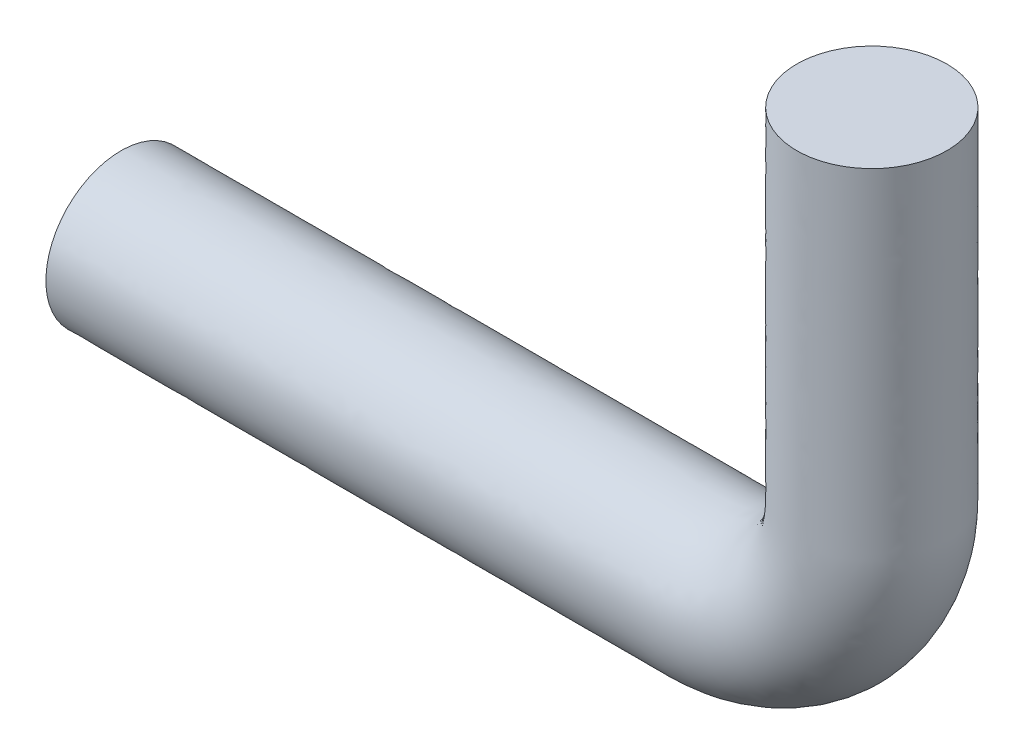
ISO-10303-21;
HEADER;
FILE_DESCRIPTION(('STEP AP214'),'2;1');
FILE_NAME('part.step','',(''),(''),'','','');
FILE_SCHEMA(('AUTOMOTIVE_DESIGN { 1 0 10303 214 1 1 1 1 }'));
ENDSEC;
DATA;
#1=APPLICATION_CONTEXT('core data for automotive mechanical design processes');
#2=APPLICATION_PROTOCOL_DEFINITION('international standard','automotive_design',2000,#1);
#3=PRODUCT_CONTEXT('',#1,'mechanical');
#4=PRODUCT('Part','Part','',(#3));
#5=PRODUCT_RELATED_PRODUCT_CATEGORY('part','',(#4));
#6=PRODUCT_DEFINITION_FORMATION('','',#4);
#7=PRODUCT_DEFINITION_CONTEXT('part definition',#1,'design');
#8=PRODUCT_DEFINITION('design','',#6,#7);
#9=PRODUCT_DEFINITION_SHAPE('','',#8);
#10=(LENGTH_UNIT() NAMED_UNIT(*) SI_UNIT(.MILLI.,.METRE.));
#11=(NAMED_UNIT(*) PLANE_ANGLE_UNIT() SI_UNIT($,.RADIAN.));
#12=(NAMED_UNIT(*) SI_UNIT($,.STERADIAN.) SOLID_ANGLE_UNIT());
#13=UNCERTAINTY_MEASURE_WITH_UNIT(LENGTH_MEASURE(1.E-05),#10,'distance_accuracy_value','');
#14=(GEOMETRIC_REPRESENTATION_CONTEXT(3) GLOBAL_UNCERTAINTY_ASSIGNED_CONTEXT((#13)) GLOBAL_UNIT_ASSIGNED_CONTEXT((#10,
#11,#12)) REPRESENTATION_CONTEXT('',''));
#15=CARTESIAN_POINT('',(0.,0.,0.));
#16=DIRECTION('',(0.,0.,1.));
#17=DIRECTION('',(1.,0.,0.));
#18=AXIS2_PLACEMENT_3D('',#15,#16,#17);
#19=CARTESIAN_POINT('',(38.,6.5,0.));
#20=DIRECTION('',(1.,0.,0.));
#21=DIRECTION('',(0.,0.,-1.));
#22=AXIS2_PLACEMENT_3D('',#19,#20,#21);
#23=PLANE('',#22);
#24=CARTESIAN_POINT('',(38.,0.,-1.));
#25=CARTESIAN_POINT('',(38.,0.0561777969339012,-0.999996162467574));
#26=CARTESIAN_POINT('',(38.,0.112414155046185,-0.995243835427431));
#27=CARTESIAN_POINT('',(38.,0.195516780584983,-0.981105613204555));
#28=CARTESIAN_POINT('',(38.,0.223031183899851,-0.975216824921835));
#29=CARTESIAN_POINT('',(38.,0.277493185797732,-0.961139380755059));
#30=CARTESIAN_POINT('',(38.,0.304440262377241,-0.952948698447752));
#31=CARTESIAN_POINT('',(38.,0.384033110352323,-0.925025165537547));
#32=CARTESIAN_POINT('',(38.,0.435539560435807,-0.901922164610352));
#33=CARTESIAN_POINT('',(38.,0.533916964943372,-0.847407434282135));
#34=CARTESIAN_POINT('',(38.,0.580787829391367,-0.815995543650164));
#35=CARTESIAN_POINT('',(38.,0.668596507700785,-0.745746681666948));
#36=CARTESIAN_POINT('',(38.,0.709534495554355,-0.706909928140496));
#37=CARTESIAN_POINT('',(38.,0.784308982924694,-0.62291399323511));
#38=CARTESIAN_POINT('',(38.,0.818145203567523,-0.577754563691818));
#39=CARTESIAN_POINT('',(38.,0.87775555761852,-0.482396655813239));
#40=CARTESIAN_POINT('',(38.,0.903529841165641,-0.432198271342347));
#41=CARTESIAN_POINT('',(38.,0.946284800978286,-0.328187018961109));
#42=CARTESIAN_POINT('',(38.,0.963265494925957,-0.274374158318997));
#43=CARTESIAN_POINT('',(38.,0.987951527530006,-0.164661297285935));
#44=CARTESIAN_POINT('',(38.,0.99565684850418,-0.108761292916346));
#45=CARTESIAN_POINT('',(38.,1.00157329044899,0.0035388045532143));
#46=CARTESIAN_POINT('',(38.,0.99978442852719,0.0599388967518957));
#47=CARTESIAN_POINT('',(38.,0.986763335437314,0.17163826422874));
#48=CARTESIAN_POINT('',(38.,0.975531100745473,0.22693753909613));
#49=CARTESIAN_POINT('',(38.,0.943942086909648,0.334865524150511));
#50=CARTESIAN_POINT('',(38.,0.923585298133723,0.387494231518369));
#51=CARTESIAN_POINT('',(38.,0.874325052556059,0.488587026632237));
#52=CARTESIAN_POINT('',(38.,0.845421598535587,0.537051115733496));
#53=CARTESIAN_POINT('',(38.,0.779888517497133,0.628438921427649));
#54=CARTESIAN_POINT('',(38.,0.74325889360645,0.671362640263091));
#55=CARTESIAN_POINT('',(38.,0.663313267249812,0.750451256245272));
#56=CARTESIAN_POINT('',(38.,0.619997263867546,0.786616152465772));
#57=CARTESIAN_POINT('',(38.,0.527908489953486,0.851160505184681));
#58=CARTESIAN_POINT('',(38.,0.479135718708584,0.879539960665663));
#59=CARTESIAN_POINT('',(38.,0.377517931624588,0.927707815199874));
#60=CARTESIAN_POINT('',(38.,0.32467291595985,0.94749621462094));
#61=CARTESIAN_POINT('',(38.,0.216410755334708,0.977920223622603));
#62=CARTESIAN_POINT('',(38.,0.160993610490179,0.988555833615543));
#63=CARTESIAN_POINT('',(38.,0.04916031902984,1.00037235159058));
#64=CARTESIAN_POINT('',(38.,-0.00725582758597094,1.00155325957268));
#65=CARTESIAN_POINT('',(38.,-0.11948563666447,0.9944268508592));
#66=CARTESIAN_POINT('',(38.,-0.175299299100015,0.986119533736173));
#67=CARTESIAN_POINT('',(38.,-0.284739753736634,0.960252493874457));
#68=CARTESIAN_POINT('',(38.,-0.338366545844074,0.942692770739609));
#69=CARTESIAN_POINT('',(38.,-0.4419109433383,0.898819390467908));
#70=CARTESIAN_POINT('',(38.,-0.491828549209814,0.872505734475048));
#71=CARTESIAN_POINT('',(38.,-0.586537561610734,0.811871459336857));
#72=CARTESIAN_POINT('',(38.,-0.631328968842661,0.777550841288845));
#73=CARTESIAN_POINT('',(38.,-0.71451411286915,0.701876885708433));
#74=CARTESIAN_POINT('',(38.,-0.752907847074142,0.66052354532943));
#75=CARTESIAN_POINT('',(38.,-0.822207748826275,0.571958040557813));
#76=CARTESIAN_POINT('',(38.,-0.853113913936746,0.524745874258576));
#77=CARTESIAN_POINT('',(38.,-0.906561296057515,0.425802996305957));
#78=CARTESIAN_POINT('',(38.,-0.929102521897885,0.37407228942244));
#79=CARTESIAN_POINT('',(38.,-0.965180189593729,0.267560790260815));
#80=CARTESIAN_POINT('',(38.,-0.978716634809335,0.212779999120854));
#81=CARTESIAN_POINT('',(38.,-0.996400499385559,0.101723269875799));
#82=CARTESIAN_POINT('',(38.,-1.00054790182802,0.0454473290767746));
#83=CARTESIAN_POINT('',(38.,-0.999335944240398,-0.0670019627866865));
#84=CARTESIAN_POINT('',(38.,-0.993976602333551,-0.12317531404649));
#85=CARTESIAN_POINT('',(38.,-0.973903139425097,-0.233825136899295));
#86=CARTESIAN_POINT('',(38.,-0.959188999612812,-0.288301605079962));
#87=CARTESIAN_POINT('',(38.,-0.920823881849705,-0.394011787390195));
#88=CARTESIAN_POINT('',(38.,-0.897172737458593,-0.445245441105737));
#89=CARTESIAN_POINT('',(38.,-0.841603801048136,-0.543013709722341));
#90=CARTESIAN_POINT('',(38.,-0.809686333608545,-0.589548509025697));
#91=CARTESIAN_POINT('',(38.,-0.738498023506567,-0.67659729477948));
#92=CARTESIAN_POINT('',(38.,-0.699226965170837,-0.717111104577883));
#93=CARTESIAN_POINT('',(38.,-0.614415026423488,-0.790981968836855));
#94=CARTESIAN_POINT('',(38.,-0.568874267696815,-0.824339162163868));
#95=CARTESIAN_POINT('',(38.,-0.496874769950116,-0.868280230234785));
#96=CARTESIAN_POINT('',(38.,-0.472234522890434,-0.881921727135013));
#97=CARTESIAN_POINT('',(38.,-0.421917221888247,-0.90707035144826));
#98=CARTESIAN_POINT('',(38.,-0.396241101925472,-0.918579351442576));
#99=CARTESIAN_POINT('',(38.,-0.317928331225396,-0.949773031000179));
#100=CARTESIAN_POINT('',(38.,-0.263926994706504,-0.96617328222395));
#101=CARTESIAN_POINT('',(38.,-0.17466073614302,-0.985256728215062));
#102=CARTESIAN_POINT('',(38.,-0.13996577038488,-0.990777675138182));
#103=CARTESIAN_POINT('',(38.,-0.0701881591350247,-0.998150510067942));
#104=CARTESIAN_POINT('',(38.,-0.0351055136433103,-1.00000239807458));
#105=CARTESIAN_POINT('',(38.,0.,-1.));
#106=B_SPLINE_CURVE_WITH_KNOTS('',3,(#24,#25,#26,#27,#28,#29,#30,#31,#32,#33,#34,#35,#36,#37,
#38,#39,#40,#41,#42,#43,#44,#45,#46,#47,#48,#49,#50,#51,#52,#53,#54,#55,#56,#57,#58,#59,#60,#61,
#62,#63,#64,#65,#66,#67,#68,#69,#70,#71,#72,#73,#74,#75,#76,#77,#78,#79,#80,#81,#82,#83,#84,#85,
#86,#87,#88,#89,#90,#91,#92,#93,#94,#95,#96,#97,#98,#99,#100,#101,#102,#103,#104,#105),
.UNSPECIFIED.,.T.,.F.,(4,2,2,2,2,2,2,2,2,2,2,2,2,2,2,2,2,2,2,2,2,2,2,2,2,2,2,2,2,2,2,2,2,2,2,2,
2,2,2,2,4),(0.,0.168383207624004,0.252714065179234,0.337119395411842,0.505602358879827,
0.674088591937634,0.842569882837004,1.01105778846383,1.1795425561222,1.34802698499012,
1.51651173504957,1.6849961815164,1.85348069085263,2.02196537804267,2.19045001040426,
2.35893457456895,2.52741916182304,2.69590377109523,2.86438837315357,3.03287296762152,
3.2013575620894,3.36984216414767,3.53832677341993,3.70681136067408,3.87529592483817,
4.04378055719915,4.2122652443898,4.38074975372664,4.54923420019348,4.71771895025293,
4.88620337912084,5.0546881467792,5.22317605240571,5.39165734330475,5.56014357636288,
5.72862653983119,5.81303187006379,5.89736272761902,6.06574593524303,6.17096862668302,
6.27619131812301),.UNSPECIFIED.);
#107=CARTESIAN_POINT('',(38.,0.,-1.));
#108=VERTEX_POINT('',#107);
#109=EDGE_CURVE('E19',#108,#108,#106,.T.);
#110=ORIENTED_EDGE('',*,*,#109,.F.);
#111=EDGE_LOOP('',(#110));
#112=FACE_BOUND('',#111,.T.);
#113=ADVANCED_FACE('F15',(#112),#23,.F.);
#114=CARTESIAN_POINT('',(48.,6.5,0.));
#115=DIRECTION('',(0.,1.,0.));
#116=DIRECTION('',(0.,0.,1.));
#117=AXIS2_PLACEMENT_3D('',#114,#115,#116);
#118=PLANE('',#117);
#119=CARTESIAN_POINT('',(48.,6.5,-1.));
#120=CARTESIAN_POINT('',(48.0561777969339,6.5,-0.999996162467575));
#121=CARTESIAN_POINT('',(48.1124141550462,6.5,-0.995243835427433));
#122=CARTESIAN_POINT('',(48.195516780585,6.5,-0.981105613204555));
#123=CARTESIAN_POINT('',(48.2230311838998,6.5,-0.975216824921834));
#124=CARTESIAN_POINT('',(48.2774931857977,6.5,-0.961139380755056));
#125=CARTESIAN_POINT('',(48.3044402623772,6.5,-0.952948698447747));
#126=CARTESIAN_POINT('',(48.3840331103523,6.5,-0.925025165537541));
#127=CARTESIAN_POINT('',(48.4355395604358,6.5,-0.901922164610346));
#128=CARTESIAN_POINT('',(48.5339169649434,6.5,-0.847407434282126));
#129=CARTESIAN_POINT('',(48.5807878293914,6.5,-0.815995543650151));
#130=CARTESIAN_POINT('',(48.6685965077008,6.5,-0.745746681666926));
#131=CARTESIAN_POINT('',(48.7095344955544,6.5,-0.706909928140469));
#132=CARTESIAN_POINT('',(48.7843089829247,6.5,-0.622913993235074));
#133=CARTESIAN_POINT('',(48.8181452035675,6.5,-0.577754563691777));
#134=CARTESIAN_POINT('',(48.8777555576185,6.5,-0.482396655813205));
#135=CARTESIAN_POINT('',(48.9035298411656,6.5,-0.432198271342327));
#136=CARTESIAN_POINT('',(48.9462848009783,6.5,-0.328187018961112));
#137=CARTESIAN_POINT('',(48.9632654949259,6.5,-0.274374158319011));
#138=CARTESIAN_POINT('',(48.98795152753,6.5,-0.164661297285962));
#139=CARTESIAN_POINT('',(48.9956568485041,6.5,-0.108761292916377));
#140=CARTESIAN_POINT('',(49.001573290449,6.5,0.00353880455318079));
#141=CARTESIAN_POINT('',(48.9997844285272,6.5,0.0599388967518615));
#142=CARTESIAN_POINT('',(48.9867633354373,6.5,0.17163826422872));
#143=CARTESIAN_POINT('',(48.9755311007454,6.5,0.226937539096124));
#144=CARTESIAN_POINT('',(48.9439420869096,6.5,0.334865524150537));
#145=CARTESIAN_POINT('',(48.9235852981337,6.5,0.387494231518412));
#146=CARTESIAN_POINT('',(48.874325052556,6.5,0.488587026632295));
#147=CARTESIAN_POINT('',(48.8454215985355,6.5,0.537051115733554));
#148=CARTESIAN_POINT('',(48.7798885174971,6.5,0.628438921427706));
#149=CARTESIAN_POINT('',(48.7432588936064,6.5,0.671362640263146));
#150=CARTESIAN_POINT('',(48.6633132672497,6.5,0.750451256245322));
#151=CARTESIAN_POINT('',(48.6199972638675,6.5,0.786616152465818));
#152=CARTESIAN_POINT('',(48.5279084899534,6.5,0.851160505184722));
#153=CARTESIAN_POINT('',(48.4791357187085,6.5,0.879539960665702));
#154=CARTESIAN_POINT('',(48.3775179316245,6.5,0.927707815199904));
#155=CARTESIAN_POINT('',(48.3246729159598,6.5,0.947496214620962));
#156=CARTESIAN_POINT('',(48.2164107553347,6.5,0.977920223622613));
#157=CARTESIAN_POINT('',(48.1609936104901,6.5,0.988555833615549));
#158=CARTESIAN_POINT('',(48.0491603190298,6.5,1.00037235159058));
#159=CARTESIAN_POINT('',(47.992744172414,6.5,1.00155325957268));
#160=CARTESIAN_POINT('',(47.8805143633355,6.5,0.9944268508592));
#161=CARTESIAN_POINT('',(47.8247007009,6.5,0.986119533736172));
#162=CARTESIAN_POINT('',(47.7152602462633,6.5,0.960252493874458));
#163=CARTESIAN_POINT('',(47.6616334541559,6.5,0.942692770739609));
#164=CARTESIAN_POINT('',(47.5580890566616,6.5,0.898819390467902));
#165=CARTESIAN_POINT('',(47.5081714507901,6.5,0.872505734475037));
#166=CARTESIAN_POINT('',(47.4134624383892,6.5,0.811871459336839));
#167=CARTESIAN_POINT('',(47.3686710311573,6.5,0.777550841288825));
#168=CARTESIAN_POINT('',(47.2854858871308,6.5,0.701876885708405));
#169=CARTESIAN_POINT('',(47.2470921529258,6.5,0.660523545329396));
#170=CARTESIAN_POINT('',(47.1777922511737,6.5,0.571958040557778));
#171=CARTESIAN_POINT('',(47.1468860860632,6.5,0.524745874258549));
#172=CARTESIAN_POINT('',(47.0934387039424,6.5,0.425802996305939));
#173=CARTESIAN_POINT('',(47.0708974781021,6.5,0.374072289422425));
#174=CARTESIAN_POINT('',(47.0348198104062,6.5,0.267560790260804));
#175=CARTESIAN_POINT('',(47.0212833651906,6.5,0.212779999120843));
#176=CARTESIAN_POINT('',(47.0035995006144,6.5,0.10172326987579));
#177=CARTESIAN_POINT('',(46.999452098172,6.5,0.0454473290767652));
#178=CARTESIAN_POINT('',(47.0006640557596,6.5,-0.0670019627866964));
#179=CARTESIAN_POINT('',(47.0060233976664,6.5,-0.123175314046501));
#180=CARTESIAN_POINT('',(47.0260968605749,6.5,-0.233825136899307));
#181=CARTESIAN_POINT('',(47.0408110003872,6.5,-0.288301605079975));
#182=CARTESIAN_POINT('',(47.0791761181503,6.5,-0.394011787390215));
#183=CARTESIAN_POINT('',(47.1028272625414,6.5,-0.445245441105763));
#184=CARTESIAN_POINT('',(47.1583961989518,6.5,-0.543013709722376));
#185=CARTESIAN_POINT('',(47.1903136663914,6.5,-0.589548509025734));
#186=CARTESIAN_POINT('',(47.2615019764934,6.5,-0.676597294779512));
#187=CARTESIAN_POINT('',(47.3007730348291,6.5,-0.71711110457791));
#188=CARTESIAN_POINT('',(47.3855849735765,6.5,-0.790981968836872));
#189=CARTESIAN_POINT('',(47.4311257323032,6.5,-0.824339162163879));
#190=CARTESIAN_POINT('',(47.5031252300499,6.5,-0.868280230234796));
#191=CARTESIAN_POINT('',(47.5277654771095,6.5,-0.881921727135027));
#192=CARTESIAN_POINT('',(47.5780827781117,6.5,-0.907070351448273));
#193=CARTESIAN_POINT('',(47.6037588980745,6.5,-0.918579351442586));
#194=CARTESIAN_POINT('',(47.6820716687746,6.5,-0.949773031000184));
#195=CARTESIAN_POINT('',(47.7360730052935,6.5,-0.966173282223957));
#196=CARTESIAN_POINT('',(47.825339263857,6.5,-0.985256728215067));
#197=CARTESIAN_POINT('',(47.8600342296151,6.5,-0.990777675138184));
#198=CARTESIAN_POINT('',(47.929811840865,6.5,-0.998150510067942));
#199=CARTESIAN_POINT('',(47.9648944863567,6.5,-1.00000239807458));
#200=CARTESIAN_POINT('',(48.,6.5,-1.));
#201=B_SPLINE_CURVE_WITH_KNOTS('',3,(#119,#120,#121,#122,#123,#124,#125,#126,#127,#128,#129,
#130,#131,#132,#133,#134,#135,#136,#137,#138,#139,#140,#141,#142,#143,#144,#145,#146,#147,#148,
#149,#150,#151,#152,#153,#154,#155,#156,#157,#158,#159,#160,#161,#162,#163,#164,#165,#166,#167,
#168,#169,#170,#171,#172,#173,#174,#175,#176,#177,#178,#179,#180,#181,#182,#183,#184,#185,#186,
#187,#188,#189,#190,#191,#192,#193,#194,#195,#196,#197,#198,#199,#200),.UNSPECIFIED.,.T.,.F.,(4,
2,2,2,2,2,2,2,2,2,2,2,2,2,2,2,2,2,2,2,2,2,2,2,2,2,2,2,2,2,2,2,2,2,2,2,2,2,2,2,4),(0.,
0.16838320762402,0.25271406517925,0.337119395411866,0.505602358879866,0.674088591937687,
0.84256988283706,1.0110577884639,1.17954255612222,1.3480269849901,1.51651173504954,
1.68499618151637,1.85348069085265,2.02196537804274,2.19045001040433,2.35893457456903,
2.52741916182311,2.6959037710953,2.86438837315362,3.03287296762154,3.20135756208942,
3.36984216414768,3.53832677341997,3.70681136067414,3.87529592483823,4.04378055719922,
4.21226524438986,4.38074975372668,4.54923420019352,4.71771895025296,4.88620337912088,
5.05468814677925,5.22317605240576,5.39165734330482,5.56014357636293,5.72862653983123,
5.81303187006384,5.89736272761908,6.06574593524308,6.17096862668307,6.27619131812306),.UNSPECIFIED.);
#202=CARTESIAN_POINT('',(48.,6.5,-1.));
#203=VERTEX_POINT('',#202);
#204=EDGE_CURVE('E10',#203,#203,#201,.T.);
#205=ORIENTED_EDGE('',*,*,#204,.F.);
#206=EDGE_LOOP('',(#205));
#207=FACE_BOUND('',#206,.T.);
#208=ADVANCED_FACE('F35',(#207),#118,.T.);
#209=CARTESIAN_POINT('',(48.,6.5,-1.));
#210=CARTESIAN_POINT('',(48.,5.,-1.));
#211=CARTESIAN_POINT('',(48.,3.5,-1.));
#212=CARTESIAN_POINT('',(48.,2.,-1.));
#213=CARTESIAN_POINT('',(48.,1.4764012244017,-1.));
#214=CARTESIAN_POINT('',(47.5666277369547,0.433372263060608,-1.));
#215=CARTESIAN_POINT('',(46.5235987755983,0.,-1.));
#216=CARTESIAN_POINT('',(46.,0.,-1.));
#217=CARTESIAN_POINT('',(31.3333333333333,0.,-1.));
#218=CARTESIAN_POINT('',(16.6666666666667,0.,-1.));
#219=CARTESIAN_POINT('',(2.,0.,-1.));
#220=CARTESIAN_POINT('',(1.4764012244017,0.,-1.));
#221=CARTESIAN_POINT('',(0.433372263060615,0.43337226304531,-1.));
#222=CARTESIAN_POINT('',(0.,1.4764012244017,-1.));
#223=CARTESIAN_POINT('',(0.,2.,-1.));
#224=CARTESIAN_POINT('',(0.,3.5,-1.));
#225=CARTESIAN_POINT('',(0.,5.,-1.));
#226=CARTESIAN_POINT('',(0.,6.5,-1.));
#227=CARTESIAN_POINT('',(48.3535533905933,6.5,-1.));
#228=CARTESIAN_POINT('',(48.3535533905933,5.,-1.));
#229=CARTESIAN_POINT('',(48.3535533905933,3.5,-1.));
#230=CARTESIAN_POINT('',(48.3535533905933,2.,-1.));
#231=CARTESIAN_POINT('',(48.3535533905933,1.40587430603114,-1.));
#232=CARTESIAN_POINT('',(47.8371035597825,0.162896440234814,-1.));
#233=CARTESIAN_POINT('',(46.5941256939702,-0.353553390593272,-1.));
#234=CARTESIAN_POINT('',(46.,-0.35355339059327,-1.));
#235=CARTESIAN_POINT('',(31.3333333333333,-0.35355339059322,-1.));
#236=CARTESIAN_POINT('',(16.6666666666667,-0.35355339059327,-1.));
#237=CARTESIAN_POINT('',(2.,-0.35355339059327,-1.));
#238=CARTESIAN_POINT('',(1.40587430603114,-0.35355339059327,-1.));
#239=CARTESIAN_POINT('',(0.162896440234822,0.162896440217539,-1.));
#240=CARTESIAN_POINT('',(-0.35355339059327,1.4058743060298,-1.));
#241=CARTESIAN_POINT('',(-0.35355339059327,2.,-1.));
#242=CARTESIAN_POINT('',(-0.353553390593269,3.5,-1.));
#243=CARTESIAN_POINT('',(-0.353553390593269,5.,-1.));
#244=CARTESIAN_POINT('',(-0.35355339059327,6.5,-1.));
#245=CARTESIAN_POINT('',(48.8232233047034,6.5,-0.823223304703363));
#246=CARTESIAN_POINT('',(48.8232233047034,5.,-0.823223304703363));
#247=CARTESIAN_POINT('',(48.8232233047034,3.5,-0.823223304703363));
#248=CARTESIAN_POINT('',(48.8232233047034,2.,-0.823223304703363));
#249=CARTESIAN_POINT('',(48.8232233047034,1.31218443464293,-0.823223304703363));
#250=CARTESIAN_POINT('',(48.1964109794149,-0.196410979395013,-0.823223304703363));
#251=CARTESIAN_POINT('',(46.6878155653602,-0.823223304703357,-0.823223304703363));
#252=CARTESIAN_POINT('',(46.,-0.823223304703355,-0.823223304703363));
#253=CARTESIAN_POINT('',(31.3333333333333,-0.823223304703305,-0.823223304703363));
#254=CARTESIAN_POINT('',(16.6666666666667,-0.823223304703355,-0.823223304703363));
#255=CARTESIAN_POINT('',(2.,-0.823223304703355,-0.823223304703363));
#256=CARTESIAN_POINT('',(1.31218443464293,-0.823223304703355,-0.823223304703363));
#257=CARTESIAN_POINT('',(-0.196410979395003,-0.196410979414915,-0.823223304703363));
#258=CARTESIAN_POINT('',(-0.823223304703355,1.3121844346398,-0.823223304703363));
#259=CARTESIAN_POINT('',(-0.823223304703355,2.,-0.823223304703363));
#260=CARTESIAN_POINT('',(-0.823223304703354,3.5,-0.823223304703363));
#261=CARTESIAN_POINT('',(-0.823223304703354,5.,-0.823223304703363));
#262=CARTESIAN_POINT('',(-0.823223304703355,6.5,-0.823223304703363));
#263=CARTESIAN_POINT('',(49.,6.5,-0.353553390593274));
#264=CARTESIAN_POINT('',(49.,5.,-0.353553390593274));
#265=CARTESIAN_POINT('',(49.,3.5,-0.353553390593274));
#266=CARTESIAN_POINT('',(49.,2.,-0.353553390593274));
#267=CARTESIAN_POINT('',(49.,1.27692097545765,-0.353553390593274));
#268=CARTESIAN_POINT('',(48.3316488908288,-0.331648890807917,-0.353553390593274));
#269=CARTESIAN_POINT('',(46.7230790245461,-1.,-0.353553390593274));
#270=CARTESIAN_POINT('',(46.,-0.999999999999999,-0.353553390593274));
#271=CARTESIAN_POINT('',(31.3333333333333,-0.999999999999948,-0.353553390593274));
#272=CARTESIAN_POINT('',(16.6666666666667,-0.999999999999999,-0.353553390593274));
#273=CARTESIAN_POINT('',(2.,-0.999999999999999,-0.353553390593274));
#274=CARTESIAN_POINT('',(1.27692097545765,-0.999999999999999,-0.353553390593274));
#275=CARTESIAN_POINT('',(-0.331648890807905,-0.331648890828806,-0.353553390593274));
#276=CARTESIAN_POINT('',(-1.,1.27692097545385,-0.353553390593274));
#277=CARTESIAN_POINT('',(-0.999999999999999,2.,-0.353553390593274));
#278=CARTESIAN_POINT('',(-0.999999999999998,3.5,-0.353553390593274));
#279=CARTESIAN_POINT('',(-0.999999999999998,5.,-0.353553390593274));
#280=CARTESIAN_POINT('',(-0.999999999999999,6.5,-0.353553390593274));
#281=CARTESIAN_POINT('',(49.,6.5,0.353553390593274));
#282=CARTESIAN_POINT('',(49.,5.,0.353553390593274));
#283=CARTESIAN_POINT('',(49.,3.5,0.353553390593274));
#284=CARTESIAN_POINT('',(49.,2.,0.353553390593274));
#285=CARTESIAN_POINT('',(49.,1.27692097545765,0.353553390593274));
#286=CARTESIAN_POINT('',(48.3316488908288,-0.331648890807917,0.353553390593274));
#287=CARTESIAN_POINT('',(46.7230790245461,-1.,0.353553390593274));
#288=CARTESIAN_POINT('',(46.,-0.999999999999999,0.353553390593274));
#289=CARTESIAN_POINT('',(31.3333333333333,-0.999999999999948,0.353553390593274));
#290=CARTESIAN_POINT('',(16.6666666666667,-0.999999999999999,0.353553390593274));
#291=CARTESIAN_POINT('',(2.,-0.999999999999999,0.353553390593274));
#292=CARTESIAN_POINT('',(1.27692097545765,-0.999999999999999,0.353553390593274));
#293=CARTESIAN_POINT('',(-0.331648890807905,-0.331648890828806,0.353553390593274));
#294=CARTESIAN_POINT('',(-1.,1.27692097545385,0.353553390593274));
#295=CARTESIAN_POINT('',(-0.999999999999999,2.,0.353553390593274));
#296=CARTESIAN_POINT('',(-0.999999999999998,3.5,0.353553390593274));
#297=CARTESIAN_POINT('',(-0.999999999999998,5.,0.353553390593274));
#298=CARTESIAN_POINT('',(-0.999999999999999,6.5,0.353553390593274));
#299=CARTESIAN_POINT('',(48.8232233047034,6.5,0.823223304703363));
#300=CARTESIAN_POINT('',(48.8232233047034,5.,0.823223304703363));
#301=CARTESIAN_POINT('',(48.8232233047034,3.5,0.823223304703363));
#302=CARTESIAN_POINT('',(48.8232233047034,2.,0.823223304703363));
#303=CARTESIAN_POINT('',(48.8232233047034,1.31218443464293,0.823223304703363));
#304=CARTESIAN_POINT('',(48.1964109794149,-0.196410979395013,0.823223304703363));
#305=CARTESIAN_POINT('',(46.6878155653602,-0.823223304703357,0.823223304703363));
#306=CARTESIAN_POINT('',(46.,-0.823223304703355,0.823223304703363));
#307=CARTESIAN_POINT('',(31.3333333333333,-0.823223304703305,0.823223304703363));
#308=CARTESIAN_POINT('',(16.6666666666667,-0.823223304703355,0.823223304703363));
#309=CARTESIAN_POINT('',(2.,-0.823223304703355,0.823223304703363));
#310=CARTESIAN_POINT('',(1.31218443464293,-0.823223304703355,0.823223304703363));
#311=CARTESIAN_POINT('',(-0.196410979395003,-0.196410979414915,0.823223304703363));
#312=CARTESIAN_POINT('',(-0.823223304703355,1.3121844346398,0.823223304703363));
#313=CARTESIAN_POINT('',(-0.823223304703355,2.,0.823223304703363));
#314=CARTESIAN_POINT('',(-0.823223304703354,3.5,0.823223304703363));
#315=CARTESIAN_POINT('',(-0.823223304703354,5.,0.823223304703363));
#316=CARTESIAN_POINT('',(-0.823223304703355,6.5,0.823223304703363));
#317=CARTESIAN_POINT('',(48.3535533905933,6.5,1.));
#318=CARTESIAN_POINT('',(48.3535533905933,5.,1.));
#319=CARTESIAN_POINT('',(48.3535533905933,3.5,1.));
#320=CARTESIAN_POINT('',(48.3535533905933,2.,1.));
#321=CARTESIAN_POINT('',(48.3535533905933,1.40587430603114,1.));
#322=CARTESIAN_POINT('',(47.8371035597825,0.162896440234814,1.));
#323=CARTESIAN_POINT('',(46.5941256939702,-0.353553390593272,1.));
#324=CARTESIAN_POINT('',(46.,-0.35355339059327,1.));
#325=CARTESIAN_POINT('',(31.3333333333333,-0.35355339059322,1.));
#326=CARTESIAN_POINT('',(16.6666666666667,-0.35355339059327,1.));
#327=CARTESIAN_POINT('',(2.,-0.35355339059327,1.));
#328=CARTESIAN_POINT('',(1.40587430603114,-0.35355339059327,1.));
#329=CARTESIAN_POINT('',(0.162896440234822,0.162896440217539,1.));
#330=CARTESIAN_POINT('',(-0.35355339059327,1.4058743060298,1.));
#331=CARTESIAN_POINT('',(-0.35355339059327,2.,1.));
#332=CARTESIAN_POINT('',(-0.353553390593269,3.5,1.));
#333=CARTESIAN_POINT('',(-0.353553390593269,5.,1.));
#334=CARTESIAN_POINT('',(-0.35355339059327,6.5,1.));
#335=CARTESIAN_POINT('',(47.6464466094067,6.5,1.));
#336=CARTESIAN_POINT('',(47.6464466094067,5.,1.));
#337=CARTESIAN_POINT('',(47.6464466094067,3.5,1.));
#338=CARTESIAN_POINT('',(47.6464466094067,2.,1.));
#339=CARTESIAN_POINT('',(47.6464466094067,1.54692814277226,1.));
#340=CARTESIAN_POINT('',(47.2961519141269,0.703848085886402,1.));
#341=CARTESIAN_POINT('',(46.4530718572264,0.353553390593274,1.));
#342=CARTESIAN_POINT('',(46.,0.353553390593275,1.));
#343=CARTESIAN_POINT('',(31.3333333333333,0.353553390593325,1.));
#344=CARTESIAN_POINT('',(16.6666666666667,0.353553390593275,1.));
#345=CARTESIAN_POINT('',(2.,0.353553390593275,1.));
#346=CARTESIAN_POINT('',(1.54692814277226,0.353553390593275,1.));
#347=CARTESIAN_POINT('',(0.703848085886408,0.703848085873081,1.));
#348=CARTESIAN_POINT('',(0.353553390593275,1.54692814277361,1.));
#349=CARTESIAN_POINT('',(0.353553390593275,2.,1.));
#350=CARTESIAN_POINT('',(0.353553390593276,3.5,1.));
#351=CARTESIAN_POINT('',(0.353553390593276,5.,1.));
#352=CARTESIAN_POINT('',(0.353553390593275,6.5,1.));
#353=CARTESIAN_POINT('',(47.1767766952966,6.5,0.823223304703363));
#354=CARTESIAN_POINT('',(47.1767766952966,5.,0.823223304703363));
#355=CARTESIAN_POINT('',(47.1767766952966,3.5,0.823223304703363));
#356=CARTESIAN_POINT('',(47.1767766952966,2.,0.823223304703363));
#357=CARTESIAN_POINT('',(47.1767766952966,1.64061801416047,0.823223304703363));
#358=CARTESIAN_POINT('',(46.9368444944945,1.06315550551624,0.823223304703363));
#359=CARTESIAN_POINT('',(46.3593819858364,0.823223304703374,0.823223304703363));
#360=CARTESIAN_POINT('',(46.,0.823223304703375,0.823223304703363));
#361=CARTESIAN_POINT('',(31.3333333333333,0.823223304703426,0.823223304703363));
#362=CARTESIAN_POINT('',(16.6666666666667,0.823223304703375,0.823223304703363));
#363=CARTESIAN_POINT('',(2.,0.823223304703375,0.823223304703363));
#364=CARTESIAN_POINT('',(1.64061801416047,0.823223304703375,0.823223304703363));
#365=CARTESIAN_POINT('',(1.06315550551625,1.06315550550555,0.823223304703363));
#366=CARTESIAN_POINT('',(0.823223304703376,1.6406180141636,0.823223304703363));
#367=CARTESIAN_POINT('',(0.823223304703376,2.,0.823223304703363));
#368=CARTESIAN_POINT('',(0.823223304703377,3.5,0.823223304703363));
#369=CARTESIAN_POINT('',(0.823223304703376,5.,0.823223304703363));
#370=CARTESIAN_POINT('',(0.823223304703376,6.5,0.823223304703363));
#371=CARTESIAN_POINT('',(47.,6.5,0.353553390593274));
#372=CARTESIAN_POINT('',(47.,5.,0.353553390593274));
#373=CARTESIAN_POINT('',(47.,3.5,0.353553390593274));
#374=CARTESIAN_POINT('',(47.,2.,0.353553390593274));
#375=CARTESIAN_POINT('',(47.,1.67588147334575,0.353553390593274));
#376=CARTESIAN_POINT('',(46.8016065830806,1.19839341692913,0.353553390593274));
#377=CARTESIAN_POINT('',(46.3241185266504,1.00000000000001,0.353553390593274));
#378=CARTESIAN_POINT('',(46.,1.00000000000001,0.353553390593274));
#379=CARTESIAN_POINT('',(31.3333333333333,1.00000000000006,0.353553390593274));
#380=CARTESIAN_POINT('',(16.6666666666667,1.00000000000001,0.353553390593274));
#381=CARTESIAN_POINT('',(2.,1.00000000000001,0.353553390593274));
#382=CARTESIAN_POINT('',(1.67588147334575,1.00000000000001,0.353553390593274));
#383=CARTESIAN_POINT('',(1.19839341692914,1.19839341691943,0.353553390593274));
#384=CARTESIAN_POINT('',(1.00000000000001,1.67588147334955,0.353553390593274));
#385=CARTESIAN_POINT('',(1.00000000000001,2.,0.353553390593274));
#386=CARTESIAN_POINT('',(1.00000000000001,3.5,0.353553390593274));
#387=CARTESIAN_POINT('',(1.00000000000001,5.,0.353553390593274));
#388=CARTESIAN_POINT('',(1.00000000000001,6.5,0.353553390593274));
#389=CARTESIAN_POINT('',(47.,6.5,-0.353553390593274));
#390=CARTESIAN_POINT('',(47.,5.,-0.353553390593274));
#391=CARTESIAN_POINT('',(47.,3.5,-0.353553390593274));
#392=CARTESIAN_POINT('',(47.,2.,-0.353553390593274));
#393=CARTESIAN_POINT('',(47.,1.67588147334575,-0.353553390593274));
#394=CARTESIAN_POINT('',(46.8016065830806,1.19839341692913,-0.353553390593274));
#395=CARTESIAN_POINT('',(46.3241185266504,1.00000000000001,-0.353553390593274));
#396=CARTESIAN_POINT('',(46.,1.00000000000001,-0.353553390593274));
#397=CARTESIAN_POINT('',(31.3333333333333,1.00000000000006,-0.353553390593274));
#398=CARTESIAN_POINT('',(16.6666666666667,1.00000000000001,-0.353553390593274));
#399=CARTESIAN_POINT('',(2.,1.00000000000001,-0.353553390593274));
#400=CARTESIAN_POINT('',(1.67588147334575,1.00000000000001,-0.353553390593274));
#401=CARTESIAN_POINT('',(1.19839341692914,1.19839341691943,-0.353553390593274));
#402=CARTESIAN_POINT('',(1.00000000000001,1.67588147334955,-0.353553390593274));
#403=CARTESIAN_POINT('',(1.00000000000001,2.,-0.353553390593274));
#404=CARTESIAN_POINT('',(1.00000000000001,3.5,-0.353553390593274));
#405=CARTESIAN_POINT('',(1.00000000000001,5.,-0.353553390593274));
#406=CARTESIAN_POINT('',(1.00000000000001,6.5,-0.353553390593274));
#407=CARTESIAN_POINT('',(47.1767766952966,6.5,-0.823223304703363));
#408=CARTESIAN_POINT('',(47.1767766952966,5.,-0.823223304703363));
#409=CARTESIAN_POINT('',(47.1767766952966,3.5,-0.823223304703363));
#410=CARTESIAN_POINT('',(47.1767766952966,2.,-0.823223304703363));
#411=CARTESIAN_POINT('',(47.1767766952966,1.64061801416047,-0.823223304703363));
#412=CARTESIAN_POINT('',(46.9368444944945,1.06315550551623,-0.823223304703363));
#413=CARTESIAN_POINT('',(46.3593819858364,0.823223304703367,-0.823223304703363));
#414=CARTESIAN_POINT('',(46.,0.823223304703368,-0.823223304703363));
#415=CARTESIAN_POINT('',(31.3333333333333,0.823223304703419,-0.823223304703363));
#416=CARTESIAN_POINT('',(16.6666666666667,0.823223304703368,-0.823223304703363));
#417=CARTESIAN_POINT('',(2.,0.823223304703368,-0.823223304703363));
#418=CARTESIAN_POINT('',(1.64061801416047,0.823223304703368,-0.823223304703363));
#419=CARTESIAN_POINT('',(1.06315550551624,1.06315550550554,-0.823223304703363));
#420=CARTESIAN_POINT('',(0.823223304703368,1.6406180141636,-0.823223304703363));
#421=CARTESIAN_POINT('',(0.823223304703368,2.,-0.823223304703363));
#422=CARTESIAN_POINT('',(0.823223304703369,3.5,-0.823223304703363));
#423=CARTESIAN_POINT('',(0.823223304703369,5.,-0.823223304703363));
#424=CARTESIAN_POINT('',(0.823223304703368,6.5,-0.823223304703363));
#425=CARTESIAN_POINT('',(47.6464466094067,6.5,-1.));
#426=CARTESIAN_POINT('',(47.6464466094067,5.,-1.));
#427=CARTESIAN_POINT('',(47.6464466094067,3.5,-1.));
#428=CARTESIAN_POINT('',(47.6464466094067,2.,-1.));
#429=CARTESIAN_POINT('',(47.6464466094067,1.54692814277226,-1.));
#430=CARTESIAN_POINT('',(47.2961519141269,0.703848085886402,-1.));
#431=CARTESIAN_POINT('',(46.4530718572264,0.353553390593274,-1.));
#432=CARTESIAN_POINT('',(46.,0.353553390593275,-1.));
#433=CARTESIAN_POINT('',(31.3333333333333,0.353553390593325,-1.));
#434=CARTESIAN_POINT('',(16.6666666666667,0.353553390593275,-1.));
#435=CARTESIAN_POINT('',(2.,0.353553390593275,-1.));
#436=CARTESIAN_POINT('',(1.54692814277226,0.353553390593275,-1.));
#437=CARTESIAN_POINT('',(0.703848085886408,0.703848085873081,-1.));
#438=CARTESIAN_POINT('',(0.353553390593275,1.54692814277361,-1.));
#439=CARTESIAN_POINT('',(0.353553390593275,2.,-1.));
#440=CARTESIAN_POINT('',(0.353553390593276,3.5,-1.));
#441=CARTESIAN_POINT('',(0.353553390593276,5.,-1.));
#442=CARTESIAN_POINT('',(0.353553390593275,6.5,-1.));
#443=CARTESIAN_POINT('',(48.,6.5,-1.));
#444=CARTESIAN_POINT('',(48.,5.,-1.));
#445=CARTESIAN_POINT('',(48.,3.5,-1.));
#446=CARTESIAN_POINT('',(48.,2.,-1.));
#447=CARTESIAN_POINT('',(48.,1.4764012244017,-1.));
#448=CARTESIAN_POINT('',(47.5666277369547,0.433372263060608,-1.));
#449=CARTESIAN_POINT('',(46.5235987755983,0.,-1.));
#450=CARTESIAN_POINT('',(46.,0.,-1.));
#451=CARTESIAN_POINT('',(31.3333333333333,0.,-1.));
#452=CARTESIAN_POINT('',(16.6666666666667,0.,-1.));
#453=CARTESIAN_POINT('',(2.,0.,-1.));
#454=CARTESIAN_POINT('',(1.4764012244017,0.,-1.));
#455=CARTESIAN_POINT('',(0.433372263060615,0.43337226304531,-1.));
#456=CARTESIAN_POINT('',(0.,1.4764012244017,-1.));
#457=CARTESIAN_POINT('',(0.,2.,-1.));
#458=CARTESIAN_POINT('',(0.,3.5,-1.));
#459=CARTESIAN_POINT('',(0.,5.,-1.));
#460=CARTESIAN_POINT('',(0.,6.5,-1.));
#461=(BOUNDED_SURFACE() B_SPLINE_SURFACE(4,3,((#209,#210,#211,#212,#213,#214,#215,#216,#217,
#218,#219,#220,#221,#222,#223,#224,#225,#226),(#227,#228,#229,#230,#231,#232,#233,#234,#235,
#236,#237,#238,#239,#240,#241,#242,#243,#244),(#245,#246,#247,#248,#249,#250,#251,#252,#253,
#254,#255,#256,#257,#258,#259,#260,#261,#262),(#263,#264,#265,#266,#267,#268,#269,#270,#271,
#272,#273,#274,#275,#276,#277,#278,#279,#280),(#281,#282,#283,#284,#285,#286,#287,#288,#289,
#290,#291,#292,#293,#294,#295,#296,#297,#298),(#299,#300,#301,#302,#303,#304,#305,#306,#307,
#308,#309,#310,#311,#312,#313,#314,#315,#316),(#317,#318,#319,#320,#321,#322,#323,#324,#325,
#326,#327,#328,#329,#330,#331,#332,#333,#334),(#335,#336,#337,#338,#339,#340,#341,#342,#343,
#344,#345,#346,#347,#348,#349,#350,#351,#352),(#353,#354,#355,#356,#357,#358,#359,#360,#361,
#362,#363,#364,#365,#366,#367,#368,#369,#370),(#371,#372,#373,#374,#375,#376,#377,#378,#379,
#380,#381,#382,#383,#384,#385,#386,#387,#388),(#389,#390,#391,#392,#393,#394,#395,#396,#397,
#398,#399,#400,#401,#402,#403,#404,#405,#406),(#407,#408,#409,#410,#411,#412,#413,#414,#415,
#416,#417,#418,#419,#420,#421,#422,#423,#424),(#425,#426,#427,#428,#429,#430,#431,#432,#433,
#434,#435,#436,#437,#438,#439,#440,#441,#442),(#443,#444,#445,#446,#447,#448,#449,#450,#451,
#452,#453,#454,#455,#456,#457,#458,#459,#460)),.UNSPECIFIED.,.T.,.F.,
.F.) B_SPLINE_SURFACE_WITH_KNOTS((5,3,3,3,5),(4,3,1,3,3,1,3,4),(0.,0.25,0.5,0.75,1.),(0.,
0.0759068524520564,0.102403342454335,0.128899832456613,0.871100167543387,0.897596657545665,
0.924093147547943,1.),
.UNSPECIFIED.) GEOMETRIC_REPRESENTATION_ITEM() RATIONAL_B_SPLINE_SURFACE(((0.585786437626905,
0.585786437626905,0.585786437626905,0.585786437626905,0.585786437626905,0.585786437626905,
0.585786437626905,0.585786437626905,0.585786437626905,0.585786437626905,0.585786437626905,
0.585786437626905,0.585786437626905,0.585786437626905,0.585786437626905,0.585786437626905,
0.585786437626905,0.585786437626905),(0.585786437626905,0.585786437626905,0.585786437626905,
0.585786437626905,0.585786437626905,0.585786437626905,0.585786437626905,0.585786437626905,
0.585786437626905,0.585786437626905,0.585786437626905,0.585786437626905,0.585786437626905,
0.585786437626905,0.585786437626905,0.585786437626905,0.585786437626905,0.585786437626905),
(0.552284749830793,0.552284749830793,0.552284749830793,0.552284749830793,0.552284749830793,
0.552284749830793,0.552284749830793,0.552284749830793,0.552284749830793,0.552284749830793,
0.552284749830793,0.552284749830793,0.552284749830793,0.552284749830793,0.552284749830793,
0.552284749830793,0.552284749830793,0.552284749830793),(0.585786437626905,0.585786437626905,
0.585786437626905,0.585786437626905,0.585786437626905,0.585786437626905,0.585786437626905,
0.585786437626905,0.585786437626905,0.585786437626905,0.585786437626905,0.585786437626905,
0.585786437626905,0.585786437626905,0.585786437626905,0.585786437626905,0.585786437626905,
0.585786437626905),(0.585786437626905,0.585786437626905,0.585786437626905,0.585786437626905,
0.585786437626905,0.585786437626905,0.585786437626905,0.585786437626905,0.585786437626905,
0.585786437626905,0.585786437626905,0.585786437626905,0.585786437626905,0.585786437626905,
0.585786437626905,0.585786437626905,0.585786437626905,0.585786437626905),(0.552284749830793,
0.552284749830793,0.552284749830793,0.552284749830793,0.552284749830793,0.552284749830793,
0.552284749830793,0.552284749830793,0.552284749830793,0.552284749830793,0.552284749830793,
0.552284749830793,0.552284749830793,0.552284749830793,0.552284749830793,0.552284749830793,
0.552284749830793,0.552284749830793),(0.585786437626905,0.585786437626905,0.585786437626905,
0.585786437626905,0.585786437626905,0.585786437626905,0.585786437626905,0.585786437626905,
0.585786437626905,0.585786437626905,0.585786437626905,0.585786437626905,0.585786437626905,
0.585786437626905,0.585786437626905,0.585786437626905,0.585786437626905,0.585786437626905),
(0.585786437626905,0.585786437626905,0.585786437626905,0.585786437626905,0.585786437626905,
0.585786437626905,0.585786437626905,0.585786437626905,0.585786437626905,0.585786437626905,
0.585786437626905,0.585786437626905,0.585786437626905,0.585786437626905,0.585786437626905,
0.585786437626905,0.585786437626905,0.585786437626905),(0.552284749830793,0.552284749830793,
0.552284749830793,0.552284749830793,0.552284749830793,0.552284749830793,0.552284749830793,
0.552284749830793,0.552284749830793,0.552284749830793,0.552284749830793,0.552284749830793,
0.552284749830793,0.552284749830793,0.552284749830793,0.552284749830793,0.552284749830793,
0.552284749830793),(0.585786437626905,0.585786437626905,0.585786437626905,0.585786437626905,
0.585786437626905,0.585786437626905,0.585786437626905,0.585786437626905,0.585786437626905,
0.585786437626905,0.585786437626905,0.585786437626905,0.585786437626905,0.585786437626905,
0.585786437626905,0.585786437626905,0.585786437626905,0.585786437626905),(0.585786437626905,
0.585786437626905,0.585786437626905,0.585786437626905,0.585786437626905,0.585786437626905,
0.585786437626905,0.585786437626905,0.585786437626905,0.585786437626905,0.585786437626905,
0.585786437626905,0.585786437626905,0.585786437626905,0.585786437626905,0.585786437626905,
0.585786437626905,0.585786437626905),(0.552284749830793,0.552284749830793,0.552284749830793,
0.552284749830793,0.552284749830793,0.552284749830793,0.552284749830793,0.552284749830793,
0.552284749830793,0.552284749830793,0.552284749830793,0.552284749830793,0.552284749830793,
0.552284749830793,0.552284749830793,0.552284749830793,0.552284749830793,0.552284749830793),
(0.585786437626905,0.585786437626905,0.585786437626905,0.585786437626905,0.585786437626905,
0.585786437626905,0.585786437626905,0.585786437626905,0.585786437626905,0.585786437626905,
0.585786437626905,0.585786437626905,0.585786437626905,0.585786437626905,0.585786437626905,
0.585786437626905,0.585786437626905,0.585786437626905),(0.585786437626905,0.585786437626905,
0.585786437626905,0.585786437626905,0.585786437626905,0.585786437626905,0.585786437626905,
0.585786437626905,0.585786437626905,0.585786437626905,0.585786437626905,0.585786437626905,
0.585786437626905,0.585786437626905,0.585786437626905,0.585786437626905,0.585786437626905,0.585786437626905))) REPRESENTATION_ITEM('') SURFACE());
#462=CARTESIAN_POINT('',(48.,6.5,-1.));
#463=CARTESIAN_POINT('',(48.,6.49490833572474,-1.));
#464=CARTESIAN_POINT('',(48.,6.48981667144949,-1.));
#465=CARTESIAN_POINT('',(48.,6.47963334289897,-1.));
#466=CARTESIAN_POINT('',(48.,6.47454167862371,-1.));
#467=CARTESIAN_POINT('',(48.,6.4643583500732,-1.));
#468=CARTESIAN_POINT('',(48.,6.45926668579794,-1.));
#469=CARTESIAN_POINT('',(48.,6.44908335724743,-1.));
#470=CARTESIAN_POINT('',(48.,6.44399169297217,-1.));
#471=CARTESIAN_POINT('',(48.,6.43380836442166,-1.));
#472=CARTESIAN_POINT('',(48.,6.4287167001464,-1.));
#473=CARTESIAN_POINT('',(48.,6.41853337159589,-1.));
#474=CARTESIAN_POINT('',(48.,6.41344170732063,-1.));
#475=CARTESIAN_POINT('',(48.,6.40325837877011,-1.));
#476=CARTESIAN_POINT('',(48.,6.39816671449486,-1.));
#477=CARTESIAN_POINT('',(48.,6.38798338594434,-1.));
#478=CARTESIAN_POINT('',(48.,6.38289172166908,-1.));
#479=CARTESIAN_POINT('',(48.,6.37270839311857,-1.));
#480=CARTESIAN_POINT('',(48.,6.36761672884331,-1.));
#481=CARTESIAN_POINT('',(48.,6.3574334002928,-1.));
#482=CARTESIAN_POINT('',(48.,6.35234173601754,-1.));
#483=CARTESIAN_POINT('',(48.,6.34215840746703,-1.));
#484=CARTESIAN_POINT('',(48.,6.33706674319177,-1.));
#485=CARTESIAN_POINT('',(48.,6.32688341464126,-1.));
#486=CARTESIAN_POINT('',(48.,6.321791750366,-1.));
#487=CARTESIAN_POINT('',(48.,6.31160842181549,-1.));
#488=CARTESIAN_POINT('',(48.,6.30651675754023,-1.));
#489=CARTESIAN_POINT('',(48.,6.29633342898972,-1.));
#490=CARTESIAN_POINT('',(48.,6.29124176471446,-1.));
#491=CARTESIAN_POINT('',(48.,6.28105843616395,-1.));
#492=CARTESIAN_POINT('',(48.,6.27596677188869,-1.));
#493=CARTESIAN_POINT('',(48.,6.26578344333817,-1.));
#494=CARTESIAN_POINT('',(48.,6.26069177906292,-1.));
#495=CARTESIAN_POINT('',(48.,6.2505084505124,-1.));
#496=CARTESIAN_POINT('',(48.,6.24541678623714,-1.));
#497=CARTESIAN_POINT('',(48.,6.23523345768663,-1.));
#498=CARTESIAN_POINT('',(48.,6.23014179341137,-1.));
#499=CARTESIAN_POINT('',(48.,6.21995846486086,-1.));
#500=CARTESIAN_POINT('',(48.,6.2148668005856,-1.));
#501=CARTESIAN_POINT('',(48.,6.20468347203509,-1.));
#502=CARTESIAN_POINT('',(48.,6.19959180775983,-1.));
#503=CARTESIAN_POINT('',(48.,6.18940847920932,-1.));
#504=CARTESIAN_POINT('',(48.,6.18431681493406,-1.));
#505=CARTESIAN_POINT('',(48.,6.17413348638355,-1.));
#506=CARTESIAN_POINT('',(48.,6.16904182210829,-1.));
#507=CARTESIAN_POINT('',(48.,6.15885849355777,-1.));
#508=CARTESIAN_POINT('',(48.,6.15376682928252,-1.));
#509=CARTESIAN_POINT('',(48.,6.143583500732,-1.));
#510=CARTESIAN_POINT('',(48.,6.13849183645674,-1.));
#511=CARTESIAN_POINT('',(48.,6.12830850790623,-1.));
#512=CARTESIAN_POINT('',(48.,6.12321684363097,-1.));
#513=CARTESIAN_POINT('',(48.,6.11303351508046,-1.));
#514=CARTESIAN_POINT('',(48.,6.1079418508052,-1.));
#515=CARTESIAN_POINT('',(48.,6.09775852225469,-1.));
#516=CARTESIAN_POINT('',(48.,6.09266685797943,-1.));
#517=CARTESIAN_POINT('',(48.,6.08248352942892,-1.));
#518=CARTESIAN_POINT('',(48.,6.07739186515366,-1.));
#519=CARTESIAN_POINT('',(48.,6.06720853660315,-1.));
#520=CARTESIAN_POINT('',(48.,6.06211687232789,-1.));
#521=CARTESIAN_POINT('',(48.,6.05193354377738,-1.));
#522=CARTESIAN_POINT('',(48.,6.04684187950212,-1.));
#523=CARTESIAN_POINT('',(48.,6.03665855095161,-1.));
#524=CARTESIAN_POINT('',(48.,6.03156688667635,-1.));
#525=CARTESIAN_POINT('',(48.,6.02138355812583,-1.));
#526=CARTESIAN_POINT('',(48.,6.01629189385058,-1.));
#527=CARTESIAN_POINT('',(48.,6.00610856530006,-1.));
#528=CARTESIAN_POINT('',(48.,6.0010169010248,-1.));
#529=CARTESIAN_POINT('',(48.,5.99083357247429,-1.));
#530=CARTESIAN_POINT('',(48.,5.98574190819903,-1.));
#531=CARTESIAN_POINT('',(48.,5.97555857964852,-1.));
#532=CARTESIAN_POINT('',(48.,5.97046691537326,-1.));
#533=CARTESIAN_POINT('',(48.,5.96028358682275,-1.));
#534=CARTESIAN_POINT('',(48.,5.95519192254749,-1.));
#535=CARTESIAN_POINT('',(48.,5.94500859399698,-1.));
#536=CARTESIAN_POINT('',(48.,5.93991692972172,-1.));
#537=CARTESIAN_POINT('',(48.,5.9297336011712,-1.));
#538=CARTESIAN_POINT('',(48.,5.92464193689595,-1.));
#539=CARTESIAN_POINT('',(48.,5.91445860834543,-1.));
#540=CARTESIAN_POINT('',(48.,5.90936694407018,-1.));
#541=CARTESIAN_POINT('',(48.,5.89918361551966,-1.));
#542=CARTESIAN_POINT('',(48.,5.89409195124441,-1.));
#543=CARTESIAN_POINT('',(48.,5.88390862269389,-1.));
#544=CARTESIAN_POINT('',(48.,5.87881695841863,-1.));
#545=CARTESIAN_POINT('',(48.,5.86863362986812,-1.));
#546=CARTESIAN_POINT('',(48.,5.86354196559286,-1.));
#547=CARTESIAN_POINT('',(48.,5.85335863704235,-1.));
#548=CARTESIAN_POINT('',(48.,5.84826697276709,-1.));
#549=CARTESIAN_POINT('',(48.,5.83808364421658,-1.));
#550=CARTESIAN_POINT('',(48.,5.83299197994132,-1.));
#551=CARTESIAN_POINT('',(48.,5.82280865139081,-1.));
#552=CARTESIAN_POINT('',(48.,5.81771698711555,-1.));
#553=CARTESIAN_POINT('',(48.,5.80753365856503,-1.));
#554=CARTESIAN_POINT('',(48.,5.80244199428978,-1.));
#555=CARTESIAN_POINT('',(48.,5.79225866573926,-1.));
#556=CARTESIAN_POINT('',(48.,5.78716700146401,-1.));
#557=CARTESIAN_POINT('',(48.,5.77698367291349,-1.));
#558=CARTESIAN_POINT('',(48.,5.77189200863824,-1.));
#559=CARTESIAN_POINT('',(48.,5.76170868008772,-1.));
#560=CARTESIAN_POINT('',(48.,5.75661701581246,-1.));
#561=CARTESIAN_POINT('',(48.,5.74643368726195,-1.));
#562=CARTESIAN_POINT('',(48.,5.74134202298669,-1.));
#563=CARTESIAN_POINT('',(48.,5.73115869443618,-1.));
#564=CARTESIAN_POINT('',(48.,5.72606703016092,-1.));
#565=CARTESIAN_POINT('',(48.,5.71588370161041,-1.));
#566=CARTESIAN_POINT('',(48.,5.71079203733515,-1.));
#567=CARTESIAN_POINT('',(48.,5.70060870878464,-1.));
#568=CARTESIAN_POINT('',(48.,5.69551704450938,-1.));
#569=CARTESIAN_POINT('',(48.,5.68533371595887,-1.));
#570=CARTESIAN_POINT('',(48.,5.68024205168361,-1.));
#571=CARTESIAN_POINT('',(48.,5.67005872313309,-1.));
#572=CARTESIAN_POINT('',(48.,5.66496705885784,-1.));
#573=CARTESIAN_POINT('',(48.,5.65478373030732,-1.));
#574=CARTESIAN_POINT('',(48.,5.64969206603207,-1.));
#575=CARTESIAN_POINT('',(48.,5.63950873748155,-1.));
#576=CARTESIAN_POINT('',(48.,5.63441707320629,-1.));
#577=CARTESIAN_POINT('',(48.,5.62423374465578,-1.));
#578=CARTESIAN_POINT('',(48.,5.61914208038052,-1.));
#579=CARTESIAN_POINT('',(48.,5.60895875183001,-1.));
#580=CARTESIAN_POINT('',(48.,5.60386708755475,-1.));
#581=CARTESIAN_POINT('',(48.,5.59368375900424,-1.));
#582=CARTESIAN_POINT('',(48.,5.58859209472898,-1.));
#583=CARTESIAN_POINT('',(48.,5.57840876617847,-1.));
#584=CARTESIAN_POINT('',(48.,5.57331710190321,-1.));
#585=CARTESIAN_POINT('',(48.,5.56313377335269,-1.));
#586=CARTESIAN_POINT('',(48.,5.55804210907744,-1.));
#587=CARTESIAN_POINT('',(48.,5.54785878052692,-1.));
#588=CARTESIAN_POINT('',(48.,5.54276711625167,-1.));
#589=CARTESIAN_POINT('',(48.,5.53258378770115,-1.));
#590=CARTESIAN_POINT('',(48.,5.52749212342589,-1.));
#591=CARTESIAN_POINT('',(48.,5.51730879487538,-1.));
#592=CARTESIAN_POINT('',(48.,5.51221713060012,-1.));
#593=CARTESIAN_POINT('',(48.,5.50203380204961,-1.));
#594=CARTESIAN_POINT('',(48.,5.49694213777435,-1.));
#595=CARTESIAN_POINT('',(48.,5.48675880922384,-1.));
#596=CARTESIAN_POINT('',(48.,5.48166714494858,-1.));
#597=CARTESIAN_POINT('',(48.,5.47148381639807,-1.));
#598=CARTESIAN_POINT('',(48.,5.46639215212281,-1.));
#599=CARTESIAN_POINT('',(48.,5.4562088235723,-1.));
#600=CARTESIAN_POINT('',(48.,5.45111715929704,-1.));
#601=CARTESIAN_POINT('',(48.,5.44093383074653,-1.));
#602=CARTESIAN_POINT('',(48.,5.43584216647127,-1.));
#603=CARTESIAN_POINT('',(48.,5.42565883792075,-1.));
#604=CARTESIAN_POINT('',(48.,5.4205671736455,-1.));
#605=CARTESIAN_POINT('',(48.,5.41038384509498,-1.));
#606=CARTESIAN_POINT('',(48.,5.40529218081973,-1.));
#607=CARTESIAN_POINT('',(48.,5.39510885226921,-1.));
#608=CARTESIAN_POINT('',(48.,5.39001718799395,-1.));
#609=CARTESIAN_POINT('',(48.,5.37983385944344,-1.));
#610=CARTESIAN_POINT('',(48.,5.37474219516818,-1.));
#611=CARTESIAN_POINT('',(48.,5.36455886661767,-1.));
#612=CARTESIAN_POINT('',(48.,5.35946720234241,-1.));
#613=CARTESIAN_POINT('',(48.,5.3492838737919,-1.));
#614=CARTESIAN_POINT('',(48.,5.34419220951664,-1.));
#615=CARTESIAN_POINT('',(48.,5.33400888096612,-1.));
#616=CARTESIAN_POINT('',(48.,5.32891721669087,-1.));
#617=CARTESIAN_POINT('',(48.,5.31873388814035,-1.));
#618=CARTESIAN_POINT('',(48.,5.3136422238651,-1.));
#619=CARTESIAN_POINT('',(48.,5.30345889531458,-1.));
#620=CARTESIAN_POINT('',(48.,5.29836723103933,-1.));
#621=CARTESIAN_POINT('',(48.,5.28818390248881,-1.));
#622=CARTESIAN_POINT('',(48.,5.28309223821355,-1.));
#623=CARTESIAN_POINT('',(48.,5.27290890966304,-1.));
#624=CARTESIAN_POINT('',(48.,5.26781724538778,-1.));
#625=CARTESIAN_POINT('',(48.,5.25763391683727,-1.));
#626=CARTESIAN_POINT('',(48.,5.25254225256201,-1.));
#627=CARTESIAN_POINT('',(48.,5.2423589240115,-1.));
#628=CARTESIAN_POINT('',(48.,5.23726725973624,-1.));
#629=CARTESIAN_POINT('',(48.,5.22708393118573,-1.));
#630=CARTESIAN_POINT('',(48.,5.22199226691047,-1.));
#631=CARTESIAN_POINT('',(48.,5.21180893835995,-1.));
#632=CARTESIAN_POINT('',(48.,5.2067172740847,-1.));
#633=CARTESIAN_POINT('',(48.,5.19653394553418,-1.));
#634=CARTESIAN_POINT('',(48.,5.19144228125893,-1.));
#635=CARTESIAN_POINT('',(48.,5.18125895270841,-1.));
#636=CARTESIAN_POINT('',(48.,5.17616728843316,-1.));
#637=CARTESIAN_POINT('',(48.,5.16598395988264,-1.));
#638=CARTESIAN_POINT('',(48.,5.16089229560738,-1.));
#639=CARTESIAN_POINT('',(48.,5.15070896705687,-1.));
#640=CARTESIAN_POINT('',(48.,5.14561730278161,-1.));
#641=CARTESIAN_POINT('',(48.,5.1354339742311,-1.));
#642=CARTESIAN_POINT('',(48.,5.13034230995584,-1.));
#643=CARTESIAN_POINT('',(48.,5.12015898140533,-1.));
#644=CARTESIAN_POINT('',(48.,5.11506731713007,-1.));
#645=CARTESIAN_POINT('',(48.,5.10488398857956,-1.));
#646=CARTESIAN_POINT('',(48.,5.0997923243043,-1.));
#647=CARTESIAN_POINT('',(48.,5.08960899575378,-1.));
#648=CARTESIAN_POINT('',(48.,5.08451733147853,-1.));
#649=CARTESIAN_POINT('',(48.,5.07433400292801,-1.));
#650=CARTESIAN_POINT('',(48.,5.06924233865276,-1.));
#651=CARTESIAN_POINT('',(48.,5.05905901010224,-1.));
#652=CARTESIAN_POINT('',(48.,5.05396734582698,-1.));
#653=CARTESIAN_POINT('',(48.,5.04378401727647,-1.));
#654=CARTESIAN_POINT('',(48.,5.03869235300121,-1.));
#655=CARTESIAN_POINT('',(48.,5.0285090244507,-1.));
#656=CARTESIAN_POINT('',(48.,5.02341736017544,-1.));
#657=CARTESIAN_POINT('',(48.,5.01323403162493,-1.));
#658=CARTESIAN_POINT('',(48.,5.00814236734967,-1.));
#659=CARTESIAN_POINT('',(48.,4.99795903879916,-1.));
#660=CARTESIAN_POINT('',(48.,4.9928673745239,-1.));
#661=CARTESIAN_POINT('',(48.,4.98268404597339,-1.));
#662=CARTESIAN_POINT('',(48.,4.97759238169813,-1.));
#663=CARTESIAN_POINT('',(48.,4.96740905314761,-1.));
#664=CARTESIAN_POINT('',(48.,4.96231738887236,-1.));
#665=CARTESIAN_POINT('',(48.,4.95213406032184,-1.));
#666=CARTESIAN_POINT('',(48.,4.94704239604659,-1.));
#667=CARTESIAN_POINT('',(48.,4.93685906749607,-1.));
#668=CARTESIAN_POINT('',(48.,4.93176740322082,-1.));
#669=CARTESIAN_POINT('',(48.,4.9215840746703,-1.));
#670=CARTESIAN_POINT('',(48.,4.91649241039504,-1.));
#671=CARTESIAN_POINT('',(48.,4.90630908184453,-1.));
#672=CARTESIAN_POINT('',(48.,4.90121741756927,-1.));
#673=CARTESIAN_POINT('',(48.,4.89103408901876,-1.));
#674=CARTESIAN_POINT('',(48.,4.8859424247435,-1.));
#675=CARTESIAN_POINT('',(48.,4.87575909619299,-1.));
#676=CARTESIAN_POINT('',(48.,4.87066743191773,-1.));
#677=CARTESIAN_POINT('',(48.,4.86048410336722,-1.));
#678=CARTESIAN_POINT('',(48.,4.85539243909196,-1.));
#679=CARTESIAN_POINT('',(48.,4.84520911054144,-1.));
#680=CARTESIAN_POINT('',(48.,4.84011744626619,-1.));
#681=CARTESIAN_POINT('',(48.,4.82993411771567,-1.));
#682=CARTESIAN_POINT('',(48.,4.82484245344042,-1.));
#683=CARTESIAN_POINT('',(48.,4.8146591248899,-1.));
#684=CARTESIAN_POINT('',(48.,4.80956746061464,-1.));
#685=CARTESIAN_POINT('',(48.,4.79938413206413,-1.));
#686=CARTESIAN_POINT('',(48.,4.79429246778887,-1.));
#687=CARTESIAN_POINT('',(48.,4.78410913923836,-1.));
#688=CARTESIAN_POINT('',(48.,4.7790174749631,-1.));
#689=CARTESIAN_POINT('',(48.,4.76883414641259,-1.));
#690=CARTESIAN_POINT('',(48.,4.76374248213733,-1.));
#691=CARTESIAN_POINT('',(48.,4.75355915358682,-1.));
#692=CARTESIAN_POINT('',(48.,4.74846748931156,-1.));
#693=CARTESIAN_POINT('',(48.,4.73828416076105,-1.));
#694=CARTESIAN_POINT('',(48.,4.73319249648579,-1.));
#695=CARTESIAN_POINT('',(48.,4.72300916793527,-1.));
#696=CARTESIAN_POINT('',(48.,4.71791750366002,-1.));
#697=CARTESIAN_POINT('',(48.,4.7077341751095,-1.));
#698=CARTESIAN_POINT('',(48.,4.70264251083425,-1.));
#699=CARTESIAN_POINT('',(48.,4.69245918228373,-1.));
#700=CARTESIAN_POINT('',(48.,4.68736751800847,-1.));
#701=CARTESIAN_POINT('',(48.,4.67718418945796,-1.));
#702=CARTESIAN_POINT('',(48.,4.6720925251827,-1.));
#703=CARTESIAN_POINT('',(48.,4.66190919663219,-1.));
#704=CARTESIAN_POINT('',(48.,4.65681753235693,-1.));
#705=CARTESIAN_POINT('',(48.,4.64663420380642,-1.));
#706=CARTESIAN_POINT('',(48.,4.64154253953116,-1.));
#707=CARTESIAN_POINT('',(48.,4.63135921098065,-1.));
#708=CARTESIAN_POINT('',(48.,4.62626754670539,-1.));
#709=CARTESIAN_POINT('',(48.,4.61608421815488,-1.));
#710=CARTESIAN_POINT('',(48.,4.61099255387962,-1.));
#711=CARTESIAN_POINT('',(48.,4.6008092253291,-1.));
#712=CARTESIAN_POINT('',(48.,4.59571756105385,-1.));
#713=CARTESIAN_POINT('',(48.,4.58553423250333,-1.));
#714=CARTESIAN_POINT('',(48.,4.58044256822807,-1.));
#715=CARTESIAN_POINT('',(48.,4.57025923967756,-1.));
#716=CARTESIAN_POINT('',(48.,4.56516757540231,-1.));
#717=CARTESIAN_POINT('',(48.,4.55498424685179,-1.));
#718=CARTESIAN_POINT('',(48.,4.54989258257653,-1.));
#719=CARTESIAN_POINT('',(48.,4.53970925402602,-1.));
#720=CARTESIAN_POINT('',(48.,4.53461758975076,-1.));
#721=CARTESIAN_POINT('',(48.,4.52443426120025,-1.));
#722=CARTESIAN_POINT('',(48.,4.51934259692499,-1.));
#723=CARTESIAN_POINT('',(48.,4.50915926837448,-1.));
#724=CARTESIAN_POINT('',(48.,4.50406760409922,-1.));
#725=CARTESIAN_POINT('',(48.,4.49388427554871,-1.));
#726=CARTESIAN_POINT('',(48.,4.48879261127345,-1.));
#727=CARTESIAN_POINT('',(48.,4.47860928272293,-1.));
#728=CARTESIAN_POINT('',(48.,4.47351761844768,-1.));
#729=CARTESIAN_POINT('',(48.,4.46333428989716,-1.));
#730=CARTESIAN_POINT('',(48.,4.45824262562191,-1.));
#731=CARTESIAN_POINT('',(48.,4.44805929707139,-1.));
#732=CARTESIAN_POINT('',(48.,4.44296763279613,-1.));
#733=CARTESIAN_POINT('',(48.,4.43278430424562,-1.));
#734=CARTESIAN_POINT('',(48.,4.42769263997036,-1.));
#735=CARTESIAN_POINT('',(48.,4.41750931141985,-1.));
#736=CARTESIAN_POINT('',(48.,4.41241764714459,-1.));
#737=CARTESIAN_POINT('',(48.,4.40223431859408,-1.));
#738=CARTESIAN_POINT('',(48.,4.39714265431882,-1.));
#739=CARTESIAN_POINT('',(48.,4.38695932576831,-1.));
#740=CARTESIAN_POINT('',(48.,4.38186766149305,-1.));
#741=CARTESIAN_POINT('',(48.,4.37168433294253,-1.));
#742=CARTESIAN_POINT('',(48.,4.36659266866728,-1.));
#743=CARTESIAN_POINT('',(48.,4.35640934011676,-1.));
#744=CARTESIAN_POINT('',(48.,4.35131767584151,-1.));
#745=CARTESIAN_POINT('',(48.,4.34113434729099,-1.));
#746=CARTESIAN_POINT('',(48.,4.33604268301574,-1.));
#747=CARTESIAN_POINT('',(48.,4.32585935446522,-1.));
#748=CARTESIAN_POINT('',(48.,4.32076769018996,-1.));
#749=CARTESIAN_POINT('',(48.,4.31058436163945,-1.));
#750=CARTESIAN_POINT('',(48.,4.30549269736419,-1.));
#751=CARTESIAN_POINT('',(48.,4.29530936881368,-1.));
#752=CARTESIAN_POINT('',(48.,4.29021770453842,-1.));
#753=CARTESIAN_POINT('',(48.,4.28003437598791,-1.));
#754=CARTESIAN_POINT('',(48.,4.27494271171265,-1.));
#755=CARTESIAN_POINT('',(48.,4.26475938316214,-1.));
#756=CARTESIAN_POINT('',(48.,4.25966771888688,-1.));
#757=CARTESIAN_POINT('',(48.,4.24948439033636,-1.));
#758=CARTESIAN_POINT('',(48.,4.24439272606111,-1.));
#759=CARTESIAN_POINT('',(48.,4.23420939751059,-1.));
#760=CARTESIAN_POINT('',(48.,4.22911773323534,-1.));
#761=CARTESIAN_POINT('',(48.,4.21893440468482,-1.));
#762=CARTESIAN_POINT('',(48.,4.21384274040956,-1.));
#763=CARTESIAN_POINT('',(48.,4.20365941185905,-1.));
#764=CARTESIAN_POINT('',(48.,4.19856774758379,-1.));
#765=CARTESIAN_POINT('',(48.,4.18838441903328,-1.));
#766=CARTESIAN_POINT('',(48.,4.18329275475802,-1.));
#767=CARTESIAN_POINT('',(48.,4.17310942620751,-1.));
#768=CARTESIAN_POINT('',(48.,4.16801776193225,-1.));
#769=CARTESIAN_POINT('',(48.,4.15783443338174,-1.));
#770=CARTESIAN_POINT('',(48.,4.15274276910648,-1.));
#771=CARTESIAN_POINT('',(48.,4.14255944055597,-1.));
#772=CARTESIAN_POINT('',(48.,4.13746777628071,-1.));
#773=CARTESIAN_POINT('',(48.,4.12728444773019,-1.));
#774=CARTESIAN_POINT('',(48.,4.12219278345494,-1.));
#775=CARTESIAN_POINT('',(48.,4.11200945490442,-1.));
#776=CARTESIAN_POINT('',(48.,4.10691779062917,-1.));
#777=CARTESIAN_POINT('',(48.,4.09673446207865,-1.));
#778=CARTESIAN_POINT('',(48.,4.0916427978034,-1.));
#779=CARTESIAN_POINT('',(48.,4.08145946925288,-1.));
#780=CARTESIAN_POINT('',(48.,4.07636780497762,-1.));
#781=CARTESIAN_POINT('',(48.,4.06618447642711,-1.));
#782=CARTESIAN_POINT('',(48.,4.06109281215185,-1.));
#783=CARTESIAN_POINT('',(48.,4.05090948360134,-1.));
#784=CARTESIAN_POINT('',(48.,4.04581781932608,-1.));
#785=CARTESIAN_POINT('',(48.,4.03563449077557,-1.));
#786=CARTESIAN_POINT('',(48.,4.03054282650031,-1.));
#787=CARTESIAN_POINT('',(48.,4.02035949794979,-1.));
#788=CARTESIAN_POINT('',(48.,4.01526783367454,-1.));
#789=CARTESIAN_POINT('',(48.,4.00508450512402,-1.));
#790=CARTESIAN_POINT('',(48.,3.99999284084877,-1.));
#791=CARTESIAN_POINT('',(48.,3.98980951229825,-1.));
#792=CARTESIAN_POINT('',(48.,3.984717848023,-1.));
#793=CARTESIAN_POINT('',(48.,3.97453451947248,-1.));
#794=CARTESIAN_POINT('',(48.,3.96944285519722,-1.));
#795=CARTESIAN_POINT('',(48.,3.95925952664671,-1.));
#796=CARTESIAN_POINT('',(48.,3.95416786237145,-1.));
#797=CARTESIAN_POINT('',(48.,3.94398453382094,-1.));
#798=CARTESIAN_POINT('',(48.,3.93889286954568,-1.));
#799=CARTESIAN_POINT('',(48.,3.92870954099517,-1.));
#800=CARTESIAN_POINT('',(48.,3.92361787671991,-1.));
#801=CARTESIAN_POINT('',(48.,3.9134345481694,-1.));
#802=CARTESIAN_POINT('',(48.,3.90834288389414,-1.));
#803=CARTESIAN_POINT('',(48.,3.89815955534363,-1.));
#804=CARTESIAN_POINT('',(48.,3.89306789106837,-1.));
#805=CARTESIAN_POINT('',(48.,3.88288456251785,-1.));
#806=CARTESIAN_POINT('',(48.,3.8777928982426,-1.));
#807=CARTESIAN_POINT('',(48.,3.86760956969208,-1.));
#808=CARTESIAN_POINT('',(48.,3.86251790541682,-1.));
#809=CARTESIAN_POINT('',(48.,3.85233457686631,-1.));
#810=CARTESIAN_POINT('',(48.,3.84724291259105,-1.));
#811=CARTESIAN_POINT('',(48.,3.83705958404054,-1.));
#812=CARTESIAN_POINT('',(48.,3.83196791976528,-1.));
#813=CARTESIAN_POINT('',(48.,3.82178459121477,-1.));
#814=CARTESIAN_POINT('',(48.,3.81669292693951,-1.));
#815=CARTESIAN_POINT('',(48.,3.806509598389,-1.));
#816=CARTESIAN_POINT('',(48.,3.80141793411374,-1.));
#817=CARTESIAN_POINT('',(48.,3.79123460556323,-1.));
#818=CARTESIAN_POINT('',(48.,3.78614294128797,-1.));
#819=CARTESIAN_POINT('',(48.,3.77595961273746,-1.));
#820=CARTESIAN_POINT('',(48.,3.7708679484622,-1.));
#821=CARTESIAN_POINT('',(48.,3.76068461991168,-1.));
#822=CARTESIAN_POINT('',(48.,3.75559295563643,-1.));
#823=CARTESIAN_POINT('',(48.,3.74540962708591,-1.));
#824=CARTESIAN_POINT('',(48.,3.74031796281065,-1.));
#825=CARTESIAN_POINT('',(48.,3.73013463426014,-1.));
#826=CARTESIAN_POINT('',(48.,3.72504296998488,-1.));
#827=CARTESIAN_POINT('',(48.,3.71485964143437,-1.));
#828=CARTESIAN_POINT('',(48.,3.70976797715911,-1.));
#829=CARTESIAN_POINT('',(48.,3.6995846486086,-1.));
#830=CARTESIAN_POINT('',(48.,3.69449298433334,-1.));
#831=CARTESIAN_POINT('',(48.,3.68430965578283,-1.));
#832=CARTESIAN_POINT('',(48.,3.67921799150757,-1.));
#833=CARTESIAN_POINT('',(48.,3.66903466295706,-1.));
#834=CARTESIAN_POINT('',(48.,3.6639429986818,-1.));
#835=CARTESIAN_POINT('',(48.,3.65375967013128,-1.));
#836=CARTESIAN_POINT('',(48.,3.64866800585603,-1.));
#837=CARTESIAN_POINT('',(48.,3.63848467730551,-1.));
#838=CARTESIAN_POINT('',(48.,3.63339301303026,-1.));
#839=CARTESIAN_POINT('',(48.,3.62320968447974,-1.));
#840=CARTESIAN_POINT('',(48.,3.61811802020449,-1.));
#841=CARTESIAN_POINT('',(48.,3.60793469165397,-1.));
#842=CARTESIAN_POINT('',(48.,3.60284302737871,-1.));
#843=CARTESIAN_POINT('',(48.,3.5926596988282,-1.));
#844=CARTESIAN_POINT('',(48.,3.58756803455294,-1.));
#845=CARTESIAN_POINT('',(48.,3.57738470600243,-1.));
#846=CARTESIAN_POINT('',(48.,3.57229304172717,-1.));
#847=CARTESIAN_POINT('',(48.,3.56210971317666,-1.));
#848=CARTESIAN_POINT('',(48.,3.5570180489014,-1.));
#849=CARTESIAN_POINT('',(48.,3.54683472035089,-1.));
#850=CARTESIAN_POINT('',(48.,3.54174305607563,-1.));
#851=CARTESIAN_POINT('',(48.,3.53155972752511,-1.));
#852=CARTESIAN_POINT('',(48.,3.52646806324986,-1.));
#853=CARTESIAN_POINT('',(48.,3.51628473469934,-1.));
#854=CARTESIAN_POINT('',(48.,3.51119307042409,-1.));
#855=CARTESIAN_POINT('',(48.,3.50100974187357,-1.));
#856=CARTESIAN_POINT('',(48.,3.49591807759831,-1.));
#857=CARTESIAN_POINT('',(48.,3.4857347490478,-1.));
#858=CARTESIAN_POINT('',(48.,3.48064308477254,-1.));
#859=CARTESIAN_POINT('',(48.,3.47045975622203,-1.));
#860=CARTESIAN_POINT('',(48.,3.46536809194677,-1.));
#861=CARTESIAN_POINT('',(48.,3.45518476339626,-1.));
#862=CARTESIAN_POINT('',(48.,3.450093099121,-1.));
#863=CARTESIAN_POINT('',(48.,3.43990977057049,-1.));
#864=CARTESIAN_POINT('',(48.,3.43481810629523,-1.));
#865=CARTESIAN_POINT('',(48.,3.42463477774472,-1.));
#866=CARTESIAN_POINT('',(48.,3.41954311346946,-1.));
#867=CARTESIAN_POINT('',(48.,3.40935978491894,-1.));
#868=CARTESIAN_POINT('',(48.,3.40426812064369,-1.));
#869=CARTESIAN_POINT('',(48.,3.39408479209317,-1.));
#870=CARTESIAN_POINT('',(48.,3.38899312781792,-1.));
#871=CARTESIAN_POINT('',(48.,3.3788097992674,-1.));
#872=CARTESIAN_POINT('',(48.,3.37371813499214,-1.));
#873=CARTESIAN_POINT('',(48.,3.36353480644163,-1.));
#874=CARTESIAN_POINT('',(48.,3.35844314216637,-1.));
#875=CARTESIAN_POINT('',(48.,3.34825981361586,-1.));
#876=CARTESIAN_POINT('',(48.,3.3431681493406,-1.));
#877=CARTESIAN_POINT('',(48.,3.33298482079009,-1.));
#878=CARTESIAN_POINT('',(48.,3.32789315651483,-1.));
#879=CARTESIAN_POINT('',(48.,3.31770982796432,-1.));
#880=CARTESIAN_POINT('',(48.,3.31261816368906,-1.));
#881=CARTESIAN_POINT('',(48.,3.30243483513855,-1.));
#882=CARTESIAN_POINT('',(48.,3.29734317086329,-1.));
#883=CARTESIAN_POINT('',(48.,3.28715984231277,-1.));
#884=CARTESIAN_POINT('',(48.,3.28206817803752,-1.));
#885=CARTESIAN_POINT('',(48.,3.271884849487,-1.));
#886=CARTESIAN_POINT('',(48.,3.26679318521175,-1.));
#887=CARTESIAN_POINT('',(48.,3.25660985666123,-1.));
#888=CARTESIAN_POINT('',(48.,3.25151819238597,-1.));
#889=CARTESIAN_POINT('',(48.,3.24133486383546,-1.));
#890=CARTESIAN_POINT('',(48.,3.2362431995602,-1.));
#891=CARTESIAN_POINT('',(48.,3.22605987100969,-1.));
#892=CARTESIAN_POINT('',(48.,3.22096820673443,-1.));
#893=CARTESIAN_POINT('',(48.,3.21078487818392,-1.));
#894=CARTESIAN_POINT('',(48.,3.20569321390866,-1.));
#895=CARTESIAN_POINT('',(48.,3.19550988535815,-1.));
#896=CARTESIAN_POINT('',(48.,3.19041822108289,-1.));
#897=CARTESIAN_POINT('',(48.,3.18023489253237,-1.));
#898=CARTESIAN_POINT('',(48.,3.17514322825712,-1.));
#899=CARTESIAN_POINT('',(48.,3.1649598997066,-1.));
#900=CARTESIAN_POINT('',(48.,3.15986823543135,-1.));
#901=CARTESIAN_POINT('',(48.,3.14968490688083,-1.));
#902=CARTESIAN_POINT('',(48.,3.14459324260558,-1.));
#903=CARTESIAN_POINT('',(48.,3.13440991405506,-1.));
#904=CARTESIAN_POINT('',(48.,3.1293182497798,-1.));
#905=CARTESIAN_POINT('',(48.,3.11913492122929,-1.));
#906=CARTESIAN_POINT('',(48.,3.11404325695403,-1.));
#907=CARTESIAN_POINT('',(48.,3.10385992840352,-1.));
#908=CARTESIAN_POINT('',(48.,3.09876826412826,-1.));
#909=CARTESIAN_POINT('',(48.,3.08858493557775,-1.));
#910=CARTESIAN_POINT('',(48.,3.08349327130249,-1.));
#911=CARTESIAN_POINT('',(48.,3.07330994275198,-1.));
#912=CARTESIAN_POINT('',(48.,3.06821827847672,-1.));
#913=CARTESIAN_POINT('',(48.,3.0580349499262,-1.));
#914=CARTESIAN_POINT('',(48.,3.05294328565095,-1.));
#915=CARTESIAN_POINT('',(48.,3.04275995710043,-1.));
#916=CARTESIAN_POINT('',(48.,3.03766829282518,-1.));
#917=CARTESIAN_POINT('',(48.,3.02748496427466,-1.));
#918=CARTESIAN_POINT('',(48.,3.02239329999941,-1.));
#919=CARTESIAN_POINT('',(48.,3.01220997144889,-1.));
#920=CARTESIAN_POINT('',(48.,3.00711830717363,-1.));
#921=CARTESIAN_POINT('',(48.,2.99693497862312,-1.));
#922=CARTESIAN_POINT('',(48.,2.99184331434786,-1.));
#923=CARTESIAN_POINT('',(48.,2.98165998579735,-1.));
#924=CARTESIAN_POINT('',(48.,2.97656832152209,-1.));
#925=CARTESIAN_POINT('',(48.,2.96638499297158,-1.));
#926=CARTESIAN_POINT('',(48.,2.96129332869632,-1.));
#927=CARTESIAN_POINT('',(48.,2.95111000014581,-1.));
#928=CARTESIAN_POINT('',(48.,2.94601833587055,-1.));
#929=CARTESIAN_POINT('',(48.,2.93583500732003,-1.));
#930=CARTESIAN_POINT('',(48.,2.93074334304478,-1.));
#931=CARTESIAN_POINT('',(48.,2.92056001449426,-1.));
#932=CARTESIAN_POINT('',(48.,2.91546835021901,-1.));
#933=CARTESIAN_POINT('',(48.,2.90528502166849,-1.));
#934=CARTESIAN_POINT('',(48.,2.90019335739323,-1.));
#935=CARTESIAN_POINT('',(48.,2.89001002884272,-1.));
#936=CARTESIAN_POINT('',(48.,2.88491836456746,-1.));
#937=CARTESIAN_POINT('',(48.,2.87473503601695,-1.));
#938=CARTESIAN_POINT('',(48.,2.86964337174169,-1.));
#939=CARTESIAN_POINT('',(48.,2.85946004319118,-1.));
#940=CARTESIAN_POINT('',(48.,2.85436837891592,-1.));
#941=CARTESIAN_POINT('',(48.,2.84418505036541,-1.));
#942=CARTESIAN_POINT('',(48.,2.83909338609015,-1.));
#943=CARTESIAN_POINT('',(48.,2.82891005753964,-1.));
#944=CARTESIAN_POINT('',(48.,2.82381839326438,-1.));
#945=CARTESIAN_POINT('',(48.,2.81363506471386,-1.));
#946=CARTESIAN_POINT('',(48.,2.80854340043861,-1.));
#947=CARTESIAN_POINT('',(48.,2.79836007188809,-1.));
#948=CARTESIAN_POINT('',(48.,2.79326840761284,-1.));
#949=CARTESIAN_POINT('',(48.,2.78308507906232,-1.));
#950=CARTESIAN_POINT('',(48.,2.77799341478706,-1.));
#951=CARTESIAN_POINT('',(48.,2.76781008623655,-1.));
#952=CARTESIAN_POINT('',(48.,2.76271842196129,-1.));
#953=CARTESIAN_POINT('',(48.,2.75253509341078,-1.));
#954=CARTESIAN_POINT('',(48.,2.74744342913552,-1.));
#955=CARTESIAN_POINT('',(48.,2.73726010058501,-1.));
#956=CARTESIAN_POINT('',(48.,2.73216843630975,-1.));
#957=CARTESIAN_POINT('',(48.,2.72198510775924,-1.));
#958=CARTESIAN_POINT('',(48.,2.71689344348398,-1.));
#959=CARTESIAN_POINT('',(48.,2.70671011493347,-1.));
#960=CARTESIAN_POINT('',(48.,2.70161845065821,-1.));
#961=CARTESIAN_POINT('',(48.,2.69143512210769,-1.));
#962=CARTESIAN_POINT('',(48.,2.68634345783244,-1.));
#963=CARTESIAN_POINT('',(48.,2.67616012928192,-1.));
#964=CARTESIAN_POINT('',(48.,2.67106846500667,-1.));
#965=CARTESIAN_POINT('',(48.,2.66088513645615,-1.));
#966=CARTESIAN_POINT('',(48.,2.65579347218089,-1.));
#967=CARTESIAN_POINT('',(48.,2.64561014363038,-1.));
#968=CARTESIAN_POINT('',(48.,2.64051847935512,-1.));
#969=CARTESIAN_POINT('',(48.,2.63033515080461,-1.));
#970=CARTESIAN_POINT('',(48.,2.62524348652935,-1.));
#971=CARTESIAN_POINT('',(48.,2.61506015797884,-1.));
#972=CARTESIAN_POINT('',(48.,2.60996849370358,-1.));
#973=CARTESIAN_POINT('',(48.,2.59978516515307,-1.));
#974=CARTESIAN_POINT('',(48.,2.59469350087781,-1.));
#975=CARTESIAN_POINT('',(48.,2.5845101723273,-1.));
#976=CARTESIAN_POINT('',(48.,2.57941850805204,-1.));
#977=CARTESIAN_POINT('',(48.,2.56923517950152,-1.));
#978=CARTESIAN_POINT('',(48.,2.56414351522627,-1.));
#979=CARTESIAN_POINT('',(48.,2.55396018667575,-1.));
#980=CARTESIAN_POINT('',(48.,2.5488685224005,-1.));
#981=CARTESIAN_POINT('',(48.,2.53868519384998,-1.));
#982=CARTESIAN_POINT('',(48.,2.53359352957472,-1.));
#983=CARTESIAN_POINT('',(48.,2.52341020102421,-1.));
#984=CARTESIAN_POINT('',(48.,2.51831853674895,-1.));
#985=CARTESIAN_POINT('',(48.,2.50813520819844,-1.));
#986=CARTESIAN_POINT('',(48.,2.50304354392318,-1.));
#987=CARTESIAN_POINT('',(48.,2.49286021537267,-1.));
#988=CARTESIAN_POINT('',(48.,2.48776855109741,-1.));
#989=CARTESIAN_POINT('',(48.,2.4775852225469,-1.));
#990=CARTESIAN_POINT('',(48.,2.47249355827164,-1.));
#991=CARTESIAN_POINT('',(48.,2.46231022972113,-1.));
#992=CARTESIAN_POINT('',(48.,2.45721856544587,-1.));
#993=CARTESIAN_POINT('',(48.,2.44703523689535,-1.));
#994=CARTESIAN_POINT('',(48.,2.4419435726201,-1.));
#995=CARTESIAN_POINT('',(48.,2.43176024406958,-1.));
#996=CARTESIAN_POINT('',(48.,2.42666857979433,-1.));
#997=CARTESIAN_POINT('',(48.,2.41648525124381,-1.));
#998=CARTESIAN_POINT('',(48.,2.41139358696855,-1.));
#999=CARTESIAN_POINT('',(48.,2.40121025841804,-1.));
#1000=CARTESIAN_POINT('',(48.,2.39611859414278,-1.));
#1001=CARTESIAN_POINT('',(48.,2.38593526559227,-1.));
#1002=CARTESIAN_POINT('',(48.,2.38084360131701,-1.));
#1003=CARTESIAN_POINT('',(48.,2.3706602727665,-1.));
#1004=CARTESIAN_POINT('',(48.,2.36556860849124,-1.));
#1005=CARTESIAN_POINT('',(48.,2.35538527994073,-1.));
#1006=CARTESIAN_POINT('',(48.,2.35029361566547,-1.));
#1007=CARTESIAN_POINT('',(48.,2.34011028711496,-1.));
#1008=CARTESIAN_POINT('',(48.,2.3350186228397,-1.));
#1009=CARTESIAN_POINT('',(48.,2.32483529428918,-1.));
#1010=CARTESIAN_POINT('',(48.,2.31974363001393,-1.));
#1011=CARTESIAN_POINT('',(48.,2.30956030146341,-1.));
#1012=CARTESIAN_POINT('',(48.,2.30446863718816,-1.));
#1013=CARTESIAN_POINT('',(48.,2.29428530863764,-1.));
#1014=CARTESIAN_POINT('',(48.,2.28919364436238,-1.));
#1015=CARTESIAN_POINT('',(48.,2.27901031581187,-1.));
#1016=CARTESIAN_POINT('',(48.,2.27391865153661,-1.));
#1017=CARTESIAN_POINT('',(48.,2.2637353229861,-1.));
#1018=CARTESIAN_POINT('',(48.,2.25864365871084,-1.));
#1019=CARTESIAN_POINT('',(48.,2.24846033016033,-1.));
#1020=CARTESIAN_POINT('',(48.,2.24336866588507,-1.));
#1021=CARTESIAN_POINT('',(48.,2.23318533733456,-1.));
#1022=CARTESIAN_POINT('',(48.,2.2280936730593,-1.));
#1023=CARTESIAN_POINT('',(48.,2.21791034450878,-1.));
#1024=CARTESIAN_POINT('',(48.0000000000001,2.21281868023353,-1.));
#1025=CARTESIAN_POINT('',(47.9999999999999,2.20263535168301,-1.));
#1026=CARTESIAN_POINT('',(47.9999999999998,2.19754368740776,-1.));
#1027=CARTESIAN_POINT('',(48.0000000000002,2.18736035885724,-1.));
#1028=CARTESIAN_POINT('',(48.0000000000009,2.18226869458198,-1.));
#1029=CARTESIAN_POINT('',(47.9999999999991,2.17208536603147,-1.));
#1030=CARTESIAN_POINT('',(47.9999999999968,2.16699370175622,-1.));
#1031=CARTESIAN_POINT('',(48.0000000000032,2.15681037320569,-1.));
#1032=CARTESIAN_POINT('',(48.0000000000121,2.1517187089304,-1.));
#1033=CARTESIAN_POINT('',(47.9999999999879,2.14153538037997,-1.));
#1034=CARTESIAN_POINT('',(47.9999999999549,2.13644371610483,-1.));
#1035=CARTESIAN_POINT('',(48.0000000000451,2.12626038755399,-1.));
#1036=CARTESIAN_POINT('',(48.0000000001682,2.12116872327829,-1.));
#1037=CARTESIAN_POINT('',(47.9999999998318,2.110985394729,-1.));
#1038=CARTESIAN_POINT('',(47.9999999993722,2.10589373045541,-1.));
#1039=CARTESIAN_POINT('',(48.0000000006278,2.09571040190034,-1.));
#1040=CARTESIAN_POINT('',(48.0000000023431,2.09061873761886,-1.));
#1041=CARTESIAN_POINT('',(47.9999999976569,2.08043540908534,-1.));
#1042=CARTESIAN_POINT('',(47.9999999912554,2.07534374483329,-1.));
#1043=CARTESIAN_POINT('',(48.0000000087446,2.06516041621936,-1.));
#1044=CARTESIAN_POINT('',(48.0000000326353,2.06006875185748,-1.));
#1045=CARTESIAN_POINT('',(47.9999999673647,2.04988542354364,-1.));
#1046=CARTESIAN_POINT('',(47.9999998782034,2.04479375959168,-1.));
#1047=CARTESIAN_POINT('',(48.0000001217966,2.0346104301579,-1.));
#1048=CARTESIAN_POINT('',(48.0000004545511,2.02951876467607,-1.));
#1049=CARTESIAN_POINT('',(47.9999995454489,2.01933543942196,-1.));
#1050=CARTESIAN_POINT('',(47.9999983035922,2.01424377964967,-1.));
#1051=CARTESIAN_POINT('',(48.0000016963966,2.00406047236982,-1.));
#1052=CARTESIAN_POINT('',(48.000006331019,1.9989688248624,-1.));
#1053=CARTESIAN_POINT('',(47.9999739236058,1.98878592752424,-1.));
#1054=CARTESIAN_POINT('',(47.9999368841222,1.98369467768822,-1.));
#1055=CARTESIAN_POINT('',(47.9998221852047,1.97351297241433,-1.));
#1056=CARTESIAN_POINT('',(47.9997445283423,1.96842251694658,-0.999999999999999));
#1057=CARTESIAN_POINT('',(47.9995484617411,1.95824266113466,-1.));
#1058=CARTESIAN_POINT('',(47.9994300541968,1.95315326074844,-1.));
#1059=CARTESIAN_POINT('',(47.9991526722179,1.94297579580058,-1.));
#1060=CARTESIAN_POINT('',(47.9989936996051,1.93788773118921,-1.));
#1061=CARTESIAN_POINT('',(47.9986352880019,1.92771321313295,-0.999999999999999));
#1062=CARTESIAN_POINT('',(47.9984358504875,1.92262675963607,-1.));
#1063=CARTESIAN_POINT('',(47.9979966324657,1.9124557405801,-1.));
#1064=CARTESIAN_POINT('',(47.9977568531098,1.90737117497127,-1.));
#1065=CARTESIAN_POINT('',(47.9972370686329,1.89720420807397,-1.));
#1066=CARTESIAN_POINT('',(47.9969570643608,1.8921218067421,-1.));
#1067=CARTESIAN_POINT('',(47.9963569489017,1.88195944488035,-1.));
#1068=CARTESIAN_POINT('',(47.996036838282,1.87687948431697,-1.));
#1069=CARTESIAN_POINT('',(47.9953566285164,1.86672228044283,-1.));
#1070=CARTESIAN_POINT('',(47.9949965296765,1.86164503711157,-1.));
#1071=CARTESIAN_POINT('',(47.9942364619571,1.85149354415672,-1.));
#1072=CARTESIAN_POINT('',(47.9938364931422,1.84641929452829,-1.));
#1073=CARTESIAN_POINT('',(47.9929968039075,1.83627406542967,-1.));
#1074=CARTESIAN_POINT('',(47.9925570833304,1.8312030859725,-1.));
#1075=CARTESIAN_POINT('',(47.9916380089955,1.82106467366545,-1.));
#1076=CARTESIAN_POINT('',(47.9911586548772,1.81599724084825,-1.));
#1077=CARTESIAN_POINT('',(47.9901604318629,1.80586619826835,-1.));
#1078=CARTESIAN_POINT('',(47.9896415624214,1.80080258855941,-1.));
#1079=CARTESIAN_POINT('',(47.9885644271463,1.79067946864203,-1.));
#1080=CARTESIAN_POINT('',(47.9880061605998,1.78561995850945,-1.));
#1081=CARTESIAN_POINT('',(47.9868503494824,1.77550531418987,-1.));
#1082=CARTESIAN_POINT('',(47.9862528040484,1.7704501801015,-1.));
#1083=CARTESIAN_POINT('',(47.9850185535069,1.76034456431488,-1.));
#1084=CARTESIAN_POINT('',(47.9843818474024,1.75529408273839,-1.));
#1085=CARTESIAN_POINT('',(47.9830693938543,1.7451980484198,-1.));
#1086=CARTESIAN_POINT('',(47.9823936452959,1.74015249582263,-1.));
#1087=CARTESIAN_POINT('',(47.9810032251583,1.73006659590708,-1.));
#1088=CARTESIAN_POINT('',(47.9802885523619,1.72502624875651,-1.));
#1089=CARTESIAN_POINT('',(47.9788204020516,1.71495103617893,-1.));
#1090=CARTESIAN_POINT('',(47.9780669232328,1.70991617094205,-1.));
#1091=CARTESIAN_POINT('',(47.9765212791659,1.6998521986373,-1.));
#1092=CARTESIAN_POINT('',(47.9757291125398,1.69482309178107,-1.));
#1093=CARTESIAN_POINT('',(47.9741062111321,1.68477091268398,-1.));
#1094=CARTESIAN_POINT('',(47.9732754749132,1.67974784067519,-1.));
#1095=CARTESIAN_POINT('',(47.9715755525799,1.66970800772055,-1.));
#1096=CARTESIAN_POINT('',(47.9707063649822,1.66469124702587,-1.));
#1097=CARTESIAN_POINT('',(47.9689296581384,1.65466431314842,-1.));
#1098=CARTESIAN_POINT('',(47.9680221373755,1.64965414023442,-1.));
#1099=CARTESIAN_POINT('',(47.9661688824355,1.63964065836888,-1.));
#1100=CARTESIAN_POINT('',(47.9652231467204,1.634637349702,-1.));
#1101=CARTESIAN_POINT('',(47.9632935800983,1.6246378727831,-1.));
#1102=CARTESIAN_POINT('',(47.9623097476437,1.6196417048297,-1.));
#1103=CARTESIAN_POINT('',(47.9603041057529,1.60965678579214,-1.));
#1104=CARTESIAN_POINT('',(47.9592822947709,1.60466803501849,-1.));
#1105=CARTESIAN_POINT('',(47.9572008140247,1.59469822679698,-1.));
#1106=CARTESIAN_POINT('',(47.9561411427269,1.58971716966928,-1.));
#1107=CARTESIAN_POINT('',(47.9539840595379,1.57976302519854,-1.));
#1108=CARTESIAN_POINT('',(47.9528866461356,1.57478993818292,-1.));
#1109=CARTESIAN_POINT('',(47.950654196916,1.5648520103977,-1.));
#1110=CARTESIAN_POINT('',(47.94951915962,1.55988716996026,-1.));
#1111=CARTESIAN_POINT('',(47.9472115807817,1.5499660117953,-1.));
#1112=CARTESIAN_POINT('',(47.9460390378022,1.54500969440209,-1.));
#1113=CARTESIAN_POINT('',(47.9436565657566,1.5351058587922,-1.));
#1114=CARTESIAN_POINT('',(47.9424466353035,1.53015834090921,-1.));
#1115=CARTESIAN_POINT('',(47.9399895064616,1.52027238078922,-1.));
#1116=CARTESIAN_POINT('',(47.9387423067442,1.51533393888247,-1.));
#1117=CARTESIAN_POINT('',(47.9362107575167,1.50546640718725,-1.));
#1118=CARTESIAN_POINT('',(47.934926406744,1.50053731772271,-1.));
#1119=CARTESIAN_POINT('',(47.932320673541,1.49068876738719,-1.));
#1120=CARTESIAN_POINT('',(47.9309992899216,1.48576930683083,-1.));
#1121=CARTESIAN_POINT('',(47.9283196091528,1.47594029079,-1.));
#1122=CARTESIAN_POINT('',(47.9269613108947,1.47103073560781,-1.));
#1123=CARTESIAN_POINT('',(47.9242079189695,1.4612218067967,-1.));
#1124=CARTESIAN_POINT('',(47.9228128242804,1.45632243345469,-1.));
#1125=CARTESIAN_POINT('',(47.9199859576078,1.44653414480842,-1.));
#1126=CARTESIAN_POINT('',(47.9185541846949,1.4416452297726,-1.));
#1127=CARTESIAN_POINT('',(47.9156540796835,1.43187813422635,-1.));
#1128=CARTESIAN_POINT('',(47.9141857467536,1.42699995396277,-1.));
#1129=CARTESIAN_POINT('',(47.9112126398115,1.41725460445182,-1.));
#1130=CARTESIAN_POINT('',(47.9097078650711,1.41238743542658,-1.));
#1131=CARTESIAN_POINT('',(47.906661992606,1.40266438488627,-1.));
#1132=CARTESIAN_POINT('',(47.905120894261,1.3978085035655,-1.));
#1133=CARTESIAN_POINT('',(47.9020024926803,1.38810830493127,-1.));
#1134=CARTESIAN_POINT('',(47.9004251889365,1.38326398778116,-1.));
#1135=CARTESIAN_POINT('',(47.8972344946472,1.37358719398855,-1.));
#1136=CARTESIAN_POINT('',(47.8956211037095,1.36875471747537,-1.));
#1137=CARTESIAN_POINT('',(47.8923583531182,1.35910188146,-1.));
#1138=CARTESIAN_POINT('',(47.8907089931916,1.35428152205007,-1.));
#1139=CARTESIAN_POINT('',(47.8873744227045,1.34465319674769,-1.));
#1140=CARTESIAN_POINT('',(47.8856892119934,1.33984523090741,-1.));
#1141=CARTESIAN_POINT('',(47.8822830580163,1.33024196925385,-1.));
#1142=CARTESIAN_POINT('',(47.8805621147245,1.32544667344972,-1.));
#1143=CARTESIAN_POINT('',(47.8770846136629,1.31586902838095,-1.));
#1144=CARTESIAN_POINT('',(47.8753280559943,1.31108667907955,-1.));
#1145=CARTESIAN_POINT('',(47.8717794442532,1.30153520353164,-1.));
#1146=CARTESIAN_POINT('',(47.8699873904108,1.29676607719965,-1.));
#1147=CARTESIAN_POINT('',(47.8663679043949,1.28724132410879,-1.));
#1148=CARTESIAN_POINT('',(47.8645404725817,1.28248569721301,-1.));
#1149=CARTESIAN_POINT('',(47.8608503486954,1.27298821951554,-1.));
#1150=CARTESIAN_POINT('',(47.8589876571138,1.26824636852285,-1.));
#1151=CARTESIAN_POINT('',(47.855227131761,1.25877671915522,-1.));
#1152=CARTESIAN_POINT('',(47.8533292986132,1.25404892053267,-1.));
#1153=CARTESIAN_POINT('',(47.8494986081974,1.24460765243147,-1.));
#1154=CARTESIAN_POINT('',(47.847565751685,1.23989418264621,-1.));
#1155=CARTESIAN_POINT('',(47.8436651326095,1.23048184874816,-1.));
#1156=CARTESIAN_POINT('',(47.841697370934,1.22578298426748,-1.));
#1157=CARTESIAN_POINT('',(47.8377270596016,1.21640013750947,-1.));
#1158=CARTESIAN_POINT('',(47.835724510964,1.21171615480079,-1.));
#1159=CARTESIAN_POINT('',(47.8316847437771,1.20236334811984,-1.));
#1160=CARTESIAN_POINT('',(47.8296475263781,1.19769452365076,-1.));
#1161=CARTESIAN_POINT('',(47.8255385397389,1.18837230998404,-1.));
#1162=CARTESIAN_POINT('',(47.8234667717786,1.1837189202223,-1.));
#1163=CARTESIAN_POINT('',(47.8192888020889,1.17442785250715,-1.));
#1164=CARTESIAN_POINT('',(47.8171826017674,1.16979017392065,-1.));
#1165=CARTESIAN_POINT('',(47.8129358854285,1.16053080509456,-1.));
#1166=CARTESIAN_POINT('',(47.8107953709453,1.15590911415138,-1.));
#1167=CARTESIAN_POINT('',(47.8064801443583,1.14668199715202,-1.));
#1168=CARTESIAN_POINT('',(47.8043054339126,1.14207657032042,-1.));
#1169=CARTESIAN_POINT('',(47.7999219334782,1.13288225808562,-1.));
#1170=CARTESIAN_POINT('',(47.7977131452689,1.12829337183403,-1.));
#1171=CARTESIAN_POINT('',(47.7932616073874,1.1191324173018,-1.));
#1172=CARTESIAN_POINT('',(47.7910188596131,1.11456034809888,-1.));
#1173=CARTESIAN_POINT('',(47.7864995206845,1.10543330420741,-1.));
#1174=CARTESIAN_POINT('',(47.7842229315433,1.10087832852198,-1.));
#1175=CARTESIAN_POINT('',(47.7796360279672,1.09178574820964,-1.));
#1176=CARTESIAN_POINT('',(47.7773257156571,1.08724814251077,-1.));
#1177=CARTESIAN_POINT('',(47.7726714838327,1.07819057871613,-1.));
#1178=CARTESIAN_POINT('',(47.7703275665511,1.07367061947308,-1.));
#1179=CARTESIAN_POINT('',(47.7656062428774,1.06464862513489,-1.));
#1180=CARTESIAN_POINT('',(47.7632288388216,1.06014658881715,-1.));
#1181=CARTESIAN_POINT('',(47.7584406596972,1.05116071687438,-1.));
#1182=CARTESIAN_POINT('',(47.756029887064,1.04667687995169,-1.));
#1183=CARTESIAN_POINT('',(47.7511750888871,1.03772768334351,-1.));
#1184=CARTESIAN_POINT('',(47.7487310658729,1.03326232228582,-1.));
#1185=CARTESIAN_POINT('',(47.7438098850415,1.0243503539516,-1.));
#1186=CARTESIAN_POINT('',(47.7413327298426,1.01990374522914,-1.));
#1187=CARTESIAN_POINT('',(47.7363454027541,1.01102955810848,-1.));
#1188=CARTESIAN_POINT('',(47.7338352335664,1.00660197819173,-1.));
#1189=CARTESIAN_POINT('',(47.7287819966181,0.997766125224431,-1.));
#1190=CARTESIAN_POINT('',(47.7262389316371,0.993357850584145,-1.));
#1191=CARTESIAN_POINT('',(47.7211200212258,0.984560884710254,-1.));
#1192=CARTESIAN_POINT('',(47.7185441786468,0.980172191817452,-1.));
#1193=CARTESIAN_POINT('',(47.7133598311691,0.971414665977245,-1.));
#1194=CARTESIAN_POINT('',(47.710751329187,0.967045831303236,-1.));
#1195=CARTESIAN_POINT('',(47.705501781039,0.958328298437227,-1.));
#1196=CARTESIAN_POINT('',(47.7028607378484,0.953979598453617,-1.));
#1197=CARTESIAN_POINT('',(47.6975462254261,0.945302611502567,-1.));
#1198=CARTESIAN_POINT('',(47.6948727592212,0.940974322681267,-1.));
#1199=CARTESIAN_POINT('',(47.6894935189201,0.932338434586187,-1.));
#1200=CARTESIAN_POINT('',(47.6867877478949,0.928030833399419,-1.));
#1201=CARTESIAN_POINT('',(47.6813440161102,0.919436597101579,-1.));
#1202=CARTESIAN_POINT('',(47.6786060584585,0.915149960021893,-1.));
#1203=CARTESIAN_POINT('',(47.6730980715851,0.906597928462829,-1.));
#1204=CARTESIAN_POINT('',(47.6703280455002,0.902332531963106,-1.));
#1205=CARTESIAN_POINT('',(47.6647560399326,0.893823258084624,-1.));
#1206=CARTESIAN_POINT('',(47.6619540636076,0.889579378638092,-1.));
#1207=CARTESIAN_POINT('',(47.65631827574,0.881113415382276,-1.));
#1208=CARTESIAN_POINT('',(47.6534844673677,0.876891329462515,-1.));
#1209=CARTESIAN_POINT('',(47.6477851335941,0.86846922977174,-1.));
#1210=CARTESIAN_POINT('',(47.6449196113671,0.864269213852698,-1.));
#1211=CARTESIAN_POINT('',(47.639156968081,0.855891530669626,-1.));
#1212=CARTESIAN_POINT('',(47.6362598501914,0.851713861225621,-1.));
#1213=CARTESIAN_POINT('',(47.6304341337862,0.843381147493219,-1.));
#1214=CARTESIAN_POINT('',(47.6275055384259,0.839226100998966,-1.));
#1215=CARTESIAN_POINT('',(47.6216169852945,0.830938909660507,-1.));
#1216=CARTESIAN_POINT('',(47.6186570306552,0.826806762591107,-1.));
#1217=CARTESIAN_POINT('',(47.6127058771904,0.818565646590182,-1.));
#1218=CARTESIAN_POINT('',(47.6097146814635,0.814456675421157,-1.));
#1219=CARTESIAN_POINT('',(47.6037011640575,0.806262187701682,-1.));
#1220=CARTESIAN_POINT('',(47.6006788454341,0.802176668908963,-1.));
#1221=CARTESIAN_POINT('',(47.5946032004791,0.794029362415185,-1.));
#1222=CARTESIAN_POINT('',(47.59154987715,0.789967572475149,-1.));
#1223=CARTESIAN_POINT('',(47.5854123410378,0.781868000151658,-1.));
#1224=CARTESIAN_POINT('',(47.5823281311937,0.777830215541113,-1.));
#1225=CARTESIAN_POINT('',(47.5761289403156,0.769778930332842,-1.));
#1226=CARTESIAN_POINT('',(47.5730139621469,0.765765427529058,-1.));
#1227=CARTESIAN_POINT('',(47.5667533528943,0.75776298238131,-1.));
#1228=CARTESIAN_POINT('',(47.5636077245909,0.753774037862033,-1.));
#1229=CARTESIAN_POINT('',(47.5572859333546,0.745820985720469,-1.));
#1230=CARTESIAN_POINT('',(47.5541097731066,0.741856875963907,-1.));
#1231=CARTESIAN_POINT('',(47.5477270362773,0.733953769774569,-1.));
#1232=CARTESIAN_POINT('',(47.5445204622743,0.730014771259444,-1.));
#1233=CARTESIAN_POINT('',(47.5380770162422,0.722162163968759,-1.));
#1234=CARTESIAN_POINT('',(47.5348401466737,0.718248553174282,-1.));
#1235=CARTESIAN_POINT('',(47.5283362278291,0.710446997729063,-1.));
#1236=CARTESIAN_POINT('',(47.5250691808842,0.706559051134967,-1.));
#1237=CARTESIAN_POINT('',(47.5185050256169,0.698809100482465,-1.));
#1238=CARTESIAN_POINT('',(47.5152079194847,0.694947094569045,-1.));
#1239=CARTESIAN_POINT('',(47.5085837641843,0.68724930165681,-1.));
#1240=CARTESIAN_POINT('',(47.5052567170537,0.683413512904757,-1.));
#1241=CARTESIAN_POINT('',(47.4985727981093,0.675768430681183,-1.));
#1242=CARTESIAN_POINT('',(47.4952159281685,0.67195913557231,-1.));
#1243=CARTESIAN_POINT('',(47.4884724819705,0.664367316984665,-1.));
#1244=CARTESIAN_POINT('',(47.4850859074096,0.660584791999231,-1.));
#1245=CARTESIAN_POINT('',(47.4782831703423,0.653046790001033,-1.));
#1246=CARTESIAN_POINT('',(47.4748670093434,0.649291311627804,-1.));
#1247=CARTESIAN_POINT('',(47.4680052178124,0.641807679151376,-1.));
#1248=CARTESIAN_POINT('',(47.4645595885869,0.638079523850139,-1.));
#1249=CARTESIAN_POINT('',(47.4576389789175,0.630650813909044,-1.));
#1250=CARTESIAN_POINT('',(47.454163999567,0.626950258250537,-1.));
#1251=CARTESIAN_POINT('',(47.4471848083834,0.619577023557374,-1.));
#1252=CARTESIAN_POINT('',(47.4436805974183,0.615904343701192,-1.));
#1253=CARTESIAN_POINT('',(47.4366430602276,0.608587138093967,-1.));
#1254=CARTESIAN_POINT('',(47.4331097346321,0.604942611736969,-1.));
#1255=CARTESIAN_POINT('',(47.4260140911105,0.597681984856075,-1.));
#1256=CARTESIAN_POINT('',(47.4224517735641,0.594065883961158,-1.));
#1257=CARTESIAN_POINT('',(47.4152982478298,0.586862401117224,-1.));
#1258=CARTESIAN_POINT('',(47.4117070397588,0.583275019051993,-1.));
#1259=CARTESIAN_POINT('',(47.4044959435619,0.576129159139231,-1.));
#1260=CARTESIAN_POINT('',(47.4008760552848,0.572570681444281,-1.));
#1261=CARTESIAN_POINT('',(47.3936078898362,0.565482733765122,-1.));
#1262=CARTESIAN_POINT('',(47.3899596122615,0.5619532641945,-1.));
#1263=CARTESIAN_POINT('',(47.3826349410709,0.554923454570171,-1.));
#1264=CARTESIAN_POINT('',(47.3789585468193,0.551423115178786,-1.));
#1265=CARTESIAN_POINT('',(47.3715779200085,0.544451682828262,-1.));
#1266=CARTESIAN_POINT('',(47.3678736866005,0.540980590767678,-1.));
#1267=CARTESIAN_POINT('',(47.3604376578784,0.534067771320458,-1.));
#1268=CARTESIAN_POINT('',(47.3567058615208,0.530626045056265,-1.));
#1269=CARTESIAN_POINT('',(47.3492149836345,0.523772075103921,-1.));
#1270=CARTESIAN_POINT('',(47.3454559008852,0.520359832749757,-1.));
#1271=CARTESIAN_POINT('',(47.337910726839,0.513564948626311,-1.));
#1272=CARTESIAN_POINT('',(47.3341246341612,0.510182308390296,-1.));
#1273=CARTESIAN_POINT('',(47.3265257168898,0.503446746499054,-1.));
#1274=CARTESIAN_POINT('',(47.3227128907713,0.500093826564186,-1.));
#1275=CARTESIAN_POINT('',(47.3150607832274,0.493417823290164,-1.));
#1276=CARTESIAN_POINT('',(47.3112215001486,0.490094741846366,-1.));
#1277=CARTESIAN_POINT('',(47.3035167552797,0.483478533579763,-1.));
#1278=CARTESIAN_POINT('',(47.2996512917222,0.480185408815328,-1.));
#1279=CARTESIAN_POINT('',(47.2918944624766,0.47362923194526,-1.));
#1280=CARTESIAN_POINT('',(47.2880030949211,0.470366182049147,-1.));
#1281=CARTESIAN_POINT('',(47.2801947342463,0.463870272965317,-1.));
#1282=CARTESIAN_POINT('',(47.2762777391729,0.46063741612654,-1.));
#1283=CARTESIAN_POINT('',(47.2684184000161,0.454202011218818,-1.));
#1284=CARTESIAN_POINT('',(47.2644760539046,0.450999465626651,-1.));
#1285=CARTESIAN_POINT('',(47.2565662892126,0.444624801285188,-1.));
#1286=CARTESIAN_POINT('',(47.2525988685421,0.441452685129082,-1.));
#1287=CARTESIAN_POINT('',(47.2446392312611,0.435138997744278,-1.));
#1288=CARTESIAN_POINT('',(47.2406470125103,0.431997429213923,-1.));
#1289=CARTESIAN_POINT('',(47.2326380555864,0.425744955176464,-1.));
#1290=CARTESIAN_POINT('',(47.2286213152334,0.422634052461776,-1.));
#1291=CARTESIAN_POINT('',(47.2205635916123,0.416443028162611,-1.));
#1292=CARTESIAN_POINT('',(47.2165226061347,0.413362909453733,-1.));
#1293=CARTESIAN_POINT('',(47.2084166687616,0.407233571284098,-1.));
#1294=CARTESIAN_POINT('',(47.2043517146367,0.404184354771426,-1.));
#1295=CARTESIAN_POINT('',(47.1961981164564,0.398116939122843,-1.));
#1296=CARTESIAN_POINT('',(47.192109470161,0.395098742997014,-1.));
#1297=CARTESIAN_POINT('',(47.1839087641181,0.389093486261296,-1.));
#1298=CARTESIAN_POINT('',(47.1797967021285,0.386106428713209,-1.));
#1299=CARTESIAN_POINT('',(47.1715494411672,0.380163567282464,-1.));
#1300=CARTESIAN_POINT('',(47.1674142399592,0.37720776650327,-1.));
#1301=CARTESIAN_POINT('',(47.1591209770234,0.371327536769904,-1.));
#1302=CARTESIAN_POINT('',(47.1549629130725,0.368403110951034,-1.));
#1303=CARTESIAN_POINT('',(47.1466242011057,0.362585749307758,-1.));
#1304=CARTESIAN_POINT('',(47.142443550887,0.3596928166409,-1.));
#1305=CARTESIAN_POINT('',(47.1340599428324,0.353938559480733,-1.));
#1306=CARTESIAN_POINT('',(47.1298569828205,0.351077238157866,-1.));
#1307=CARTESIAN_POINT('',(47.1214290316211,0.345386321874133,-1.));
#1308=CARTESIAN_POINT('',(47.1172040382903,0.342556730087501,-1.));
#1309=CARTESIAN_POINT('',(47.1087322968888,0.336929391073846,-1.));
#1310=CARTESIAN_POINT('',(47.1044855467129,0.334131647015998,-1.));
#1311=CARTESIAN_POINT('',(47.0959705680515,0.328568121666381,-1.));
#1312=CARTESIAN_POINT('',(47.0917023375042,0.325802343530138,-1.));
#1313=CARTESIAN_POINT('',(47.0831446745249,0.320302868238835,-1.));
#1314=CARTESIAN_POINT('',(47.0788552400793,0.317569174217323,-1.));
#1315=CARTESIAN_POINT('',(47.070255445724,0.312133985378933,-1.));
#1316=CARTESIAN_POINT('',(47.065945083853,0.309432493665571,-1.));
#1317=CARTESIAN_POINT('',(47.0573037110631,0.304061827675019,-1.));
#1318=CARTESIAN_POINT('',(47.0529726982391,0.30139265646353,-1.));
#1319=CARTESIAN_POINT('',(47.044290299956,0.296086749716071,-1.));
#1320=CARTESIAN_POINT('',(47.0399389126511,0.293450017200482,-1.));
#1321=CARTESIAN_POINT('',(47.0312160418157,0.28820910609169,-1.));
#1322=CARTESIAN_POINT('',(47.0268445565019,0.285604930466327,-1.));
#1323=CARTESIAN_POINT('',(47.0180817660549,0.280429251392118,-1.));
#1324=CARTESIAN_POINT('',(47.0136904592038,0.277857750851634,-1.));
#1325=CARTESIAN_POINT('',(47.0048883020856,0.272747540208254,-1.));
#1326=CARTESIAN_POINT('',(47.0004774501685,0.270208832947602,-1.));
#1327=CARTESIAN_POINT('',(46.9916364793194,0.265164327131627,-1.));
#1328=CARTESIAN_POINT('',(46.9872063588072,0.262658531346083,-1.));
#1329=CARTESIAN_POINT('',(46.9783271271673,0.257679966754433,-1.));
#1330=CARTESIAN_POINT('',(46.9738780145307,0.255207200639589,-1.));
#1331=CARTESIAN_POINT('',(46.9649610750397,0.250294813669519,-1.));
#1332=CARTESIAN_POINT('',(46.9604932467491,0.247855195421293,-1.));
#1333=CARTESIAN_POINT('',(46.9515391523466,0.243009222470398,-1.));
#1334=CARTESIAN_POINT('',(46.9470528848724,0.240602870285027,-1.));
#1335=CARTESIAN_POINT('',(46.9380621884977,0.235823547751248,-1.));
#1336=CARTESIAN_POINT('',(46.9335577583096,0.233450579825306,-1.));
#1337=CARTESIAN_POINT('',(46.9245310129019,0.228738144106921,-1.));
#1338=CARTESIAN_POINT('',(46.9200086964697,0.226398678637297,-1.));
#1339=CARTESIAN_POINT('',(46.9109464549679,0.221753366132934,-1.));
#1340=CARTESIAN_POINT('',(46.9064065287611,0.219447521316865,-1.));
#1341=CARTESIAN_POINT('',(46.8973093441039,0.2148695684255,-1.));
#1342=CARTESIAN_POINT('',(46.8927520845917,0.212597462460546,-1.));
#1343=CARTESIAN_POINT('',(46.8836205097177,0.208087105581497,-1.));
#1344=CARTESIAN_POINT('',(46.879046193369,0.205848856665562,-1.));
#1345=CARTESIAN_POINT('',(46.8698807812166,0.201406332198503,-1.));
#1346=CARTESIAN_POINT('',(46.8652896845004,0.199202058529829,-1.));
#1347=CARTESIAN_POINT('',(46.8560909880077,0.19482760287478,-1.));
#1348=CARTESIAN_POINT('',(46.8514833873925,0.192657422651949,-1.));
#1349=CARTESIAN_POINT('',(46.8422519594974,0.18835127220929,-1.));
#1350=CARTESIAN_POINT('',(46.8376281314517,0.186215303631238,-1.));
#1351=CARTESIAN_POINT('',(46.8283645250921,0.181977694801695,-1.));
#1352=CARTESIAN_POINT('',(46.8237247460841,0.179876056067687,-1.));
#1353=CARTESIAN_POINT('',(46.8144295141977,0.175707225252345,-1.));
#1354=CARTESIAN_POINT('',(46.8097740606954,0.17364003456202,-1.));
#1355=CARTESIAN_POINT('',(46.8004477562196,0.169540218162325,-1.));
#1356=CARTESIAN_POINT('',(46.7957769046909,0.167507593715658,-1.));
#1357=CARTESIAN_POINT('',(46.786420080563,0.16347702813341,-1.));
#1358=CARTESIAN_POINT('',(46.7817341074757,0.161479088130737,-1.));
#1359=CARTESIAN_POINT('',(46.7723473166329,0.1575180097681,-1.));
#1360=CARTESIAN_POINT('',(46.7676464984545,0.155554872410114,-1.));
#1361=CARTESIAN_POINT('',(46.7582302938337,0.151663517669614,-1.));
#1362=CARTESIAN_POINT('',(46.7535149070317,0.149735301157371,-1.));
#1363=CARTESIAN_POINT('',(46.7440698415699,0.145913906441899,-1.));
#1364=CARTESIAN_POINT('',(46.7393401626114,0.14402072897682,-1.));
#1365=CARTESIAN_POINT('',(46.7298667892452,0.14026953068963,-1.));
#1366=CARTESIAN_POINT('',(46.7251230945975,0.138411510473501,-1.));
#1367=CARTESIAN_POINT('',(46.7156219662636,0.134730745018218,-1.));
#1368=CARTESIAN_POINT('',(46.7108645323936,0.132908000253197,-1.));
#1369=CARTESIAN_POINT('',(46.7013362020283,0.129297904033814,-1.));
#1370=CARTESIAN_POINT('',(46.696565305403,0.127510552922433,-1.));
#1371=CARTESIAN_POINT('',(46.6870103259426,0.123971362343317,-1.));
#1372=CARTESIAN_POINT('',(46.6822262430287,0.122219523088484,-1.));
#1373=CARTESIAN_POINT('',(46.6726451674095,0.118751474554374,-1.));
#1374=CARTESIAN_POINT('',(46.6678481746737,0.117035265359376,-1.));
#1375=CARTESIAN_POINT('',(46.6582415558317,0.11363859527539,-1.));
#1376=CARTESIAN_POINT('',(46.6534319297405,0.111958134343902,-1.));
#1377=CARTESIAN_POINT('',(46.6438003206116,0.108633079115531,-1.));
#1378=CARTESIAN_POINT('',(46.6389783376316,0.106988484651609,-1.));
#1379=CARTESIAN_POINT('',(46.6293222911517,0.103735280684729,-1.));
#1380=CARTESIAN_POINT('',(46.6244882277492,0.102126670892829,-1.));
#1381=CARTESIAN_POINT('',(46.614808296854,0.0989455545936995,-1.));
#1382=CARTESIAN_POINT('',(46.6099624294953,0.0973730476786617,-1.));
#1383=CARTESIAN_POINT('',(46.6002591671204,0.0942642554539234,-1.));
#1384=CARTESIAN_POINT('',(46.5954017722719,0.0927279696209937,-1.));
#1385=CARTESIAN_POINT('',(46.5856757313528,0.0896917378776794,-1.));
#1386=CARTESIAN_POINT('',(46.5808070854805,0.0881917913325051,-1.));
#1387=CARTESIAN_POINT('',(46.5710588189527,0.0852283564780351,-1.));
#1388=CARTESIAN_POINT('',(46.5661791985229,0.0837648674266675,-1.));
#1389=CARTESIAN_POINT('',(46.5564092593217,0.0808744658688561,-1.));
#1390=CARTESIAN_POINT('',(46.5515189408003,0.0794475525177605,-1.));
#1391=CARTESIAN_POINT('',(46.541727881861,0.0766304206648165,-1.));
#1392=CARTESIAN_POINT('',(46.5368271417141,0.0752402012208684,-1.));
#1393=CARTESIAN_POINT('',(46.5270155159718,0.0724965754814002,-1.));
#1394=CARTESIAN_POINT('',(46.5221046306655,0.0711431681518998,-1.));
#1395=CARTESIAN_POINT('',(46.5122729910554,0.0684732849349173,-1.));
#1396=CARTESIAN_POINT('',(46.5073522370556,0.0671568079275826,-1.));
#1397=CARTESIAN_POINT('',(46.4975011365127,0.0645609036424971,-1.));
#1398=CARTESIAN_POINT('',(46.4925707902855,0.0632814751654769,-1.));
#1399=CARTESIAN_POINT('',(46.4827007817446,0.0607597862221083,-1.));
#1400=CARTESIAN_POINT('',(46.477761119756,0.0595175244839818,-1.));
#1401=CARTESIAN_POINT('',(46.4678727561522,0.0570702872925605,-1.));
#1402=CARTESIAN_POINT('',(46.462924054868,0.0558653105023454,-1.));
#1403=CARTESIAN_POINT('',(46.4530178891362,0.0534927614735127,-1.));
#1404=CARTESIAN_POINT('',(46.4480604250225,0.0523251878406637,-1.));
#1405=CARTESIAN_POINT('',(46.4381370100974,0.0500275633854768,-1.));
#1406=CARTESIAN_POINT('',(46.4331710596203,0.0488975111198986,-1.));
#1407=CARTESIAN_POINT('',(46.4232309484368,0.0466750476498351,-1.));
#1408=CARTESIAN_POINT('',(46.4182567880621,0.045582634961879,-1.));
#1409=CARTESIAN_POINT('',(46.4083005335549,0.0434355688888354,-1.));
#1410=CARTESIAN_POINT('',(46.403318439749,0.0423809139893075,-1.));
#1411=CARTESIAN_POINT('',(46.3933465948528,0.0403094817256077,-1.));
#1412=CARTESIAN_POINT('',(46.3883568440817,0.0392927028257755,-1.));
#1413=CARTESIAN_POINT('',(46.3783699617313,0.0372971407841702,-1.));
#1414=CARTESIAN_POINT('',(46.3733728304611,0.0363183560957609,-1.));
#1415=CARTESIAN_POINT('',(46.3633714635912,0.0343989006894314,-1.));
#1416=CARTESIAN_POINT('',(46.3583672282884,0.0334582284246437,-1.));
#1417=CARTESIAN_POINT('',(46.3483519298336,0.0316151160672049,-1.));
#1418=CARTESIAN_POINT('',(46.3433408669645,0.0307126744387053,-1.));
#1419=CARTESIAN_POINT('',(46.3333121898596,0.0289461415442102,-1.));
#1420=CARTESIAN_POINT('',(46.3282945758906,0.0280820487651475,-1.));
#1421=CARTESIAN_POINT('',(46.3182530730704,0.0263923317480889,-1.));
#1422=CARTESIAN_POINT('',(46.313229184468,0.0255667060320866,-1.));
#1423=CARTESIAN_POINT('',(46.3031754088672,0.0239540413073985,-1.));
#1424=CARTESIAN_POINT('',(46.2981455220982,0.0231670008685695,-1.));
#1425=CARTESIAN_POINT('',(46.2880800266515,0.0216316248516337,-1.));
#1426=CARTESIAN_POINT('',(46.2830444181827,0.0208832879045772,-1.));
#1427=CARTESIAN_POINT('',(46.2729677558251,0.0194254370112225,-1.));
#1428=CARTESIAN_POINT('',(46.2679267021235,0.0187159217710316,-1.));
#1429=CARTESIAN_POINT('',(46.2578394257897,0.0173358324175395,-1.));
#1430=CARTESIAN_POINT('',(46.2527932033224,0.0166652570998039,-1.));
#1431=CARTESIAN_POINT('',(46.2426958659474,0.0153631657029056,-1.));
#1432=CARTESIAN_POINT('',(46.2376447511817,0.0147316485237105,-1.));
#1433=CARTESIAN_POINT('',(46.2275379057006,0.0135077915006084,-1.));
#1434=CARTESIAN_POINT('',(46.2224821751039,0.0129154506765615,-1.));
#1435=CARTESIAN_POINT('',(46.2123663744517,0.0117700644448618,-1.));
#1436=CARTESIAN_POINT('',(46.2073063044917,0.0112170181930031,-1.));
#1437=CARTESIAN_POINT('',(46.1971821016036,0.0101503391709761,-1.));
#1438=CARTESIAN_POINT('',(46.1921179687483,0.00963670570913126,-1.));
#1439=CARTESIAN_POINT('',(46.1819859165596,0.00864897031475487,-1.));
#1440=CARTESIAN_POINT('',(46.176917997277,0.00817486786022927,-1.));
#1441=CARTESIAN_POINT('',(46.1667786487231,0.00726631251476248,-1.));
#1442=CARTESIAN_POINT('',(46.1617072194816,0.00683185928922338,-1.));
#1443=CARTESIAN_POINT('',(46.151561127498,0.00600272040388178,-1.));
#1444=CARTESIAN_POINT('',(46.1464864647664,0.00560803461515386,-1.));
#1445=CARTESIAN_POINT('',(46.1363341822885,0.00485854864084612,-1.));
#1446=CARTESIAN_POINT('',(46.1312565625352,0.00450374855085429,-1.));
#1447=CARTESIAN_POINT('',(46.1210986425,0.00383415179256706,-1.));
#1448=CARTESIAN_POINT('',(46.1160183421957,0.00351935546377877,-1.));
#1449=CARTESIAN_POINT('',(46.1058553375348,0.00292988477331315,-1.));
#1450=CARTESIAN_POINT('',(46.1007726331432,0.00265521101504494,-1.));
#1451=CARTESIAN_POINT('',(46.0906050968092,0.00214610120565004,-1.));
#1452=CARTESIAN_POINT('',(46.0855202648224,0.00191166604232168,-1.));
#1453=CARTESIAN_POINT('',(46.0753487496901,0.00148315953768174,-1.));
#1454=CARTESIAN_POINT('',(46.0702620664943,0.00128908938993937,-1.));
#1455=CARTESIAN_POINT('',(46.06008712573,0.000941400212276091,-1.));
#1456=CARTESIAN_POINT('',(46.0549988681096,0.000787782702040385,-1.));
#1457=CARTESIAN_POINT('',(46.0448210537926,0.000521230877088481,-1.));
#1458=CARTESIAN_POINT('',(46.039731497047,0.00040829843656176,-1.));
#1459=CARTESIAN_POINT('',(46.0295513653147,0.000222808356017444,-1.));
#1460=CARTESIAN_POINT('',(46.0244607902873,0.000150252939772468,-1.));
#1461=CARTESIAN_POINT('',(46.014278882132,4.7225639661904E-05,-1.));
#1462=CARTESIAN_POINT('',(46.0091875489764,1.67564747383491E-05,-1.));
#1463=CARTESIAN_POINT('',(45.9990045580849,-7.91819483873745E-06,-1.));
#1464=CARTESIAN_POINT('',(45.9939129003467,-2.1216767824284E-06,-1.));
#1465=CARTESIAN_POINT('',(45.9837295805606,2.12168297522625E-06,-1.));
#1466=CARTESIAN_POINT('',(45.9786379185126,5.68503241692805E-07,-1.));
#1467=CARTESIAN_POINT('',(45.9684545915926,-5.68503236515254E-07,-1.));
#1468=CARTESIAN_POINT('',(45.9633629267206,-1.52329981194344E-07,-1.));
#1469=CARTESIAN_POINT('',(45.9531795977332,1.52329986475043E-07,-1.));
#1470=CARTESIAN_POINT('',(45.9480879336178,4.08166988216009E-08,-1.));
#1471=CARTESIAN_POINT('',(45.9379046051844,-4.08166934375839E-08,-1.));
#1472=CARTESIAN_POINT('',(45.9328129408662,-1.09367980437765E-08,-1.));
#1473=CARTESIAN_POINT('',(45.9226296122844,1.09368035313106E-08,-1.));
#1474=CARTESIAN_POINT('',(45.9175379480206,2.93050971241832E-09,-1.));
#1475=CARTESIAN_POINT('',(45.9073546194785,-2.93050412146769E-09,-1.));
#1476=CARTESIAN_POINT('',(45.9022629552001,-7.85224136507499E-10,-1.));
#1477=CARTESIAN_POINT('',(45.8920796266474,7.85229830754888E-10,-1.));
#1478=CARTESIAN_POINT('',(45.8869879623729,2.10403813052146E-10,-1.));
#1479=CARTESIAN_POINT('',(45.876804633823,-2.10398015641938E-10,-1.));
#1480=CARTESIAN_POINT('',(45.8717129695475,-5.63738266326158E-11,-1.));
#1481=CARTESIAN_POINT('',(45.8615296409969,5.63797270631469E-11,-1.));
#1482=CARTESIAN_POINT('',(45.8564379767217,1.5109091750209E-11,-1.));
#1483=CARTESIAN_POINT('',(45.8462546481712,-1.51030884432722E-11,-1.));
#1484=CARTESIAN_POINT('',(45.8411629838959,-4.04463332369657E-12,-1.));
#1485=CARTESIAN_POINT('',(45.8309796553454,4.05073936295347E-12,-1.));
#1486=CARTESIAN_POINT('',(45.8258879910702,1.08765693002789E-12,-1.));
#1487=CARTESIAN_POINT('',(45.8157046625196,-1.08144830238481E-12,-1.));
#1488=CARTESIAN_POINT('',(45.8106129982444,-2.87471101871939E-13,-1.));
#1489=CARTESIAN_POINT('',(45.8004296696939,2.93782174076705E-13,-1.));
#1490=CARTESIAN_POINT('',(45.7953380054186,0.,-1.));
#1491=CARTESIAN_POINT('',(45.7851546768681,0.,-1.));
#1492=CARTESIAN_POINT('',(45.7800630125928,0.,-1.));
#1493=CARTESIAN_POINT('',(45.7698796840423,0.,-1.));
#1494=CARTESIAN_POINT('',(45.7647880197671,0.,-1.));
#1495=CARTESIAN_POINT('',(45.7546046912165,0.,-1.));
#1496=CARTESIAN_POINT('',(45.7495130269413,0.,-1.));
#1497=CARTESIAN_POINT('',(45.7393296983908,0.,-1.));
#1498=CARTESIAN_POINT('',(45.7342380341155,0.,-1.));
#1499=CARTESIAN_POINT('',(45.724054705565,0.,-1.));
#1500=CARTESIAN_POINT('',(45.7189630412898,0.,-1.));
#1501=CARTESIAN_POINT('',(45.7087797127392,0.,-1.));
#1502=CARTESIAN_POINT('',(45.703688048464,0.,-1.));
#1503=CARTESIAN_POINT('',(45.6935047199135,0.,-1.));
#1504=CARTESIAN_POINT('',(45.6884130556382,0.,-1.));
#1505=CARTESIAN_POINT('',(45.6782297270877,0.,-1.));
#1506=CARTESIAN_POINT('',(45.6731380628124,0.,-1.));
#1507=CARTESIAN_POINT('',(45.6629547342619,0.,-1.));
#1508=CARTESIAN_POINT('',(45.6578630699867,0.,-1.));
#1509=CARTESIAN_POINT('',(45.6476797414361,0.,-1.));
#1510=CARTESIAN_POINT('',(45.6425880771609,0.,-0.999999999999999));
#1511=CARTESIAN_POINT('',(45.6324047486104,0.,-1.));
#1512=CARTESIAN_POINT('',(45.6273130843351,0.,-1.));
#1513=CARTESIAN_POINT('',(45.6171297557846,0.,-1.));
#1514=CARTESIAN_POINT('',(45.6120380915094,0.,-1.));
#1515=CARTESIAN_POINT('',(45.6018547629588,0.,-1.));
#1516=CARTESIAN_POINT('',(45.5967630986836,0.,-1.));
#1517=CARTESIAN_POINT('',(45.5865797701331,0.,-1.));
#1518=CARTESIAN_POINT('',(45.5814881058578,0.,-1.));
#1519=CARTESIAN_POINT('',(45.5713047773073,0.,-1.));
#1520=CARTESIAN_POINT('',(45.566213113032,0.,-1.));
#1521=CARTESIAN_POINT('',(45.5560297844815,0.,-1.));
#1522=CARTESIAN_POINT('',(45.5509381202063,0.,-1.));
#1523=CARTESIAN_POINT('',(45.5407547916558,0.,-1.));
#1524=CARTESIAN_POINT('',(45.5356631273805,0.,-1.));
#1525=CARTESIAN_POINT('',(45.52547979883,0.,-1.));
#1526=CARTESIAN_POINT('',(45.5203881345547,0.,-1.));
#1527=CARTESIAN_POINT('',(45.5102048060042,0.,-1.));
#1528=CARTESIAN_POINT('',(45.505113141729,0.,-1.));
#1529=CARTESIAN_POINT('',(45.4949298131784,0.,-1.));
#1530=CARTESIAN_POINT('',(45.4898381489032,0.,-1.));
#1531=CARTESIAN_POINT('',(45.4796548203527,0.,-1.));
#1532=CARTESIAN_POINT('',(45.4745631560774,0.,-1.));
#1533=CARTESIAN_POINT('',(45.4643798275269,0.,-1.));
#1534=CARTESIAN_POINT('',(45.4592881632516,0.,-1.));
#1535=CARTESIAN_POINT('',(45.4491048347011,0.,-1.));
#1536=CARTESIAN_POINT('',(45.4440131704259,0.,-1.));
#1537=CARTESIAN_POINT('',(45.4338298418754,0.,-1.));
#1538=CARTESIAN_POINT('',(45.4287381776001,0.,-1.));
#1539=CARTESIAN_POINT('',(45.4185548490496,0.,-1.));
#1540=CARTESIAN_POINT('',(45.4134631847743,0.,-1.));
#1541=CARTESIAN_POINT('',(45.4032798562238,0.,-1.));
#1542=CARTESIAN_POINT('',(45.3981881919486,0.,-1.));
#1543=CARTESIAN_POINT('',(45.388004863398,0.,-1.));
#1544=CARTESIAN_POINT('',(45.3829131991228,0.,-1.));
#1545=CARTESIAN_POINT('',(45.3727298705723,0.,-1.));
#1546=CARTESIAN_POINT('',(45.367638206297,0.,-1.));
#1547=CARTESIAN_POINT('',(45.3574548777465,0.,-1.));
#1548=CARTESIAN_POINT('',(45.3523632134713,0.,-1.));
#1549=CARTESIAN_POINT('',(45.3421798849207,0.,-1.));
#1550=CARTESIAN_POINT('',(45.3370882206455,0.,-1.));
#1551=CARTESIAN_POINT('',(45.326904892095,0.,-1.));
#1552=CARTESIAN_POINT('',(45.3218132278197,0.,-1.));
#1553=CARTESIAN_POINT('',(45.3116298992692,0.,-1.));
#1554=CARTESIAN_POINT('',(45.3065382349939,0.,-1.));
#1555=CARTESIAN_POINT('',(45.2963549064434,0.,-1.));
#1556=CARTESIAN_POINT('',(45.2912632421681,0.,-1.));
#1557=CARTESIAN_POINT('',(45.2810799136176,0.,-1.));
#1558=CARTESIAN_POINT('',(45.2759882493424,0.,-1.));
#1559=CARTESIAN_POINT('',(45.2658049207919,0.,-1.));
#1560=CARTESIAN_POINT('',(45.2607132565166,0.,-1.));
#1561=CARTESIAN_POINT('',(45.2505299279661,0.,-1.));
#1562=CARTESIAN_POINT('',(45.2454382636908,0.,-1.));
#1563=CARTESIAN_POINT('',(45.2352549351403,0.,-1.));
#1564=CARTESIAN_POINT('',(45.2301632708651,0.,-1.));
#1565=CARTESIAN_POINT('',(45.2199799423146,0.,-1.));
#1566=CARTESIAN_POINT('',(45.2148882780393,0.,-1.));
#1567=CARTESIAN_POINT('',(45.2047049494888,0.,-1.));
#1568=CARTESIAN_POINT('',(45.1996132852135,0.,-1.));
#1569=CARTESIAN_POINT('',(45.189429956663,0.,-1.));
#1570=CARTESIAN_POINT('',(45.1843382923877,0.,-1.));
#1571=CARTESIAN_POINT('',(45.1741549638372,0.,-1.));
#1572=CARTESIAN_POINT('',(45.169063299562,0.,-1.));
#1573=CARTESIAN_POINT('',(45.1588799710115,0.,-1.));
#1574=CARTESIAN_POINT('',(45.1537883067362,0.,-1.));
#1575=CARTESIAN_POINT('',(45.1436049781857,0.,-1.));
#1576=CARTESIAN_POINT('',(45.1385133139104,0.,-1.));
#1577=CARTESIAN_POINT('',(45.1283299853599,0.,-1.));
#1578=CARTESIAN_POINT('',(45.1232383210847,0.,-1.));
#1579=CARTESIAN_POINT('',(45.1130549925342,0.,-1.));
#1580=CARTESIAN_POINT('',(45.1079633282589,0.,-1.));
#1581=CARTESIAN_POINT('',(45.0977799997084,0.,-1.));
#1582=CARTESIAN_POINT('',(45.0926883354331,0.,-1.));
#1583=CARTESIAN_POINT('',(45.0825050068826,0.,-1.));
#1584=CARTESIAN_POINT('',(45.0774133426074,0.,-1.));
#1585=CARTESIAN_POINT('',(45.0672300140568,0.,-1.));
#1586=CARTESIAN_POINT('',(45.0621383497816,0.,-1.));
#1587=CARTESIAN_POINT('',(45.0519550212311,0.,-1.));
#1588=CARTESIAN_POINT('',(45.0468633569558,0.,-1.));
#1589=CARTESIAN_POINT('',(45.0366800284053,0.,-1.));
#1590=CARTESIAN_POINT('',(45.0315883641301,0.,-1.));
#1591=CARTESIAN_POINT('',(45.0214050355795,0.,-1.));
#1592=CARTESIAN_POINT('',(45.0163133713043,0.,-1.));
#1593=CARTESIAN_POINT('',(45.0061300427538,0.,-1.));
#1594=CARTESIAN_POINT('',(45.0010383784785,0.,-1.));
#1595=CARTESIAN_POINT('',(44.990855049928,0.,-1.));
#1596=CARTESIAN_POINT('',(44.9857633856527,0.,-1.));
#1597=CARTESIAN_POINT('',(44.9755800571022,0.,-1.));
#1598=CARTESIAN_POINT('',(44.970488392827,0.,-1.));
#1599=CARTESIAN_POINT('',(44.9603050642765,0.,-1.));
#1600=CARTESIAN_POINT('',(44.9552134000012,0.,-1.));
#1601=CARTESIAN_POINT('',(44.9450300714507,0.,-1.));
#1602=CARTESIAN_POINT('',(44.9399384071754,0.,-1.));
#1603=CARTESIAN_POINT('',(44.9297550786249,0.,-1.));
#1604=CARTESIAN_POINT('',(44.9246634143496,0.,-1.));
#1605=CARTESIAN_POINT('',(44.9144800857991,0.,-1.));
#1606=CARTESIAN_POINT('',(44.9093884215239,0.,-1.));
#1607=CARTESIAN_POINT('',(44.8992050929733,0.,-1.));
#1608=CARTESIAN_POINT('',(44.8941134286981,0.,-1.));
#1609=CARTESIAN_POINT('',(44.8839301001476,0.,-1.));
#1610=CARTESIAN_POINT('',(44.8788384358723,0.,-1.));
#1611=CARTESIAN_POINT('',(44.8686551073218,0.,-1.));
#1612=CARTESIAN_POINT('',(44.8635634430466,0.,-1.));
#1613=CARTESIAN_POINT('',(44.8533801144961,0.,-1.));
#1614=CARTESIAN_POINT('',(44.8482884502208,0.,-1.));
#1615=CARTESIAN_POINT('',(44.8381051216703,0.,-1.));
#1616=CARTESIAN_POINT('',(44.833013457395,0.,-1.));
#1617=CARTESIAN_POINT('',(44.8228301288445,0.,-1.));
#1618=CARTESIAN_POINT('',(44.8177384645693,0.,-1.));
#1619=CARTESIAN_POINT('',(44.8075551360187,0.,-1.));
#1620=CARTESIAN_POINT('',(44.8024634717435,0.,-1.));
#1621=CARTESIAN_POINT('',(44.792280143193,0.,-1.));
#1622=CARTESIAN_POINT('',(44.7871884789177,0.,-1.));
#1623=CARTESIAN_POINT('',(44.7770051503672,0.,-1.));
#1624=CARTESIAN_POINT('',(44.7719134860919,0.,-1.));
#1625=CARTESIAN_POINT('',(44.7617301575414,0.,-1.));
#1626=CARTESIAN_POINT('',(44.7566384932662,0.,-1.));
#1627=CARTESIAN_POINT('',(44.7464551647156,0.,-1.));
#1628=CARTESIAN_POINT('',(44.7413635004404,0.,-1.));
#1629=CARTESIAN_POINT('',(44.7311801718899,0.,-1.));
#1630=CARTESIAN_POINT('',(44.7260885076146,0.,-1.));
#1631=CARTESIAN_POINT('',(44.7159051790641,0.,-1.));
#1632=CARTESIAN_POINT('',(44.7108135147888,0.,-1.));
#1633=CARTESIAN_POINT('',(44.7006301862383,0.,-1.));
#1634=CARTESIAN_POINT('',(44.6955385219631,0.,-1.));
#1635=CARTESIAN_POINT('',(44.6853551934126,0.,-1.));
#1636=CARTESIAN_POINT('',(44.6802635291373,0.,-1.));
#1637=CARTESIAN_POINT('',(44.6700802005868,0.,-1.));
#1638=CARTESIAN_POINT('',(44.6649885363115,0.,-1.));
#1639=CARTESIAN_POINT('',(44.654805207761,0.,-1.));
#1640=CARTESIAN_POINT('',(44.6497135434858,0.,-1.));
#1641=CARTESIAN_POINT('',(44.6395302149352,0.,-1.));
#1642=CARTESIAN_POINT('',(44.63443855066,0.,-1.));
#1643=CARTESIAN_POINT('',(44.6242552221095,0.,-1.));
#1644=CARTESIAN_POINT('',(44.6191635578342,0.,-1.));
#1645=CARTESIAN_POINT('',(44.6089802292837,0.,-1.));
#1646=CARTESIAN_POINT('',(44.6038885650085,0.,-1.));
#1647=CARTESIAN_POINT('',(44.5937052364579,0.,-1.));
#1648=CARTESIAN_POINT('',(44.5886135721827,0.,-1.));
#1649=CARTESIAN_POINT('',(44.5784302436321,0.,-1.));
#1650=CARTESIAN_POINT('',(44.5733385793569,0.,-1.));
#1651=CARTESIAN_POINT('',(44.5631552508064,0.,-1.));
#1652=CARTESIAN_POINT('',(44.5580635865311,0.,-1.));
#1653=CARTESIAN_POINT('',(44.5478802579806,0.,-1.));
#1654=CARTESIAN_POINT('',(44.5427885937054,0.,-1.));
#1655=CARTESIAN_POINT('',(44.5326052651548,0.,-1.));
#1656=CARTESIAN_POINT('',(44.5275136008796,0.,-1.));
#1657=CARTESIAN_POINT('',(44.5173302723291,0.,-1.));
#1658=CARTESIAN_POINT('',(44.5122386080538,0.,-1.));
#1659=CARTESIAN_POINT('',(44.5020552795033,0.,-1.));
#1660=CARTESIAN_POINT('',(44.496963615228,0.,-1.));
#1661=CARTESIAN_POINT('',(44.4867802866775,0.,-1.));
#1662=CARTESIAN_POINT('',(44.4816886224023,0.,-1.));
#1663=CARTESIAN_POINT('',(44.4715052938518,0.,-1.));
#1664=CARTESIAN_POINT('',(44.4664136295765,0.,-1.));
#1665=CARTESIAN_POINT('',(44.456230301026,0.,-1.));
#1666=CARTESIAN_POINT('',(44.4511386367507,0.,-1.));
#1667=CARTESIAN_POINT('',(44.4409553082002,0.,-1.));
#1668=CARTESIAN_POINT('',(44.435863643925,0.,-1.));
#1669=CARTESIAN_POINT('',(44.4256803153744,0.,-1.));
#1670=CARTESIAN_POINT('',(44.4205886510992,0.,-1.));
#1671=CARTESIAN_POINT('',(44.4104053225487,0.,-1.));
#1672=CARTESIAN_POINT('',(44.4053136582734,0.,-1.));
#1673=CARTESIAN_POINT('',(44.3951303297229,0.,-1.));
#1674=CARTESIAN_POINT('',(44.3900386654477,0.,-1.));
#1675=CARTESIAN_POINT('',(44.3798553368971,0.,-1.));
#1676=CARTESIAN_POINT('',(44.3747636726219,0.,-1.));
#1677=CARTESIAN_POINT('',(44.3645803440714,0.,-1.));
#1678=CARTESIAN_POINT('',(44.3594886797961,0.,-1.));
#1679=CARTESIAN_POINT('',(44.3493053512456,0.,-1.));
#1680=CARTESIAN_POINT('',(44.3442136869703,0.,-1.));
#1681=CARTESIAN_POINT('',(44.3340303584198,0.,-1.));
#1682=CARTESIAN_POINT('',(44.3289386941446,0.,-1.));
#1683=CARTESIAN_POINT('',(44.318755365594,0.,-1.));
#1684=CARTESIAN_POINT('',(44.3136637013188,0.,-1.));
#1685=CARTESIAN_POINT('',(44.3034803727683,0.,-1.));
#1686=CARTESIAN_POINT('',(44.298388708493,0.,-1.));
#1687=CARTESIAN_POINT('',(44.2882053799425,0.,-1.));
#1688=CARTESIAN_POINT('',(44.2831137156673,0.,-1.));
#1689=CARTESIAN_POINT('',(44.2729303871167,0.,-1.));
#1690=CARTESIAN_POINT('',(44.2678387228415,0.,-1.));
#1691=CARTESIAN_POINT('',(44.257655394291,0.,-1.));
#1692=CARTESIAN_POINT('',(44.2525637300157,0.,-1.));
#1693=CARTESIAN_POINT('',(44.2423804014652,0.,-1.));
#1694=CARTESIAN_POINT('',(44.2372887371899,0.,-1.));
#1695=CARTESIAN_POINT('',(44.2271054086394,0.,-1.));
#1696=CARTESIAN_POINT('',(44.2220137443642,0.,-1.));
#1697=CARTESIAN_POINT('',(44.2118304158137,0.,-1.));
#1698=CARTESIAN_POINT('',(44.2067387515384,0.,-1.));
#1699=CARTESIAN_POINT('',(44.1965554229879,0.,-1.));
#1700=CARTESIAN_POINT('',(44.1914637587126,0.,-1.));
#1701=CARTESIAN_POINT('',(44.1812804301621,0.,-1.));
#1702=CARTESIAN_POINT('',(44.1761887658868,0.,-1.));
#1703=CARTESIAN_POINT('',(44.1660054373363,0.,-1.));
#1704=CARTESIAN_POINT('',(44.1609137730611,0.,-1.));
#1705=CARTESIAN_POINT('',(44.1507304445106,0.,-1.));
#1706=CARTESIAN_POINT('',(44.1456387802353,0.,-1.));
#1707=CARTESIAN_POINT('',(44.1354554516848,0.,-1.));
#1708=CARTESIAN_POINT('',(44.1303637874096,0.,-1.));
#1709=CARTESIAN_POINT('',(44.120180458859,0.,-1.));
#1710=CARTESIAN_POINT('',(44.1150887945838,0.,-1.));
#1711=CARTESIAN_POINT('',(44.1049054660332,0.,-1.));
#1712=CARTESIAN_POINT('',(44.099813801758,0.,-1.));
#1713=CARTESIAN_POINT('',(44.0896304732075,0.,-1.));
#1714=CARTESIAN_POINT('',(44.0845388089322,0.,-1.));
#1715=CARTESIAN_POINT('',(44.0743554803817,0.,-1.));
#1716=CARTESIAN_POINT('',(44.0692638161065,0.,-1.));
#1717=CARTESIAN_POINT('',(44.0590804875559,0.,-1.));
#1718=CARTESIAN_POINT('',(44.0539888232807,0.,-1.));
#1719=CARTESIAN_POINT('',(44.0438054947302,0.,-1.));
#1720=CARTESIAN_POINT('',(44.0387138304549,0.,-1.));
#1721=CARTESIAN_POINT('',(44.0285305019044,0.,-1.));
#1722=CARTESIAN_POINT('',(44.0234388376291,0.,-1.));
#1723=CARTESIAN_POINT('',(44.0132555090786,0.,-1.));
#1724=CARTESIAN_POINT('',(44.0081638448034,0.,-1.));
#1725=CARTESIAN_POINT('',(43.9979805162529,0.,-1.));
#1726=CARTESIAN_POINT('',(43.9928888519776,0.,-1.));
#1727=CARTESIAN_POINT('',(43.9827055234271,0.,-1.));
#1728=CARTESIAN_POINT('',(43.9776138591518,0.,-1.));
#1729=CARTESIAN_POINT('',(43.9674305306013,0.,-1.));
#1730=CARTESIAN_POINT('',(43.962338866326,0.,-1.));
#1731=CARTESIAN_POINT('',(43.9521555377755,0.,-1.));
#1732=CARTESIAN_POINT('',(43.9470638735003,0.,-1.));
#1733=CARTESIAN_POINT('',(43.9368805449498,0.,-1.));
#1734=CARTESIAN_POINT('',(43.9317888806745,0.,-1.));
#1735=CARTESIAN_POINT('',(43.921605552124,0.,-1.));
#1736=CARTESIAN_POINT('',(43.9165138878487,0.,-1.));
#1737=CARTESIAN_POINT('',(43.9063305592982,0.,-1.));
#1738=CARTESIAN_POINT('',(43.901238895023,0.,-1.));
#1739=CARTESIAN_POINT('',(43.8910555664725,0.,-1.));
#1740=CARTESIAN_POINT('',(43.8859639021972,0.,-1.));
#1741=CARTESIAN_POINT('',(43.8757805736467,0.,-1.));
#1742=CARTESIAN_POINT('',(43.8706889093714,0.,-1.));
#1743=CARTESIAN_POINT('',(43.8605055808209,0.,-1.));
#1744=CARTESIAN_POINT('',(43.8554139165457,0.,-1.));
#1745=CARTESIAN_POINT('',(43.8452305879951,0.,-1.));
#1746=CARTESIAN_POINT('',(43.8401389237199,0.,-1.));
#1747=CARTESIAN_POINT('',(43.8299555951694,0.,-1.));
#1748=CARTESIAN_POINT('',(43.8248639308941,0.,-1.));
#1749=CARTESIAN_POINT('',(43.8146806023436,0.,-1.));
#1750=CARTESIAN_POINT('',(43.8095889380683,0.,-1.));
#1751=CARTESIAN_POINT('',(43.7994056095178,0.,-1.));
#1752=CARTESIAN_POINT('',(43.7943139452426,0.,-1.));
#1753=CARTESIAN_POINT('',(43.7841306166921,0.,-1.));
#1754=CARTESIAN_POINT('',(43.7790389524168,0.,-1.));
#1755=CARTESIAN_POINT('',(43.7688556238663,0.,-1.));
#1756=CARTESIAN_POINT('',(43.763763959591,0.,-1.));
#1757=CARTESIAN_POINT('',(43.7535806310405,0.,-1.));
#1758=CARTESIAN_POINT('',(43.7484889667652,0.,-1.));
#1759=CARTESIAN_POINT('',(43.7383056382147,0.,-1.));
#1760=CARTESIAN_POINT('',(43.7332139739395,0.,-1.));
#1761=CARTESIAN_POINT('',(43.723030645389,0.,-1.));
#1762=CARTESIAN_POINT('',(43.7179389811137,0.,-1.));
#1763=CARTESIAN_POINT('',(43.7077556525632,0.,-1.));
#1764=CARTESIAN_POINT('',(43.7026639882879,0.,-1.));
#1765=CARTESIAN_POINT('',(43.6924806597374,0.,-1.));
#1766=CARTESIAN_POINT('',(43.6873889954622,0.,-1.));
#1767=CARTESIAN_POINT('',(43.6772056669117,0.,-1.));
#1768=CARTESIAN_POINT('',(43.6721140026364,0.,-1.));
#1769=CARTESIAN_POINT('',(43.6619306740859,0.,-1.));
#1770=CARTESIAN_POINT('',(43.6568390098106,0.,-1.));
#1771=CARTESIAN_POINT('',(43.6466556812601,0.,-1.));
#1772=CARTESIAN_POINT('',(43.6415640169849,0.,-1.));
#1773=CARTESIAN_POINT('',(43.6313806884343,0.,-1.));
#1774=CARTESIAN_POINT('',(43.6262890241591,0.,-1.));
#1775=CARTESIAN_POINT('',(43.6161056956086,0.,-1.));
#1776=CARTESIAN_POINT('',(43.6110140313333,0.,-1.));
#1777=CARTESIAN_POINT('',(43.6008307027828,0.,-1.));
#1778=CARTESIAN_POINT('',(43.5957390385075,0.,-1.));
#1779=CARTESIAN_POINT('',(43.585555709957,0.,-1.));
#1780=CARTESIAN_POINT('',(43.5804640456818,0.,-1.));
#1781=CARTESIAN_POINT('',(43.5702807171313,0.,-1.));
#1782=CARTESIAN_POINT('',(43.565189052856,0.,-1.));
#1783=CARTESIAN_POINT('',(43.5550057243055,0.,-1.));
#1784=CARTESIAN_POINT('',(43.5499140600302,0.,-1.));
#1785=CARTESIAN_POINT('',(43.5397307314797,0.,-1.));
#1786=CARTESIAN_POINT('',(43.5346390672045,0.,-1.));
#1787=CARTESIAN_POINT('',(43.524455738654,0.,-1.));
#1788=CARTESIAN_POINT('',(43.5193640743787,0.,-1.));
#1789=CARTESIAN_POINT('',(43.5091807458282,0.,-1.));
#1790=CARTESIAN_POINT('',(43.5040890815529,0.,-1.));
#1791=CARTESIAN_POINT('',(43.4939057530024,0.,-1.));
#1792=CARTESIAN_POINT('',(43.4888140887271,0.,-1.));
#1793=CARTESIAN_POINT('',(43.4786307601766,0.,-1.));
#1794=CARTESIAN_POINT('',(43.4735390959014,0.,-1.));
#1795=CARTESIAN_POINT('',(43.4633557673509,0.,-1.));
#1796=CARTESIAN_POINT('',(43.4582641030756,0.,-1.));
#1797=CARTESIAN_POINT('',(43.4480807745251,0.,-1.));
#1798=CARTESIAN_POINT('',(43.4429891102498,0.,-1.));
#1799=CARTESIAN_POINT('',(43.4328057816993,0.,-1.));
#1800=CARTESIAN_POINT('',(43.4277141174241,0.,-1.));
#1801=CARTESIAN_POINT('',(43.4175307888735,0.,-1.));
#1802=CARTESIAN_POINT('',(43.4124391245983,0.,-1.));
#1803=CARTESIAN_POINT('',(43.4022557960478,0.,-1.));
#1804=CARTESIAN_POINT('',(43.3971641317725,0.,-1.));
#1805=CARTESIAN_POINT('',(43.386980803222,0.,-1.));
#1806=CARTESIAN_POINT('',(43.3818891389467,0.,-1.));
#1807=CARTESIAN_POINT('',(43.3717058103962,0.,-1.));
#1808=CARTESIAN_POINT('',(43.366614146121,0.,-1.));
#1809=CARTESIAN_POINT('',(43.3564308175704,0.,-1.));
#1810=CARTESIAN_POINT('',(43.3513391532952,0.,-1.));
#1811=CARTESIAN_POINT('',(43.3411558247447,0.,-1.));
#1812=CARTESIAN_POINT('',(43.3360641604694,0.,-1.));
#1813=CARTESIAN_POINT('',(43.3258808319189,0.,-1.));
#1814=CARTESIAN_POINT('',(43.3207891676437,0.,-1.));
#1815=CARTESIAN_POINT('',(43.3106058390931,0.,-1.));
#1816=CARTESIAN_POINT('',(43.3055141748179,0.,-1.));
#1817=CARTESIAN_POINT('',(43.2953308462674,0.,-1.));
#1818=CARTESIAN_POINT('',(43.2902391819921,0.,-1.));
#1819=CARTESIAN_POINT('',(43.2800558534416,0.,-1.));
#1820=CARTESIAN_POINT('',(43.2749641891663,0.,-1.));
#1821=CARTESIAN_POINT('',(43.2647808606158,0.,-1.));
#1822=CARTESIAN_POINT('',(43.2596891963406,0.,-1.));
#1823=CARTESIAN_POINT('',(43.2495058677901,0.,-1.));
#1824=CARTESIAN_POINT('',(43.2444142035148,0.,-1.));
#1825=CARTESIAN_POINT('',(43.2342308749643,0.,-1.));
#1826=CARTESIAN_POINT('',(43.229139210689,0.,-1.));
#1827=CARTESIAN_POINT('',(43.2189558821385,0.,-1.));
#1828=CARTESIAN_POINT('',(43.2138642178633,0.,-1.));
#1829=CARTESIAN_POINT('',(43.2036808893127,0.,-1.));
#1830=CARTESIAN_POINT('',(43.1985892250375,0.,-1.));
#1831=CARTESIAN_POINT('',(43.188405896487,0.,-1.));
#1832=CARTESIAN_POINT('',(43.1833142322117,0.,-1.));
#1833=CARTESIAN_POINT('',(43.1731309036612,0.,-1.));
#1834=CARTESIAN_POINT('',(43.168039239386,0.,-1.));
#1835=CARTESIAN_POINT('',(43.1578559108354,0.,-1.));
#1836=CARTESIAN_POINT('',(43.1527642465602,0.,-1.));
#1837=CARTESIAN_POINT('',(43.1425809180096,0.,-1.));
#1838=CARTESIAN_POINT('',(43.1374892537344,0.,-1.));
#1839=CARTESIAN_POINT('',(43.1273059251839,0.,-1.));
#1840=CARTESIAN_POINT('',(43.1222142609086,0.,-1.));
#1841=CARTESIAN_POINT('',(43.1120309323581,0.,-1.));
#1842=CARTESIAN_POINT('',(43.1069392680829,0.,-1.));
#1843=CARTESIAN_POINT('',(43.0967559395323,0.,-1.));
#1844=CARTESIAN_POINT('',(43.0916642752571,0.,-1.));
#1845=CARTESIAN_POINT('',(43.0814809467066,0.,-1.));
#1846=CARTESIAN_POINT('',(43.0763892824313,0.,-1.));
#1847=CARTESIAN_POINT('',(43.0662059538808,0.,-1.));
#1848=CARTESIAN_POINT('',(43.0611142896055,0.,-1.));
#1849=CARTESIAN_POINT('',(43.050930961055,0.,-1.));
#1850=CARTESIAN_POINT('',(43.0458392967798,0.,-1.));
#1851=CARTESIAN_POINT('',(43.0356559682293,0.,-1.));
#1852=CARTESIAN_POINT('',(43.030564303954,0.,-1.));
#1853=CARTESIAN_POINT('',(43.0203809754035,0.,-1.));
#1854=CARTESIAN_POINT('',(43.0152893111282,0.,-1.));
#1855=CARTESIAN_POINT('',(43.0051059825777,0.,-1.));
#1856=CARTESIAN_POINT('',(43.0000143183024,0.,-1.));
#1857=CARTESIAN_POINT('',(42.9898309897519,0.,-1.));
#1858=CARTESIAN_POINT('',(42.9847393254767,0.,-1.));
#1859=CARTESIAN_POINT('',(42.9745559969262,0.,-1.));
#1860=CARTESIAN_POINT('',(42.9694643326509,0.,-1.));
#1861=CARTESIAN_POINT('',(42.9592810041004,0.,-1.));
#1862=CARTESIAN_POINT('',(42.9541893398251,0.,-1.));
#1863=CARTESIAN_POINT('',(42.9440060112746,0.,-1.));
#1864=CARTESIAN_POINT('',(42.9389143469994,0.,-1.));
#1865=CARTESIAN_POINT('',(42.9287310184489,0.,-1.));
#1866=CARTESIAN_POINT('',(42.9236393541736,0.,-1.));
#1867=CARTESIAN_POINT('',(42.9134560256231,0.,-1.));
#1868=CARTESIAN_POINT('',(42.9083643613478,0.,-1.));
#1869=CARTESIAN_POINT('',(42.8981810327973,0.,-1.));
#1870=CARTESIAN_POINT('',(42.8930893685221,0.,-1.));
#1871=CARTESIAN_POINT('',(42.8829060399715,0.,-1.));
#1872=CARTESIAN_POINT('',(42.8778143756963,0.,-1.));
#1873=CARTESIAN_POINT('',(42.8676310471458,0.,-1.));
#1874=CARTESIAN_POINT('',(42.8625393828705,0.,-1.));
#1875=CARTESIAN_POINT('',(42.85235605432,0.,-1.));
#1876=CARTESIAN_POINT('',(42.8472643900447,0.,-1.));
#1877=CARTESIAN_POINT('',(42.8370810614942,0.,-1.));
#1878=CARTESIAN_POINT('',(42.831989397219,0.,-1.));
#1879=CARTESIAN_POINT('',(42.8218060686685,0.,-1.));
#1880=CARTESIAN_POINT('',(42.8167144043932,0.,-1.));
#1881=CARTESIAN_POINT('',(42.8065310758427,0.,-1.));
#1882=CARTESIAN_POINT('',(42.8014394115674,0.,-1.));
#1883=CARTESIAN_POINT('',(42.7912560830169,0.,-1.));
#1884=CARTESIAN_POINT('',(42.7861644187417,0.,-1.));
#1885=CARTESIAN_POINT('',(42.7759810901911,0.,-1.));
#1886=CARTESIAN_POINT('',(42.7708894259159,0.,-1.));
#1887=CARTESIAN_POINT('',(42.7607060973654,0.,-1.));
#1888=CARTESIAN_POINT('',(42.7556144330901,0.,-1.));
#1889=CARTESIAN_POINT('',(42.7454311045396,0.,-1.));
#1890=CARTESIAN_POINT('',(42.7403394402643,0.,-1.));
#1891=CARTESIAN_POINT('',(42.7301561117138,0.,-1.));
#1892=CARTESIAN_POINT('',(42.7250644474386,0.,-1.));
#1893=CARTESIAN_POINT('',(42.7148811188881,0.,-1.));
#1894=CARTESIAN_POINT('',(42.7097894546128,0.,-1.));
#1895=CARTESIAN_POINT('',(42.6996061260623,0.,-1.));
#1896=CARTESIAN_POINT('',(42.694514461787,0.,-1.));
#1897=CARTESIAN_POINT('',(42.6843311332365,0.,-1.));
#1898=CARTESIAN_POINT('',(42.6792394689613,0.,-1.));
#1899=CARTESIAN_POINT('',(42.6690561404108,0.,-1.));
#1900=CARTESIAN_POINT('',(42.6639644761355,0.,-1.));
#1901=CARTESIAN_POINT('',(42.653781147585,0.,-1.));
#1902=CARTESIAN_POINT('',(42.6486894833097,0.,-1.));
#1903=CARTESIAN_POINT('',(42.6385061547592,0.,-1.));
#1904=CARTESIAN_POINT('',(42.6334144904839,0.,-1.));
#1905=CARTESIAN_POINT('',(42.6232311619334,0.,-1.));
#1906=CARTESIAN_POINT('',(42.6181394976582,0.,-1.));
#1907=CARTESIAN_POINT('',(42.6079561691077,0.,-1.));
#1908=CARTESIAN_POINT('',(42.6028645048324,0.,-1.));
#1909=CARTESIAN_POINT('',(42.5926811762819,0.,-1.));
#1910=CARTESIAN_POINT('',(42.5875895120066,0.,-1.));
#1911=CARTESIAN_POINT('',(42.5774061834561,0.,-1.));
#1912=CARTESIAN_POINT('',(42.5723145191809,0.,-1.));
#1913=CARTESIAN_POINT('',(42.5621311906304,0.,-1.));
#1914=CARTESIAN_POINT('',(42.5570395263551,0.,-1.));
#1915=CARTESIAN_POINT('',(42.5468561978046,0.,-1.));
#1916=CARTESIAN_POINT('',(42.5417645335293,0.,-1.));
#1917=CARTESIAN_POINT('',(42.5315812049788,0.,-1.));
#1918=CARTESIAN_POINT('',(42.5264895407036,0.,-1.));
#1919=CARTESIAN_POINT('',(42.516306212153,0.,-1.));
#1920=CARTESIAN_POINT('',(42.5112145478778,0.,-1.));
#1921=CARTESIAN_POINT('',(42.5010312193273,0.,-1.));
#1922=CARTESIAN_POINT('',(42.495939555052,0.,-1.));
#1923=CARTESIAN_POINT('',(42.4857562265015,0.,-1.));
#1924=CARTESIAN_POINT('',(42.4806645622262,0.,-1.));
#1925=CARTESIAN_POINT('',(42.4704812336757,0.,-1.));
#1926=CARTESIAN_POINT('',(42.4653895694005,0.,-1.));
#1927=CARTESIAN_POINT('',(42.45520624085,0.,-1.));
#1928=CARTESIAN_POINT('',(42.4501145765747,0.,-1.));
#1929=CARTESIAN_POINT('',(42.4399312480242,0.,-1.));
#1930=CARTESIAN_POINT('',(42.4348395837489,0.,-1.));
#1931=CARTESIAN_POINT('',(42.4246562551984,0.,-1.));
#1932=CARTESIAN_POINT('',(42.4195645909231,0.,-1.));
#1933=CARTESIAN_POINT('',(42.4093812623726,0.,-1.));
#1934=CARTESIAN_POINT('',(42.4042895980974,0.,-1.));
#1935=CARTESIAN_POINT('',(42.3941062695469,0.,-1.));
#1936=CARTESIAN_POINT('',(42.3890146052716,0.,-1.));
#1937=CARTESIAN_POINT('',(42.3788312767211,0.,-1.));
#1938=CARTESIAN_POINT('',(42.3737396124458,0.,-1.));
#1939=CARTESIAN_POINT('',(42.3635562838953,0.,-1.));
#1940=CARTESIAN_POINT('',(42.3584646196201,0.,-1.));
#1941=CARTESIAN_POINT('',(42.3482812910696,0.,-1.));
#1942=CARTESIAN_POINT('',(42.3431896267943,0.,-1.));
#1943=CARTESIAN_POINT('',(42.3330062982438,0.,-1.));
#1944=CARTESIAN_POINT('',(42.3279146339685,0.,-1.));
#1945=CARTESIAN_POINT('',(42.317731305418,0.,-1.));
#1946=CARTESIAN_POINT('',(42.3126396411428,0.,-1.));
#1947=CARTESIAN_POINT('',(42.3024563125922,0.,-1.));
#1948=CARTESIAN_POINT('',(42.297364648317,0.,-1.));
#1949=CARTESIAN_POINT('',(42.2871813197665,0.,-1.));
#1950=CARTESIAN_POINT('',(42.2820896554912,0.,-1.));
#1951=CARTESIAN_POINT('',(42.2719063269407,0.,-1.));
#1952=CARTESIAN_POINT('',(42.2668146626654,0.,-1.));
#1953=CARTESIAN_POINT('',(42.2566313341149,0.,-1.));
#1954=CARTESIAN_POINT('',(42.2515396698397,0.,-1.));
#1955=CARTESIAN_POINT('',(42.2413563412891,0.,-1.));
#1956=CARTESIAN_POINT('',(42.2362646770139,0.,-1.));
#1957=CARTESIAN_POINT('',(42.2260813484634,0.,-1.));
#1958=CARTESIAN_POINT('',(42.2209896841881,0.,-1.));
#1959=CARTESIAN_POINT('',(42.2108063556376,0.,-1.));
#1960=CARTESIAN_POINT('',(42.2057146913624,0.,-1.));
#1961=CARTESIAN_POINT('',(42.1955313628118,0.,-1.));
#1962=CARTESIAN_POINT('',(42.1904396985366,0.,-1.));
#1963=CARTESIAN_POINT('',(42.1802563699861,0.,-1.));
#1964=CARTESIAN_POINT('',(42.1751647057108,0.,-1.));
#1965=CARTESIAN_POINT('',(42.1649813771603,0.,-1.));
#1966=CARTESIAN_POINT('',(42.159889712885,0.,-1.));
#1967=CARTESIAN_POINT('',(42.1497063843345,0.,-1.));
#1968=CARTESIAN_POINT('',(42.1446147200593,0.,-1.));
#1969=CARTESIAN_POINT('',(42.1344313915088,0.,-1.));
#1970=CARTESIAN_POINT('',(42.1293397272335,0.,-1.));
#1971=CARTESIAN_POINT('',(42.119156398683,0.,-1.));
#1972=CARTESIAN_POINT('',(42.1140647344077,0.,-1.));
#1973=CARTESIAN_POINT('',(42.1038814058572,0.,-1.));
#1974=CARTESIAN_POINT('',(42.098789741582,0.,-1.));
#1975=CARTESIAN_POINT('',(42.0886064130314,0.,-1.));
#1976=CARTESIAN_POINT('',(42.0835147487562,0.,-1.));
#1977=CARTESIAN_POINT('',(42.0733314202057,0.,-1.));
#1978=CARTESIAN_POINT('',(42.0682397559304,0.,-1.));
#1979=CARTESIAN_POINT('',(42.0580564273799,0.,-1.));
#1980=CARTESIAN_POINT('',(42.0529647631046,0.,-1.));
#1981=CARTESIAN_POINT('',(42.0427814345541,0.,-1.));
#1982=CARTESIAN_POINT('',(42.0376897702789,0.,-1.));
#1983=CARTESIAN_POINT('',(42.0275064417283,0.,-1.));
#1984=CARTESIAN_POINT('',(42.0224147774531,0.,-1.));
#1985=CARTESIAN_POINT('',(42.0122314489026,0.,-1.));
#1986=CARTESIAN_POINT('',(42.0071397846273,0.,-1.));
#1987=CARTESIAN_POINT('',(41.9969564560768,0.,-1.));
#1988=CARTESIAN_POINT('',(41.9918647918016,0.,-1.));
#1989=CARTESIAN_POINT('',(41.981681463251,0.,-1.));
#1990=CARTESIAN_POINT('',(41.9765897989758,0.,-1.));
#1991=CARTESIAN_POINT('',(41.9664064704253,0.,-1.));
#1992=CARTESIAN_POINT('',(41.96131480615,0.,-1.));
#1993=CARTESIAN_POINT('',(41.9511314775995,0.,-1.));
#1994=CARTESIAN_POINT('',(41.9460398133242,0.,-1.));
#1995=CARTESIAN_POINT('',(41.9358564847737,0.,-1.));
#1996=CARTESIAN_POINT('',(41.9307648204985,0.,-1.));
#1997=CARTESIAN_POINT('',(41.920581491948,0.,-1.));
#1998=CARTESIAN_POINT('',(41.9154898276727,0.,-1.));
#1999=CARTESIAN_POINT('',(41.9053064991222,0.,-1.));
#2000=CARTESIAN_POINT('',(41.9002148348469,0.,-1.));
#2001=CARTESIAN_POINT('',(41.8900315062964,0.,-1.));
#2002=CARTESIAN_POINT('',(41.8849398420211,0.,-1.));
#2003=CARTESIAN_POINT('',(41.8747565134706,0.,-1.));
#2004=CARTESIAN_POINT('',(41.8696648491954,0.,-1.));
#2005=CARTESIAN_POINT('',(41.8594815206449,0.,-1.));
#2006=CARTESIAN_POINT('',(41.8543898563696,0.,-1.));
#2007=CARTESIAN_POINT('',(41.8442065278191,0.,-1.));
#2008=CARTESIAN_POINT('',(41.8391148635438,0.,-1.));
#2009=CARTESIAN_POINT('',(41.8289315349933,0.,-1.));
#2010=CARTESIAN_POINT('',(41.8238398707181,0.,-1.));
#2011=CARTESIAN_POINT('',(41.8136565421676,0.,-1.));
#2012=CARTESIAN_POINT('',(41.8085648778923,0.,-1.));
#2013=CARTESIAN_POINT('',(41.7983815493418,0.,-1.));
#2014=CARTESIAN_POINT('',(41.7932898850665,0.,-1.));
#2015=CARTESIAN_POINT('',(41.783106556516,0.,-1.));
#2016=CARTESIAN_POINT('',(41.7780148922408,0.,-1.));
#2017=CARTESIAN_POINT('',(41.7678315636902,0.,-1.));
#2018=CARTESIAN_POINT('',(41.762739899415,0.,-1.));
#2019=CARTESIAN_POINT('',(41.7525565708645,0.,-1.));
#2020=CARTESIAN_POINT('',(41.7474649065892,0.,-1.));
#2021=CARTESIAN_POINT('',(41.7372815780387,0.,-1.));
#2022=CARTESIAN_POINT('',(41.7321899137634,0.,-1.));
#2023=CARTESIAN_POINT('',(41.7220065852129,0.,-1.));
#2024=CARTESIAN_POINT('',(41.7169149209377,0.,-1.));
#2025=CARTESIAN_POINT('',(41.7067315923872,0.,-1.));
#2026=CARTESIAN_POINT('',(41.7016399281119,0.,-1.));
#2027=CARTESIAN_POINT('',(41.6914565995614,0.,-1.));
#2028=CARTESIAN_POINT('',(41.6863649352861,0.,-1.));
#2029=CARTESIAN_POINT('',(41.6761816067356,0.,-1.));
#2030=CARTESIAN_POINT('',(41.6710899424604,0.,-1.));
#2031=CARTESIAN_POINT('',(41.6609066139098,0.,-1.));
#2032=CARTESIAN_POINT('',(41.6558149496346,0.,-1.));
#2033=CARTESIAN_POINT('',(41.6456316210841,0.,-1.));
#2034=CARTESIAN_POINT('',(41.6405399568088,0.,-1.));
#2035=CARTESIAN_POINT('',(41.6303566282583,0.,-1.));
#2036=CARTESIAN_POINT('',(41.625264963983,0.,-1.));
#2037=CARTESIAN_POINT('',(41.6150816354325,0.,-1.));
#2038=CARTESIAN_POINT('',(41.6099899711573,0.,-1.));
#2039=CARTESIAN_POINT('',(41.5998066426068,0.,-1.));
#2040=CARTESIAN_POINT('',(41.5947149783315,0.,-1.));
#2041=CARTESIAN_POINT('',(41.584531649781,0.,-1.));
#2042=CARTESIAN_POINT('',(41.5794399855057,0.,-1.));
#2043=CARTESIAN_POINT('',(41.5692566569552,0.,-1.));
#2044=CARTESIAN_POINT('',(41.56416499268,0.,-1.));
#2045=CARTESIAN_POINT('',(41.5539816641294,0.,-1.));
#2046=CARTESIAN_POINT('',(41.5488899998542,0.,-1.));
#2047=CARTESIAN_POINT('',(41.5387066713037,0.,-1.));
#2048=CARTESIAN_POINT('',(41.5336150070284,0.,-1.));
#2049=CARTESIAN_POINT('',(41.5234316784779,0.,-1.));
#2050=CARTESIAN_POINT('',(41.5183400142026,0.,-1.));
#2051=CARTESIAN_POINT('',(41.5081566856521,0.,-1.));
#2052=CARTESIAN_POINT('',(41.5030650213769,0.,-1.));
#2053=CARTESIAN_POINT('',(41.4928816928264,0.,-1.));
#2054=CARTESIAN_POINT('',(41.4877900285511,0.,-1.));
#2055=CARTESIAN_POINT('',(41.4776067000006,0.,-1.));
#2056=CARTESIAN_POINT('',(41.4725150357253,0.,-1.));
#2057=CARTESIAN_POINT('',(41.4623317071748,0.,-1.));
#2058=CARTESIAN_POINT('',(41.4572400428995,0.,-1.));
#2059=CARTESIAN_POINT('',(41.447056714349,0.,-1.));
#2060=CARTESIAN_POINT('',(41.4419650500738,0.,-1.));
#2061=CARTESIAN_POINT('',(41.4317817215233,0.,-1.));
#2062=CARTESIAN_POINT('',(41.426690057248,0.,-1.));
#2063=CARTESIAN_POINT('',(41.4165067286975,0.,-1.));
#2064=CARTESIAN_POINT('',(41.4114150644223,0.,-1.));
#2065=CARTESIAN_POINT('',(41.4012317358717,0.,-1.));
#2066=CARTESIAN_POINT('',(41.3961400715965,0.,-1.));
#2067=CARTESIAN_POINT('',(41.385956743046,0.,-1.));
#2068=CARTESIAN_POINT('',(41.3808650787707,0.,-1.));
#2069=CARTESIAN_POINT('',(41.3706817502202,0.,-1.));
#2070=CARTESIAN_POINT('',(41.3655900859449,0.,-1.));
#2071=CARTESIAN_POINT('',(41.3554067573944,0.,-1.));
#2072=CARTESIAN_POINT('',(41.3503150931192,0.,-1.));
#2073=CARTESIAN_POINT('',(41.3401317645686,0.,-1.));
#2074=CARTESIAN_POINT('',(41.3350401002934,0.,-1.));
#2075=CARTESIAN_POINT('',(41.3248567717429,0.,-1.));
#2076=CARTESIAN_POINT('',(41.3197651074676,0.,-1.));
#2077=CARTESIAN_POINT('',(41.3095817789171,0.,-1.));
#2078=CARTESIAN_POINT('',(41.3044901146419,0.,-1.));
#2079=CARTESIAN_POINT('',(41.2943067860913,0.,-1.));
#2080=CARTESIAN_POINT('',(41.2892151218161,0.,-1.));
#2081=CARTESIAN_POINT('',(41.2790317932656,0.,-1.));
#2082=CARTESIAN_POINT('',(41.2739401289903,0.,-1.));
#2083=CARTESIAN_POINT('',(41.2637568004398,0.,-1.));
#2084=CARTESIAN_POINT('',(41.2586651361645,0.,-1.));
#2085=CARTESIAN_POINT('',(41.248481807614,0.,-1.));
#2086=CARTESIAN_POINT('',(41.2433901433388,0.,-1.));
#2087=CARTESIAN_POINT('',(41.2332068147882,0.,-1.));
#2088=CARTESIAN_POINT('',(41.228115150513,0.,-1.));
#2089=CARTESIAN_POINT('',(41.2179318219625,0.,-1.));
#2090=CARTESIAN_POINT('',(41.2128401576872,0.,-1.));
#2091=CARTESIAN_POINT('',(41.2026568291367,0.,-1.));
#2092=CARTESIAN_POINT('',(41.1975651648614,0.,-1.));
#2093=CARTESIAN_POINT('',(41.1873818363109,0.,-1.));
#2094=CARTESIAN_POINT('',(41.1822901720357,0.,-1.));
#2095=CARTESIAN_POINT('',(41.1721068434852,0.,-1.));
#2096=CARTESIAN_POINT('',(41.1670151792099,0.,-1.));
#2097=CARTESIAN_POINT('',(41.1568318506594,0.,-1.));
#2098=CARTESIAN_POINT('',(41.1517401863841,0.,-1.));
#2099=CARTESIAN_POINT('',(41.1415568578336,0.,-1.));
#2100=CARTESIAN_POINT('',(41.1364651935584,0.,-1.));
#2101=CARTESIAN_POINT('',(41.1262818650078,0.,-1.));
#2102=CARTESIAN_POINT('',(41.1211902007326,0.,-1.));
#2103=CARTESIAN_POINT('',(41.1110068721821,0.,-1.));
#2104=CARTESIAN_POINT('',(41.1059152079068,0.,-1.));
#2105=CARTESIAN_POINT('',(41.0957318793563,0.,-1.));
#2106=CARTESIAN_POINT('',(41.090640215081,0.,-1.));
#2107=CARTESIAN_POINT('',(41.0804568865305,0.,-1.));
#2108=CARTESIAN_POINT('',(41.0753652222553,0.,-1.));
#2109=CARTESIAN_POINT('',(41.0651818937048,0.,-1.));
#2110=CARTESIAN_POINT('',(41.0600902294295,0.,-1.));
#2111=CARTESIAN_POINT('',(41.049906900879,0.,-1.));
#2112=CARTESIAN_POINT('',(41.0448152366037,0.,-1.));
#2113=CARTESIAN_POINT('',(41.0346319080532,0.,-1.));
#2114=CARTESIAN_POINT('',(41.029540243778,0.,-1.));
#2115=CARTESIAN_POINT('',(41.0193569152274,0.,-1.));
#2116=CARTESIAN_POINT('',(41.0142652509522,0.,-1.));
#2117=CARTESIAN_POINT('',(41.0040819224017,0.,-1.));
#2118=CARTESIAN_POINT('',(40.9989902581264,0.,-1.));
#2119=CARTESIAN_POINT('',(40.9888069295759,0.,-1.));
#2120=CARTESIAN_POINT('',(40.9837152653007,0.,-1.));
#2121=CARTESIAN_POINT('',(40.9735319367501,0.,-1.));
#2122=CARTESIAN_POINT('',(40.9684402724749,0.,-1.));
#2123=CARTESIAN_POINT('',(40.9582569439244,0.,-1.));
#2124=CARTESIAN_POINT('',(40.9531652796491,0.,-1.));
#2125=CARTESIAN_POINT('',(40.9429819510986,0.,-1.));
#2126=CARTESIAN_POINT('',(40.9378902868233,0.,-1.));
#2127=CARTESIAN_POINT('',(40.9277069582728,0.,-1.));
#2128=CARTESIAN_POINT('',(40.9226152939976,0.,-1.));
#2129=CARTESIAN_POINT('',(40.9124319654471,0.,-1.));
#2130=CARTESIAN_POINT('',(40.9073403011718,0.,-1.));
#2131=CARTESIAN_POINT('',(40.8971569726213,0.,-1.));
#2132=CARTESIAN_POINT('',(40.892065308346,0.,-1.));
#2133=CARTESIAN_POINT('',(40.8818819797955,0.,-1.));
#2134=CARTESIAN_POINT('',(40.8767903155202,0.,-1.));
#2135=CARTESIAN_POINT('',(40.8666069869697,0.,-1.));
#2136=CARTESIAN_POINT('',(40.8615153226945,0.,-1.));
#2137=CARTESIAN_POINT('',(40.851331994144,0.,-1.));
#2138=CARTESIAN_POINT('',(40.8462403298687,0.,-1.));
#2139=CARTESIAN_POINT('',(40.8360570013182,0.,-1.));
#2140=CARTESIAN_POINT('',(40.8309653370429,0.,-1.));
#2141=CARTESIAN_POINT('',(40.8207820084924,0.,-1.));
#2142=CARTESIAN_POINT('',(40.8156903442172,0.,-1.));
#2143=CARTESIAN_POINT('',(40.8055070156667,0.,-1.));
#2144=CARTESIAN_POINT('',(40.8004153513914,0.,-1.));
#2145=CARTESIAN_POINT('',(40.7902320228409,0.,-1.));
#2146=CARTESIAN_POINT('',(40.7851403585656,0.,-1.));
#2147=CARTESIAN_POINT('',(40.7749570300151,0.,-1.));
#2148=CARTESIAN_POINT('',(40.7698653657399,0.,-1.));
#2149=CARTESIAN_POINT('',(40.7596820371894,0.,-1.));
#2150=CARTESIAN_POINT('',(40.7545903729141,0.,-1.));
#2151=CARTESIAN_POINT('',(40.7444070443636,0.,-1.));
#2152=CARTESIAN_POINT('',(40.7393153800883,0.,-1.));
#2153=CARTESIAN_POINT('',(40.7291320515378,0.,-1.));
#2154=CARTESIAN_POINT('',(40.7240403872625,0.,-1.));
#2155=CARTESIAN_POINT('',(40.713857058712,0.,-1.));
#2156=CARTESIAN_POINT('',(40.7087653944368,0.,-1.));
#2157=CARTESIAN_POINT('',(40.6985820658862,0.,-1.));
#2158=CARTESIAN_POINT('',(40.693490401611,0.,-1.));
#2159=CARTESIAN_POINT('',(40.6833070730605,0.,-1.));
#2160=CARTESIAN_POINT('',(40.6782154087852,0.,-1.));
#2161=CARTESIAN_POINT('',(40.6680320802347,0.,-1.));
#2162=CARTESIAN_POINT('',(40.6629404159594,0.,-1.));
#2163=CARTESIAN_POINT('',(40.6527570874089,0.,-1.));
#2164=CARTESIAN_POINT('',(40.6476654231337,0.,-1.));
#2165=CARTESIAN_POINT('',(40.6374820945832,0.,-1.));
#2166=CARTESIAN_POINT('',(40.6323904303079,0.,-1.));
#2167=CARTESIAN_POINT('',(40.6222071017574,0.,-1.));
#2168=CARTESIAN_POINT('',(40.6171154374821,0.,-1.));
#2169=CARTESIAN_POINT('',(40.6069321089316,0.,-1.));
#2170=CARTESIAN_POINT('',(40.6018404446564,0.,-1.));
#2171=CARTESIAN_POINT('',(40.5916571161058,0.,-1.));
#2172=CARTESIAN_POINT('',(40.5865654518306,0.,-1.));
#2173=CARTESIAN_POINT('',(40.5763821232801,0.,-1.));
#2174=CARTESIAN_POINT('',(40.5712904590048,0.,-1.));
#2175=CARTESIAN_POINT('',(40.5611071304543,0.,-1.));
#2176=CARTESIAN_POINT('',(40.5560154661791,0.,-1.));
#2177=CARTESIAN_POINT('',(40.5458321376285,0.,-1.));
#2178=CARTESIAN_POINT('',(40.5407404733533,0.,-1.));
#2179=CARTESIAN_POINT('',(40.5305571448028,0.,-1.));
#2180=CARTESIAN_POINT('',(40.5254654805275,0.,-1.));
#2181=CARTESIAN_POINT('',(40.515282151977,0.,-1.));
#2182=CARTESIAN_POINT('',(40.5101904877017,0.,-1.));
#2183=CARTESIAN_POINT('',(40.5000071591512,0.,-1.));
#2184=CARTESIAN_POINT('',(40.494915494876,0.,-1.));
#2185=CARTESIAN_POINT('',(40.4847321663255,0.,-1.));
#2186=CARTESIAN_POINT('',(40.4796405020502,0.,-1.));
#2187=CARTESIAN_POINT('',(40.4694571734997,0.,-1.));
#2188=CARTESIAN_POINT('',(40.4643655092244,0.,-1.));
#2189=CARTESIAN_POINT('',(40.4541821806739,0.,-1.));
#2190=CARTESIAN_POINT('',(40.4490905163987,0.,-1.));
#2191=CARTESIAN_POINT('',(40.4389071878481,0.,-1.));
#2192=CARTESIAN_POINT('',(40.4338155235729,0.,-1.));
#2193=CARTESIAN_POINT('',(40.4236321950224,0.,-1.));
#2194=CARTESIAN_POINT('',(40.4185405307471,0.,-1.));
#2195=CARTESIAN_POINT('',(40.4083572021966,0.,-1.));
#2196=CARTESIAN_POINT('',(40.4032655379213,0.,-1.));
#2197=CARTESIAN_POINT('',(40.3930822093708,0.,-1.));
#2198=CARTESIAN_POINT('',(40.3879905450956,0.,-1.));
#2199=CARTESIAN_POINT('',(40.3778072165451,0.,-1.));
#2200=CARTESIAN_POINT('',(40.3727155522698,0.,-1.));
#2201=CARTESIAN_POINT('',(40.3625322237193,0.,-1.));
#2202=CARTESIAN_POINT('',(40.357440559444,0.,-1.));
#2203=CARTESIAN_POINT('',(40.3472572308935,0.,-1.));
#2204=CARTESIAN_POINT('',(40.3421655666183,0.,-1.));
#2205=CARTESIAN_POINT('',(40.3319822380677,0.,-1.));
#2206=CARTESIAN_POINT('',(40.3268905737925,0.,-1.));
#2207=CARTESIAN_POINT('',(40.316707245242,0.,-1.));
#2208=CARTESIAN_POINT('',(40.3116155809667,0.,-1.));
#2209=CARTESIAN_POINT('',(40.3014322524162,0.,-1.));
#2210=CARTESIAN_POINT('',(40.2963405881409,0.,-1.));
#2211=CARTESIAN_POINT('',(40.2861572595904,0.,-1.));
#2212=CARTESIAN_POINT('',(40.2810655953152,0.,-1.));
#2213=CARTESIAN_POINT('',(40.2708822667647,0.,-1.));
#2214=CARTESIAN_POINT('',(40.2657906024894,0.,-1.));
#2215=CARTESIAN_POINT('',(40.2556072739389,0.,-1.));
#2216=CARTESIAN_POINT('',(40.2505156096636,0.,-1.));
#2217=CARTESIAN_POINT('',(40.2403322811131,0.,-1.));
#2218=CARTESIAN_POINT('',(40.2352406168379,0.,-1.));
#2219=CARTESIAN_POINT('',(40.2250572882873,0.,-1.));
#2220=CARTESIAN_POINT('',(40.2199656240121,0.,-1.));
#2221=CARTESIAN_POINT('',(40.2097822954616,0.,-1.));
#2222=CARTESIAN_POINT('',(40.2046906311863,0.,-1.));
#2223=CARTESIAN_POINT('',(40.1945073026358,0.,-1.));
#2224=CARTESIAN_POINT('',(40.1894156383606,0.,-1.));
#2225=CARTESIAN_POINT('',(40.17923230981,0.,-1.));
#2226=CARTESIAN_POINT('',(40.1741406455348,0.,-1.));
#2227=CARTESIAN_POINT('',(40.1639573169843,0.,-1.));
#2228=CARTESIAN_POINT('',(40.158865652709,0.,-1.));
#2229=CARTESIAN_POINT('',(40.1486823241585,0.,-1.));
#2230=CARTESIAN_POINT('',(40.1435906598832,0.,-1.));
#2231=CARTESIAN_POINT('',(40.1334073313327,0.,-1.));
#2232=CARTESIAN_POINT('',(40.1283156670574,0.,-1.));
#2233=CARTESIAN_POINT('',(40.1181323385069,0.,-1.));
#2234=CARTESIAN_POINT('',(40.1130406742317,0.,-1.));
#2235=CARTESIAN_POINT('',(40.1028573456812,0.,-1.));
#2236=CARTESIAN_POINT('',(40.0977656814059,0.,-1.));
#2237=CARTESIAN_POINT('',(40.0875823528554,0.,-1.));
#2238=CARTESIAN_POINT('',(40.0824906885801,0.,-1.));
#2239=CARTESIAN_POINT('',(40.0723073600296,0.,-1.));
#2240=CARTESIAN_POINT('',(40.0672156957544,0.,-1.));
#2241=CARTESIAN_POINT('',(40.0570323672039,0.,-1.));
#2242=CARTESIAN_POINT('',(40.0519407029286,0.,-1.));
#2243=CARTESIAN_POINT('',(40.0417573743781,0.,-1.));
#2244=CARTESIAN_POINT('',(40.0366657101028,0.,-1.));
#2245=CARTESIAN_POINT('',(40.0264823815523,0.,-1.));
#2246=CARTESIAN_POINT('',(40.0213907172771,0.,-1.));
#2247=CARTESIAN_POINT('',(40.0112073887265,0.,-1.));
#2248=CARTESIAN_POINT('',(40.0061157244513,0.,-1.));
#2249=CARTESIAN_POINT('',(39.9959323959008,0.,-1.));
#2250=CARTESIAN_POINT('',(39.9908407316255,0.,-1.));
#2251=CARTESIAN_POINT('',(39.980657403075,0.,-1.));
#2252=CARTESIAN_POINT('',(39.9755657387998,0.,-1.));
#2253=CARTESIAN_POINT('',(39.9653824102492,0.,-1.));
#2254=CARTESIAN_POINT('',(39.960290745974,0.,-1.));
#2255=CARTESIAN_POINT('',(39.9501074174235,0.,-1.));
#2256=CARTESIAN_POINT('',(39.9450157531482,0.,-1.));
#2257=CARTESIAN_POINT('',(39.9348324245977,0.,-1.));
#2258=CARTESIAN_POINT('',(39.9297407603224,0.,-1.));
#2259=CARTESIAN_POINT('',(39.9195574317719,0.,-1.));
#2260=CARTESIAN_POINT('',(39.9144657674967,0.,-1.));
#2261=CARTESIAN_POINT('',(39.9042824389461,0.,-1.));
#2262=CARTESIAN_POINT('',(39.8991907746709,0.,-1.));
#2263=CARTESIAN_POINT('',(39.8890074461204,0.,-1.));
#2264=CARTESIAN_POINT('',(39.8839157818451,0.,-1.));
#2265=CARTESIAN_POINT('',(39.8737324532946,0.,-1.));
#2266=CARTESIAN_POINT('',(39.8686407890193,0.,-1.));
#2267=CARTESIAN_POINT('',(39.8584574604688,0.,-1.));
#2268=CARTESIAN_POINT('',(39.8533657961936,0.,-1.));
#2269=CARTESIAN_POINT('',(39.8431824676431,0.,-1.));
#2270=CARTESIAN_POINT('',(39.8380908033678,0.,-1.));
#2271=CARTESIAN_POINT('',(39.8279074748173,0.,-1.));
#2272=CARTESIAN_POINT('',(39.822815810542,0.,-1.));
#2273=CARTESIAN_POINT('',(39.8126324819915,0.,-1.));
#2274=CARTESIAN_POINT('',(39.8075408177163,0.,-1.));
#2275=CARTESIAN_POINT('',(39.7973574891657,0.,-1.));
#2276=CARTESIAN_POINT('',(39.7922658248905,0.,-1.));
#2277=CARTESIAN_POINT('',(39.78208249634,0.,-1.));
#2278=CARTESIAN_POINT('',(39.7769908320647,0.,-1.));
#2279=CARTESIAN_POINT('',(39.7668075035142,0.,-1.));
#2280=CARTESIAN_POINT('',(39.7617158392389,0.,-1.));
#2281=CARTESIAN_POINT('',(39.7515325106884,0.,-1.));
#2282=CARTESIAN_POINT('',(39.7464408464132,0.,-1.));
#2283=CARTESIAN_POINT('',(39.7362575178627,0.,-1.));
#2284=CARTESIAN_POINT('',(39.7311658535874,0.,-1.));
#2285=CARTESIAN_POINT('',(39.7209825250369,0.,-1.));
#2286=CARTESIAN_POINT('',(39.7158908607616,0.,-1.));
#2287=CARTESIAN_POINT('',(39.7057075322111,0.,-1.));
#2288=CARTESIAN_POINT('',(39.7006158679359,0.,-1.));
#2289=CARTESIAN_POINT('',(39.6904325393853,0.,-1.));
#2290=CARTESIAN_POINT('',(39.6853408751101,0.,-1.));
#2291=CARTESIAN_POINT('',(39.6751575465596,0.,-1.));
#2292=CARTESIAN_POINT('',(39.6700658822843,0.,-1.));
#2293=CARTESIAN_POINT('',(39.6598825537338,0.,-1.));
#2294=CARTESIAN_POINT('',(39.6547908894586,0.,-1.));
#2295=CARTESIAN_POINT('',(39.644607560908,0.,-1.));
#2296=CARTESIAN_POINT('',(39.6395158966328,0.,-1.));
#2297=CARTESIAN_POINT('',(39.6293325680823,0.,-1.));
#2298=CARTESIAN_POINT('',(39.624240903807,0.,-1.));
#2299=CARTESIAN_POINT('',(39.6140575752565,0.,-1.));
#2300=CARTESIAN_POINT('',(39.6089659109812,0.,-1.));
#2301=CARTESIAN_POINT('',(39.5987825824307,0.,-1.));
#2302=CARTESIAN_POINT('',(39.5936909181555,0.,-1.));
#2303=CARTESIAN_POINT('',(39.5835075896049,0.,-1.));
#2304=CARTESIAN_POINT('',(39.5784159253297,0.,-1.));
#2305=CARTESIAN_POINT('',(39.5682325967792,0.,-1.));
#2306=CARTESIAN_POINT('',(39.5631409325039,0.,-1.));
#2307=CARTESIAN_POINT('',(39.5529576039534,0.,-1.));
#2308=CARTESIAN_POINT('',(39.5478659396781,0.,-1.));
#2309=CARTESIAN_POINT('',(39.5376826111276,0.,-1.));
#2310=CARTESIAN_POINT('',(39.5325909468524,0.,-1.));
#2311=CARTESIAN_POINT('',(39.5224076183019,0.,-1.));
#2312=CARTESIAN_POINT('',(39.5173159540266,0.,-1.));
#2313=CARTESIAN_POINT('',(39.5071326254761,0.,-1.));
#2314=CARTESIAN_POINT('',(39.5020409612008,0.,-1.));
#2315=CARTESIAN_POINT('',(39.4918576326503,0.,-1.));
#2316=CARTESIAN_POINT('',(39.4867659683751,0.,-1.));
#2317=CARTESIAN_POINT('',(39.4765826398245,0.,-1.));
#2318=CARTESIAN_POINT('',(39.4714909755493,0.,-1.));
#2319=CARTESIAN_POINT('',(39.4613076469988,0.,-1.));
#2320=CARTESIAN_POINT('',(39.4562159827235,0.,-1.));
#2321=CARTESIAN_POINT('',(39.446032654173,0.,-1.));
#2322=CARTESIAN_POINT('',(39.4409409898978,0.,-1.));
#2323=CARTESIAN_POINT('',(39.4307576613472,0.,-1.));
#2324=CARTESIAN_POINT('',(39.425665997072,0.,-1.));
#2325=CARTESIAN_POINT('',(39.4154826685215,0.,-1.));
#2326=CARTESIAN_POINT('',(39.4103910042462,0.,-1.));
#2327=CARTESIAN_POINT('',(39.4002076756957,0.,-1.));
#2328=CARTESIAN_POINT('',(39.3951160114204,0.,-1.));
#2329=CARTESIAN_POINT('',(39.3849326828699,0.,-1.));
#2330=CARTESIAN_POINT('',(39.3798410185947,0.,-1.));
#2331=CARTESIAN_POINT('',(39.3696576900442,0.,-1.));
#2332=CARTESIAN_POINT('',(39.3645660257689,0.,-1.));
#2333=CARTESIAN_POINT('',(39.3543826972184,0.,-1.));
#2334=CARTESIAN_POINT('',(39.3492910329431,0.,-1.));
#2335=CARTESIAN_POINT('',(39.3391077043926,0.,-1.));
#2336=CARTESIAN_POINT('',(39.3340160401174,0.,-1.));
#2337=CARTESIAN_POINT('',(39.3238327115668,0.,-1.));
#2338=CARTESIAN_POINT('',(39.3187410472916,0.,-1.));
#2339=CARTESIAN_POINT('',(39.3085577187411,0.,-1.));
#2340=CARTESIAN_POINT('',(39.3034660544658,0.,-1.));
#2341=CARTESIAN_POINT('',(39.2932827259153,0.,-1.));
#2342=CARTESIAN_POINT('',(39.28819106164,0.,-1.));
#2343=CARTESIAN_POINT('',(39.2780077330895,0.,-1.));
#2344=CARTESIAN_POINT('',(39.2729160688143,0.,-1.));
#2345=CARTESIAN_POINT('',(39.2627327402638,0.,-1.));
#2346=CARTESIAN_POINT('',(39.2576410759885,0.,-1.));
#2347=CARTESIAN_POINT('',(39.247457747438,0.,-1.));
#2348=CARTESIAN_POINT('',(39.2423660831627,0.,-1.));
#2349=CARTESIAN_POINT('',(39.2321827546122,0.,-1.));
#2350=CARTESIAN_POINT('',(39.227091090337,0.,-1.));
#2351=CARTESIAN_POINT('',(39.2169077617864,0.,-1.));
#2352=CARTESIAN_POINT('',(39.2118160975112,0.,-1.));
#2353=CARTESIAN_POINT('',(39.2016327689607,0.,-1.));
#2354=CARTESIAN_POINT('',(39.1965411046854,0.,-1.));
#2355=CARTESIAN_POINT('',(39.1863577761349,0.,-1.));
#2356=CARTESIAN_POINT('',(39.1812661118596,0.,-1.));
#2357=CARTESIAN_POINT('',(39.1710827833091,0.,-1.));
#2358=CARTESIAN_POINT('',(39.1659911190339,0.,-1.));
#2359=CARTESIAN_POINT('',(39.1558077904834,0.,-1.));
#2360=CARTESIAN_POINT('',(39.1507161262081,0.,-1.));
#2361=CARTESIAN_POINT('',(39.1405327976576,0.,-1.));
#2362=CARTESIAN_POINT('',(39.1354411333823,0.,-1.));
#2363=CARTESIAN_POINT('',(39.1252578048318,0.,-1.));
#2364=CARTESIAN_POINT('',(39.1201661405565,0.,-1.));
#2365=CARTESIAN_POINT('',(39.109982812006,0.,-1.));
#2366=CARTESIAN_POINT('',(39.1048911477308,0.,-1.));
#2367=CARTESIAN_POINT('',(39.0947078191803,0.,-1.));
#2368=CARTESIAN_POINT('',(39.089616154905,0.,-1.));
#2369=CARTESIAN_POINT('',(39.0794328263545,0.,-1.));
#2370=CARTESIAN_POINT('',(39.0743411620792,0.,-1.));
#2371=CARTESIAN_POINT('',(39.0641578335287,0.,-1.));
#2372=CARTESIAN_POINT('',(39.0590661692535,0.,-1.));
#2373=CARTESIAN_POINT('',(39.0488828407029,0.,-1.));
#2374=CARTESIAN_POINT('',(39.0437911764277,0.,-1.));
#2375=CARTESIAN_POINT('',(39.0336078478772,0.,-1.));
#2376=CARTESIAN_POINT('',(39.0285161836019,0.,-1.));
#2377=CARTESIAN_POINT('',(39.0183328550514,0.,-1.));
#2378=CARTESIAN_POINT('',(39.0132411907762,0.,-1.));
#2379=CARTESIAN_POINT('',(39.0030578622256,0.,-1.));
#2380=CARTESIAN_POINT('',(38.9979661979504,0.,-1.));
#2381=CARTESIAN_POINT('',(38.9877828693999,0.,-1.));
#2382=CARTESIAN_POINT('',(38.9826912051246,0.,-1.));
#2383=CARTESIAN_POINT('',(38.9725078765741,0.,-1.));
#2384=CARTESIAN_POINT('',(38.9674162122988,0.,-1.));
#2385=CARTESIAN_POINT('',(38.9572328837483,0.,-1.));
#2386=CARTESIAN_POINT('',(38.9521412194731,0.,-1.));
#2387=CARTESIAN_POINT('',(38.9419578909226,0.,-1.));
#2388=CARTESIAN_POINT('',(38.9368662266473,0.,-1.));
#2389=CARTESIAN_POINT('',(38.9266828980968,0.,-1.));
#2390=CARTESIAN_POINT('',(38.9215912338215,0.,-1.));
#2391=CARTESIAN_POINT('',(38.911407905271,0.,-1.));
#2392=CARTESIAN_POINT('',(38.9063162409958,0.,-1.));
#2393=CARTESIAN_POINT('',(38.8961329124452,0.,-1.));
#2394=CARTESIAN_POINT('',(38.89104124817,0.,-1.));
#2395=CARTESIAN_POINT('',(38.8808579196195,0.,-1.));
#2396=CARTESIAN_POINT('',(38.8757662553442,0.,-1.));
#2397=CARTESIAN_POINT('',(38.8655829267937,0.,-1.));
#2398=CARTESIAN_POINT('',(38.8604912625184,0.,-1.));
#2399=CARTESIAN_POINT('',(38.8503079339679,0.,-1.));
#2400=CARTESIAN_POINT('',(38.8452162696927,0.,-1.));
#2401=CARTESIAN_POINT('',(38.8350329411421,0.,-1.));
#2402=CARTESIAN_POINT('',(38.8299412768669,0.,-1.));
#2403=CARTESIAN_POINT('',(38.8197579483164,0.,-1.));
#2404=CARTESIAN_POINT('',(38.8146662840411,0.,-1.));
#2405=CARTESIAN_POINT('',(38.8044829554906,0.,-1.));
#2406=CARTESIAN_POINT('',(38.7993912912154,0.,-1.));
#2407=CARTESIAN_POINT('',(38.7892079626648,0.,-1.));
#2408=CARTESIAN_POINT('',(38.7841162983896,0.,-1.));
#2409=CARTESIAN_POINT('',(38.7739329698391,0.,-1.));
#2410=CARTESIAN_POINT('',(38.7688413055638,0.,-1.));
#2411=CARTESIAN_POINT('',(38.7586579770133,0.,-1.));
#2412=CARTESIAN_POINT('',(38.753566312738,0.,-1.));
#2413=CARTESIAN_POINT('',(38.7433829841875,0.,-1.));
#2414=CARTESIAN_POINT('',(38.7382913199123,0.,-1.));
#2415=CARTESIAN_POINT('',(38.7281079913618,0.,-1.));
#2416=CARTESIAN_POINT('',(38.7230163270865,0.,-1.));
#2417=CARTESIAN_POINT('',(38.712832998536,0.,-1.));
#2418=CARTESIAN_POINT('',(38.7077413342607,0.,-1.));
#2419=CARTESIAN_POINT('',(38.6975580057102,0.,-1.));
#2420=CARTESIAN_POINT('',(38.692466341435,0.,-1.));
#2421=CARTESIAN_POINT('',(38.6822830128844,0.,-1.));
#2422=CARTESIAN_POINT('',(38.6771913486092,0.,-1.));
#2423=CARTESIAN_POINT('',(38.6670080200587,0.,-1.));
#2424=CARTESIAN_POINT('',(38.6619163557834,0.,-1.));
#2425=CARTESIAN_POINT('',(38.6517330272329,0.,-1.));
#2426=CARTESIAN_POINT('',(38.6466413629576,0.,-1.));
#2427=CARTESIAN_POINT('',(38.6364580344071,0.,-1.));
#2428=CARTESIAN_POINT('',(38.6313663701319,0.,-1.));
#2429=CARTESIAN_POINT('',(38.6211830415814,0.,-1.));
#2430=CARTESIAN_POINT('',(38.6160913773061,0.,-1.));
#2431=CARTESIAN_POINT('',(38.6059080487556,0.,-1.));
#2432=CARTESIAN_POINT('',(38.6008163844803,0.,-1.));
#2433=CARTESIAN_POINT('',(38.5906330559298,0.,-1.));
#2434=CARTESIAN_POINT('',(38.5855413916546,0.,-1.));
#2435=CARTESIAN_POINT('',(38.575358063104,0.,-1.));
#2436=CARTESIAN_POINT('',(38.5702663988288,0.,-1.));
#2437=CARTESIAN_POINT('',(38.5600830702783,0.,-1.));
#2438=CARTESIAN_POINT('',(38.554991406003,0.,-1.));
#2439=CARTESIAN_POINT('',(38.5448080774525,0.,-1.));
#2440=CARTESIAN_POINT('',(38.5397164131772,0.,-1.));
#2441=CARTESIAN_POINT('',(38.5295330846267,0.,-1.));
#2442=CARTESIAN_POINT('',(38.5244414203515,0.,-1.));
#2443=CARTESIAN_POINT('',(38.514258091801,0.,-1.));
#2444=CARTESIAN_POINT('',(38.5091664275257,0.,-1.));
#2445=CARTESIAN_POINT('',(38.4989830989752,0.,-1.));
#2446=CARTESIAN_POINT('',(38.4938914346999,0.,-1.));
#2447=CARTESIAN_POINT('',(38.4837081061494,0.,-1.));
#2448=CARTESIAN_POINT('',(38.4786164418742,0.,-1.));
#2449=CARTESIAN_POINT('',(38.4684331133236,0.,-1.));
#2450=CARTESIAN_POINT('',(38.4633414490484,0.,-1.));
#2451=CARTESIAN_POINT('',(38.4531581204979,0.,-1.));
#2452=CARTESIAN_POINT('',(38.4480664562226,0.,-1.));
#2453=CARTESIAN_POINT('',(38.4378831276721,0.,-1.));
#2454=CARTESIAN_POINT('',(38.4327914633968,0.,-1.));
#2455=CARTESIAN_POINT('',(38.4226081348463,0.,-1.));
#2456=CARTESIAN_POINT('',(38.4175164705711,0.,-1.));
#2457=CARTESIAN_POINT('',(38.4073331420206,0.,-1.));
#2458=CARTESIAN_POINT('',(38.4022414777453,0.,-1.));
#2459=CARTESIAN_POINT('',(38.3920581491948,0.,-1.));
#2460=CARTESIAN_POINT('',(38.3869664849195,0.,-1.));
#2461=CARTESIAN_POINT('',(38.376783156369,0.,-1.));
#2462=CARTESIAN_POINT('',(38.3716914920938,0.,-1.));
#2463=CARTESIAN_POINT('',(38.3615081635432,0.,-1.));
#2464=CARTESIAN_POINT('',(38.356416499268,0.,-1.));
#2465=CARTESIAN_POINT('',(38.3462331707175,0.,-1.));
#2466=CARTESIAN_POINT('',(38.3411415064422,0.,-1.));
#2467=CARTESIAN_POINT('',(38.3309581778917,0.,-1.));
#2468=CARTESIAN_POINT('',(38.3258665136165,0.,-1.));
#2469=CARTESIAN_POINT('',(38.3156831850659,0.,-1.));
#2470=CARTESIAN_POINT('',(38.3105915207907,0.,-1.));
#2471=CARTESIAN_POINT('',(38.3004081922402,0.,-1.));
#2472=CARTESIAN_POINT('',(38.2953165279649,0.,-1.));
#2473=CARTESIAN_POINT('',(38.2851331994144,0.,-1.));
#2474=CARTESIAN_POINT('',(38.2800415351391,0.,-1.));
#2475=CARTESIAN_POINT('',(38.2698582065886,0.,-1.));
#2476=CARTESIAN_POINT('',(38.2647665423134,0.,-1.));
#2477=CARTESIAN_POINT('',(38.2545832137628,0.,-1.));
#2478=CARTESIAN_POINT('',(38.2494915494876,0.,-1.));
#2479=CARTESIAN_POINT('',(38.2393082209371,0.,-1.));
#2480=CARTESIAN_POINT('',(38.2342165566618,0.,-1.));
#2481=CARTESIAN_POINT('',(38.2240332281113,0.,-1.));
#2482=CARTESIAN_POINT('',(38.218941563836,0.,-1.));
#2483=CARTESIAN_POINT('',(38.2087582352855,0.,-1.));
#2484=CARTESIAN_POINT('',(38.2036665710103,0.,-1.));
#2485=CARTESIAN_POINT('',(38.1934832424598,0.,-1.));
#2486=CARTESIAN_POINT('',(38.1883915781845,0.,-1.));
#2487=CARTESIAN_POINT('',(38.178208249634,0.,-1.));
#2488=CARTESIAN_POINT('',(38.1731165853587,0.,-1.));
#2489=CARTESIAN_POINT('',(38.1629332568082,0.,-1.));
#2490=CARTESIAN_POINT('',(38.157841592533,0.,-1.));
#2491=CARTESIAN_POINT('',(38.1476582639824,0.,-1.));
#2492=CARTESIAN_POINT('',(38.1425665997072,0.,-1.));
#2493=CARTESIAN_POINT('',(38.1323832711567,0.,-1.));
#2494=CARTESIAN_POINT('',(38.1272916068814,0.,-1.));
#2495=CARTESIAN_POINT('',(38.1171082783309,0.,-1.));
#2496=CARTESIAN_POINT('',(38.1120166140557,0.,-1.));
#2497=CARTESIAN_POINT('',(38.1018332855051,0.,-1.));
#2498=CARTESIAN_POINT('',(38.0967416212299,0.,-1.));
#2499=CARTESIAN_POINT('',(38.0865582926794,0.,-1.));
#2500=CARTESIAN_POINT('',(38.0814666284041,0.,-1.));
#2501=CARTESIAN_POINT('',(38.0712832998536,0.,-1.));
#2502=CARTESIAN_POINT('',(38.0661916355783,0.,-1.));
#2503=CARTESIAN_POINT('',(38.0560083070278,0.,-1.));
#2504=CARTESIAN_POINT('',(38.0509166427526,0.,-1.));
#2505=CARTESIAN_POINT('',(38.040733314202,0.,-1.));
#2506=CARTESIAN_POINT('',(38.0356416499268,0.,-1.));
#2507=CARTESIAN_POINT('',(38.0254583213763,0.,-1.));
#2508=CARTESIAN_POINT('',(38.020366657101,0.,-1.));
#2509=CARTESIAN_POINT('',(38.0101833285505,0.,-1.));
#2510=CARTESIAN_POINT('',(38.0050916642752,0.,-1.));
#2511=CARTESIAN_POINT('',(38.,0.,-1.));
#2512=B_SPLINE_CURVE_WITH_KNOTS('',3,(#462,#463,#464,#465,#466,#467,#468,#469,#470,#471,#472,
#473,#474,#475,#476,#477,#478,#479,#480,#481,#482,#483,#484,#485,#486,#487,#488,#489,#490,#491,
#492,#493,#494,#495,#496,#497,#498,#499,#500,#501,#502,#503,#504,#505,#506,#507,#508,#509,#510,
#511,#512,#513,#514,#515,#516,#517,#518,#519,#520,#521,#522,#523,#524,#525,#526,#527,#528,#529,
#530,#531,#532,#533,#534,#535,#536,#537,#538,#539,#540,#541,#542,#543,#544,#545,#546,#547,#548,
#549,#550,#551,#552,#553,#554,#555,#556,#557,#558,#559,#560,#561,#562,#563,#564,#565,#566,#567,
#568,#569,#570,#571,#572,#573,#574,#575,#576,#577,#578,#579,#580,#581,#582,#583,#584,#585,#586,
#587,#588,#589,#590,#591,#592,#593,#594,#595,#596,#597,#598,#599,#600,#601,#602,#603,#604,#605,
#606,#607,#608,#609,#610,#611,#612,#613,#614,#615,#616,#617,#618,#619,#620,#621,#622,#623,#624,
#625,#626,#627,#628,#629,#630,#631,#632,#633,#634,#635,#636,#637,#638,#639,#640,#641,#642,#643,
#644,#645,#646,#647,#648,#649,#650,#651,#652,#653,#654,#655,#656,#657,#658,#659,#660,#661,#662,
#663,#664,#665,#666,#667,#668,#669,#670,#671,#672,#673,#674,#675,#676,#677,#678,#679,#680,#681,
#682,#683,#684,#685,#686,#687,#688,#689,#690,#691,#692,#693,#694,#695,#696,#697,#698,#699,#700,
#701,#702,#703,#704,#705,#706,#707,#708,#709,#710,#711,#712,#713,#714,#715,#716,#717,#718,#719,
#720,#721,#722,#723,#724,#725,#726,#727,#728,#729,#730,#731,#732,#733,#734,#735,#736,#737,#738,
#739,#740,#741,#742,#743,#744,#745,#746,#747,#748,#749,#750,#751,#752,#753,#754,#755,#756,#757,
#758,#759,#760,#761,#762,#763,#764,#765,#766,#767,#768,#769,#770,#771,#772,#773,#774,#775,#776,
#777,#778,#779,#780,#781,#782,#783,#784,#785,#786,#787,#788,#789,#790,#791,#792,#793,#794,#795,
#796,#797,#798,#799,#800,#801,#802,#803,#804,#805,#806,#807,#808,#809,#810,#811,#812,#813,#814,
#815,#816,#817,#818,#819,#820,#821,#822,#823,#824,#825,#826,#827,#828,#829,#830,#831,#832,#833,
#834,#835,#836,#837,#838,#839,#840,#841,#842,#843,#844,#845,#846,#847,#848,#849,#850,#851,#852,
#853,#854,#855,#856,#857,#858,#859,#860,#861,#862,#863,#864,#865,#866,#867,#868,#869,#870,#871,
#872,#873,#874,#875,#876,#877,#878,#879,#880,#881,#882,#883,#884,#885,#886,#887,#888,#889,#890,
#891,#892,#893,#894,#895,#896,#897,#898,#899,#900,#901,#902,#903,#904,#905,#906,#907,#908,#909,
#910,#911,#912,#913,#914,#915,#916,#917,#918,#919,#920,#921,#922,#923,#924,#925,#926,#927,#928,
#929,#930,#931,#932,#933,#934,#935,#936,#937,#938,#939,#940,#941,#942,#943,#944,#945,#946,#947,
#948,#949,#950,#951,#952,#953,#954,#955,#956,#957,#958,#959,#960,#961,#962,#963,#964,#965,#966,
#967,#968,#969,#970,#971,#972,#973,#974,#975,#976,#977,#978,#979,#980,#981,#982,#983,#984,#985,
#986,#987,#988,#989,#990,#991,#992,#993,#994,#995,#996,#997,#998,#999,#1000,#1001,#1002,#1003,
#1004,#1005,#1006,#1007,#1008,#1009,#1010,#1011,#1012,#1013,#1014,#1015,#1016,#1017,#1018,#1019,
#1020,#1021,#1022,#1023,#1024,#1025,#1026,#1027,#1028,#1029,#1030,#1031,#1032,#1033,#1034,#1035,
#1036,#1037,#1038,#1039,#1040,#1041,#1042,#1043,#1044,#1045,#1046,#1047,#1048,#1049,#1050,#1051,
#1052,#1053,#1054,#1055,#1056,#1057,#1058,#1059,#1060,#1061,#1062,#1063,#1064,#1065,#1066,#1067,
#1068,#1069,#1070,#1071,#1072,#1073,#1074,#1075,#1076,#1077,#1078,#1079,#1080,#1081,#1082,#1083,
#1084,#1085,#1086,#1087,#1088,#1089,#1090,#1091,#1092,#1093,#1094,#1095,#1096,#1097,#1098,#1099,
#1100,#1101,#1102,#1103,#1104,#1105,#1106,#1107,#1108,#1109,#1110,#1111,#1112,#1113,#1114,#1115,
#1116,#1117,#1118,#1119,#1120,#1121,#1122,#1123,#1124,#1125,#1126,#1127,#1128,#1129,#1130,#1131,
#1132,#1133,#1134,#1135,#1136,#1137,#1138,#1139,#1140,#1141,#1142,#1143,#1144,#1145,#1146,#1147,
#1148,#1149,#1150,#1151,#1152,#1153,#1154,#1155,#1156,#1157,#1158,#1159,#1160,#1161,#1162,#1163,
#1164,#1165,#1166,#1167,#1168,#1169,#1170,#1171,#1172,#1173,#1174,#1175,#1176,#1177,#1178,#1179,
#1180,#1181,#1182,#1183,#1184,#1185,#1186,#1187,#1188,#1189,#1190,#1191,#1192,#1193,#1194,#1195,
#1196,#1197,#1198,#1199,#1200,#1201,#1202,#1203,#1204,#1205,#1206,#1207,#1208,#1209,#1210,#1211,
#1212,#1213,#1214,#1215,#1216,#1217,#1218,#1219,#1220,#1221,#1222,#1223,#1224,#1225,#1226,#1227,
#1228,#1229,#1230,#1231,#1232,#1233,#1234,#1235,#1236,#1237,#1238,#1239,#1240,#1241,#1242,#1243,
#1244,#1245,#1246,#1247,#1248,#1249,#1250,#1251,#1252,#1253,#1254,#1255,#1256,#1257,#1258,#1259,
#1260,#1261,#1262,#1263,#1264,#1265,#1266,#1267,#1268,#1269,#1270,#1271,#1272,#1273,#1274,#1275,
#1276,#1277,#1278,#1279,#1280,#1281,#1282,#1283,#1284,#1285,#1286,#1287,#1288,#1289,#1290,#1291,
#1292,#1293,#1294,#1295,#1296,#1297,#1298,#1299,#1300,#1301,#1302,#1303,#1304,#1305,#1306,#1307,
#1308,#1309,#1310,#1311,#1312,#1313,#1314,#1315,#1316,#1317,#1318,#1319,#1320,#1321,#1322,#1323,
#1324,#1325,#1326,#1327,#1328,#1329,#1330,#1331,#1332,#1333,#1334,#1335,#1336,#1337,#1338,#1339,
#1340,#1341,#1342,#1343,#1344,#1345,#1346,#1347,#1348,#1349,#1350,#1351,#1352,#1353,#1354,#1355,
#1356,#1357,#1358,#1359,#1360,#1361,#1362,#1363,#1364,#1365,#1366,#1367,#1368,#1369,#1370,#1371,
#1372,#1373,#1374,#1375,#1376,#1377,#1378,#1379,#1380,#1381,#1382,#1383,#1384,#1385,#1386,#1387,
#1388,#1389,#1390,#1391,#1392,#1393,#1394,#1395,#1396,#1397,#1398,#1399,#1400,#1401,#1402,#1403,
#1404,#1405,#1406,#1407,#1408,#1409,#1410,#1411,#1412,#1413,#1414,#1415,#1416,#1417,#1418,#1419,
#1420,#1421,#1422,#1423,#1424,#1425,#1426,#1427,#1428,#1429,#1430,#1431,#1432,#1433,#1434,#1435,
#1436,#1437,#1438,#1439,#1440,#1441,#1442,#1443,#1444,#1445,#1446,#1447,#1448,#1449,#1450,#1451,
#1452,#1453,#1454,#1455,#1456,#1457,#1458,#1459,#1460,#1461,#1462,#1463,#1464,#1465,#1466,#1467,
#1468,#1469,#1470,#1471,#1472,#1473,#1474,#1475,#1476,#1477,#1478,#1479,#1480,#1481,#1482,#1483,
#1484,#1485,#1486,#1487,#1488,#1489,#1490,#1491,#1492,#1493,#1494,#1495,#1496,#1497,#1498,#1499,
#1500,#1501,#1502,#1503,#1504,#1505,#1506,#1507,#1508,#1509,#1510,#1511,#1512,#1513,#1514,#1515,
#1516,#1517,#1518,#1519,#1520,#1521,#1522,#1523,#1524,#1525,#1526,#1527,#1528,#1529,#1530,#1531,
#1532,#1533,#1534,#1535,#1536,#1537,#1538,#1539,#1540,#1541,#1542,#1543,#1544,#1545,#1546,#1547,
#1548,#1549,#1550,#1551,#1552,#1553,#1554,#1555,#1556,#1557,#1558,#1559,#1560,#1561,#1562,#1563,
#1564,#1565,#1566,#1567,#1568,#1569,#1570,#1571,#1572,#1573,#1574,#1575,#1576,#1577,#1578,#1579,
#1580,#1581,#1582,#1583,#1584,#1585,#1586,#1587,#1588,#1589,#1590,#1591,#1592,#1593,#1594,#1595,
#1596,#1597,#1598,#1599,#1600,#1601,#1602,#1603,#1604,#1605,#1606,#1607,#1608,#1609,#1610,#1611,
#1612,#1613,#1614,#1615,#1616,#1617,#1618,#1619,#1620,#1621,#1622,#1623,#1624,#1625,#1626,#1627,
#1628,#1629,#1630,#1631,#1632,#1633,#1634,#1635,#1636,#1637,#1638,#1639,#1640,#1641,#1642,#1643,
#1644,#1645,#1646,#1647,#1648,#1649,#1650,#1651,#1652,#1653,#1654,#1655,#1656,#1657,#1658,#1659,
#1660,#1661,#1662,#1663,#1664,#1665,#1666,#1667,#1668,#1669,#1670,#1671,#1672,#1673,#1674,#1675,
#1676,#1677,#1678,#1679,#1680,#1681,#1682,#1683,#1684,#1685,#1686,#1687,#1688,#1689,#1690,#1691,
#1692,#1693,#1694,#1695,#1696,#1697,#1698,#1699,#1700,#1701,#1702,#1703,#1704,#1705,#1706,#1707,
#1708,#1709,#1710,#1711,#1712,#1713,#1714,#1715,#1716,#1717,#1718,#1719,#1720,#1721,#1722,#1723,
#1724,#1725,#1726,#1727,#1728,#1729,#1730,#1731,#1732,#1733,#1734,#1735,#1736,#1737,#1738,#1739,
#1740,#1741,#1742,#1743,#1744,#1745,#1746,#1747,#1748,#1749,#1750,#1751,#1752,#1753,#1754,#1755,
#1756,#1757,#1758,#1759,#1760,#1761,#1762,#1763,#1764,#1765,#1766,#1767,#1768,#1769,#1770,#1771,
#1772,#1773,#1774,#1775,#1776,#1777,#1778,#1779,#1780,#1781,#1782,#1783,#1784,#1785,#1786,#1787,
#1788,#1789,#1790,#1791,#1792,#1793,#1794,#1795,#1796,#1797,#1798,#1799,#1800,#1801,#1802,#1803,
#1804,#1805,#1806,#1807,#1808,#1809,#1810,#1811,#1812,#1813,#1814,#1815,#1816,#1817,#1818,#1819,
#1820,#1821,#1822,#1823,#1824,#1825,#1826,#1827,#1828,#1829,#1830,#1831,#1832,#1833,#1834,#1835,
#1836,#1837,#1838,#1839,#1840,#1841,#1842,#1843,#1844,#1845,#1846,#1847,#1848,#1849,#1850,#1851,
#1852,#1853,#1854,#1855,#1856,#1857,#1858,#1859,#1860,#1861,#1862,#1863,#1864,#1865,#1866,#1867,
#1868,#1869,#1870,#1871,#1872,#1873,#1874,#1875,#1876,#1877,#1878,#1879,#1880,#1881,#1882,#1883,
#1884,#1885,#1886,#1887,#1888,#1889,#1890,#1891,#1892,#1893,#1894,#1895,#1896,#1897,#1898,#1899,
#1900,#1901,#1902,#1903,#1904,#1905,#1906,#1907,#1908,#1909,#1910,#1911,#1912,#1913,#1914,#1915,
#1916,#1917,#1918,#1919,#1920,#1921,#1922,#1923,#1924,#1925,#1926,#1927,#1928,#1929,#1930,#1931,
#1932,#1933,#1934,#1935,#1936,#1937,#1938,#1939,#1940,#1941,#1942,#1943,#1944,#1945,#1946,#1947,
#1948,#1949,#1950,#1951,#1952,#1953,#1954,#1955,#1956,#1957,#1958,#1959,#1960,#1961,#1962,#1963,
#1964,#1965,#1966,#1967,#1968,#1969,#1970,#1971,#1972,#1973,#1974,#1975,#1976,#1977,#1978,#1979,
#1980,#1981,#1982,#1983,#1984,#1985,#1986,#1987,#1988,#1989,#1990,#1991,#1992,#1993,#1994,#1995,
#1996,#1997,#1998,#1999,#2000,#2001,#2002,#2003,#2004,#2005,#2006,#2007,#2008,#2009,#2010,#2011,
#2012,#2013,#2014,#2015,#2016,#2017,#2018,#2019,#2020,#2021,#2022,#2023,#2024,#2025,#2026,#2027,
#2028,#2029,#2030,#2031,#2032,#2033,#2034,#2035,#2036,#2037,#2038,#2039,#2040,#2041,#2042,#2043,
#2044,#2045,#2046,#2047,#2048,#2049,#2050,#2051,#2052,#2053,#2054,#2055,#2056,#2057,#2058,#2059,
#2060,#2061,#2062,#2063,#2064,#2065,#2066,#2067,#2068,#2069,#2070,#2071,#2072,#2073,#2074,#2075,
#2076,#2077,#2078,#2079,#2080,#2081,#2082,#2083,#2084,#2085,#2086,#2087,#2088,#2089,#2090,#2091,
#2092,#2093,#2094,#2095,#2096,#2097,#2098,#2099,#2100,#2101,#2102,#2103,#2104,#2105,#2106,#2107,
#2108,#2109,#2110,#2111,#2112,#2113,#2114,#2115,#2116,#2117,#2118,#2119,#2120,#2121,#2122,#2123,
#2124,#2125,#2126,#2127,#2128,#2129,#2130,#2131,#2132,#2133,#2134,#2135,#2136,#2137,#2138,#2139,
#2140,#2141,#2142,#2143,#2144,#2145,#2146,#2147,#2148,#2149,#2150,#2151,#2152,#2153,#2154,#2155,
#2156,#2157,#2158,#2159,#2160,#2161,#2162,#2163,#2164,#2165,#2166,#2167,#2168,#2169,#2170,#2171,
#2172,#2173,#2174,#2175,#2176,#2177,#2178,#2179,#2180,#2181,#2182,#2183,#2184,#2185,#2186,#2187,
#2188,#2189,#2190,#2191,#2192,#2193,#2194,#2195,#2196,#2197,#2198,#2199,#2200,#2201,#2202,#2203,
#2204,#2205,#2206,#2207,#2208,#2209,#2210,#2211,#2212,#2213,#2214,#2215,#2216,#2217,#2218,#2219,
#2220,#2221,#2222,#2223,#2224,#2225,#2226,#2227,#2228,#2229,#2230,#2231,#2232,#2233,#2234,#2235,
#2236,#2237,#2238,#2239,#2240,#2241,#2242,#2243,#2244,#2245,#2246,#2247,#2248,#2249,#2250,#2251,
#2252,#2253,#2254,#2255,#2256,#2257,#2258,#2259,#2260,#2261,#2262,#2263,#2264,#2265,#2266,#2267,
#2268,#2269,#2270,#2271,#2272,#2273,#2274,#2275,#2276,#2277,#2278,#2279,#2280,#2281,#2282,#2283,
#2284,#2285,#2286,#2287,#2288,#2289,#2290,#2291,#2292,#2293,#2294,#2295,#2296,#2297,#2298,#2299,
#2300,#2301,#2302,#2303,#2304,#2305,#2306,#2307,#2308,#2309,#2310,#2311,#2312,#2313,#2314,#2315,
#2316,#2317,#2318,#2319,#2320,#2321,#2322,#2323,#2324,#2325,#2326,#2327,#2328,#2329,#2330,#2331,
#2332,#2333,#2334,#2335,#2336,#2337,#2338,#2339,#2340,#2341,#2342,#2343,#2344,#2345,#2346,#2347,
#2348,#2349,#2350,#2351,#2352,#2353,#2354,#2355,#2356,#2357,#2358,#2359,#2360,#2361,#2362,#2363,
#2364,#2365,#2366,#2367,#2368,#2369,#2370,#2371,#2372,#2373,#2374,#2375,#2376,#2377,#2378,#2379,
#2380,#2381,#2382,#2383,#2384,#2385,#2386,#2387,#2388,#2389,#2390,#2391,#2392,#2393,#2394,#2395,
#2396,#2397,#2398,#2399,#2400,#2401,#2402,#2403,#2404,#2405,#2406,#2407,#2408,#2409,#2410,#2411,
#2412,#2413,#2414,#2415,#2416,#2417,#2418,#2419,#2420,#2421,#2422,#2423,#2424,#2425,#2426,#2427,
#2428,#2429,#2430,#2431,#2432,#2433,#2434,#2435,#2436,#2437,#2438,#2439,#2440,#2441,#2442,#2443,
#2444,#2445,#2446,#2447,#2448,#2449,#2450,#2451,#2452,#2453,#2454,#2455,#2456,#2457,#2458,#2459,
#2460,#2461,#2462,#2463,#2464,#2465,#2466,#2467,#2468,#2469,#2470,#2471,#2472,#2473,#2474,#2475,
#2476,#2477,#2478,#2479,#2480,#2481,#2482,#2483,#2484,#2485,#2486,#2487,#2488,#2489,#2490,#2491,
#2492,#2493,#2494,#2495,#2496,#2497,#2498,#2499,#2500,#2501,#2502,#2503,#2504,#2505,#2506,#2507,
#2508,#2509,#2510,#2511),.UNSPECIFIED.,.F.,.F.,(4,2,2,2,2,2,2,2,2,2,2,2,2,2,2,2,2,2,2,2,2,2,2,2,
2,2,2,2,2,2,2,2,2,2,2,2,2,2,2,2,2,2,2,2,2,2,2,2,2,2,2,2,2,2,2,2,2,2,2,2,2,2,2,2,2,2,2,2,2,2,2,2,
2,2,2,2,2,2,2,2,2,2,2,2,2,2,2,2,2,2,2,2,2,2,2,2,2,2,2,2,2,2,2,2,2,2,2,2,2,2,2,2,2,2,2,2,2,2,2,2,
2,2,2,2,2,2,2,2,2,2,2,2,2,2,2,2,2,2,2,2,2,2,2,2,2,2,2,2,2,2,2,2,2,2,2,2,2,2,2,2,2,2,2,2,2,2,2,2,
2,2,2,2,2,2,2,2,2,2,2,2,2,2,2,2,2,2,2,2,2,2,2,2,2,2,2,2,2,2,2,2,2,2,2,2,2,2,2,2,2,2,2,2,2,2,2,2,
2,2,2,2,2,2,2,2,2,2,2,2,2,2,2,2,2,2,2,2,2,2,2,2,2,2,2,2,2,2,2,2,2,2,2,2,2,2,2,2,2,2,2,2,2,2,2,2,
2,2,2,2,2,2,2,2,2,2,2,2,2,2,2,2,2,2,2,2,2,2,2,2,2,2,2,2,2,2,2,2,2,2,2,2,2,2,2,2,2,2,2,2,2,2,2,2,
2,2,2,2,2,2,2,2,2,2,2,2,2,2,2,2,2,2,2,2,2,2,2,2,2,2,2,2,2,2,2,2,2,2,2,2,2,2,2,2,2,2,2,2,2,2,2,2,
2,2,2,2,2,2,2,2,2,2,2,2,2,2,2,2,2,2,2,2,2,2,2,2,2,2,2,2,2,2,2,2,2,2,2,2,2,2,2,2,2,2,2,2,2,2,2,2,
2,2,2,2,2,2,2,2,2,2,2,2,2,2,2,2,2,2,2,2,2,2,2,2,2,2,2,2,2,2,2,2,2,2,2,2,2,2,2,2,2,2,2,2,2,2,2,2,
2,2,2,2,2,2,2,2,2,2,2,2,2,2,2,2,2,2,2,2,2,2,2,2,2,2,2,2,2,2,2,2,2,2,2,2,2,2,2,2,2,2,2,2,2,2,2,2,
2,2,2,2,2,2,2,2,2,2,2,2,2,2,2,2,2,2,2,2,2,2,2,2,2,2,2,2,2,2,2,2,2,2,2,2,2,2,2,2,2,2,2,2,2,2,2,2,
2,2,2,2,2,2,2,2,2,2,2,2,2,2,2,2,2,2,2,2,2,2,2,2,2,2,2,2,2,2,2,2,2,2,2,2,2,2,2,2,2,2,2,2,2,2,2,2,
2,2,2,2,2,2,2,2,2,2,2,2,2,2,2,2,2,2,2,2,2,2,2,2,2,2,2,2,2,2,2,2,2,2,2,2,2,2,2,2,2,2,2,2,2,2,2,2,
2,2,2,2,2,2,2,2,2,2,2,2,2,2,2,2,2,2,2,2,2,2,2,2,2,2,2,2,2,2,2,2,2,2,2,2,2,2,2,2,2,2,2,2,2,2,2,2,
2,2,2,2,2,2,2,2,2,2,2,2,2,2,2,2,2,2,2,2,2,2,2,2,2,2,2,2,2,2,2,2,2,2,2,2,2,2,2,2,2,2,2,2,2,2,2,2,
2,2,2,2,2,2,2,2,2,2,2,2,2,2,2,2,2,2,2,2,2,2,2,2,2,2,2,2,2,2,2,2,2,2,2,2,2,2,2,2,2,2,2,2,2,2,2,2,
2,2,2,2,2,2,2,2,2,2,2,2,2,2,2,2,2,2,2,2,2,2,2,2,2,2,2,2,2,2,2,2,2,2,2,2,2,2,2,2,2,2,2,2,2,2,2,2,
2,2,2,2,2,2,2,2,2,2,2,2,2,2,2,2,2,2,2,2,2,2,2,2,2,2,2,2,2,2,2,2,2,2,2,2,2,2,2,2,2,2,2,2,2,2,2,2,
2,2,2,2,2,2,2,2,2,2,2,2,2,2,2,2,2,2,2,2,2,2,2,2,2,2,2,2,2,2,2,2,2,2,2,2,2,2,2,2,2,2,2,2,2,2,2,2,
2,2,2,2,2,2,2,2,2,2,2,2,2,2,2,2,2,2,2,2,2,2,2,2,2,2,2,2,2,2,2,2,2,2,2,2,2,2,2,2,2,2,2,2,2,2,2,2,
2,2,2,2,2,2,2,2,2,2,2,2,2,2,2,2,2,2,2,2,2,2,2,2,2,2,2,2,2,2,2,2,2,2,2,2,2,2,2,2,4),(0.,
0.0152749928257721,0.0305499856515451,0.0458249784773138,0.0610999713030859,0.0763749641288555,
0.0916499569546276,0.1069249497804,0.122199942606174,0.137474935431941,0.152749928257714,
0.168024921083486,0.183299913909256,0.198574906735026,0.213849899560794,0.229124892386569,
0.24439988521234,0.259674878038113,0.274949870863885,0.290224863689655,0.305499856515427,
0.320774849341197,0.336049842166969,0.35132483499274,0.366599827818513,0.381874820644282,
0.397149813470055,0.412424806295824,0.427699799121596,0.442974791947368,0.458249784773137,
0.473524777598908,0.488799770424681,0.504074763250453,0.519349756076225,0.534624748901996,
0.549899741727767,0.565174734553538,0.580449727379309,0.59572472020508,0.610999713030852,
0.626274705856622,0.641549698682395,0.656824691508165,0.672099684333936,0.687374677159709,
0.70264966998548,0.717924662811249,0.733199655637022,0.748474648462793,0.763749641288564,
0.779024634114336,0.794299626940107,0.809574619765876,0.824849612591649,0.840124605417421,
0.855399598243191,0.870674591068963,0.885949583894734,0.901224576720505,0.916499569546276,
0.931774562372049,0.947049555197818,0.962324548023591,0.977599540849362,0.992874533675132,
1.0081495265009,1.02342451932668,1.03869951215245,1.05397450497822,1.06924949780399,
1.08452449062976,1.09979948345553,1.1150744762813,1.13034946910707,1.14562446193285,
1.16089945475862,1.17617444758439,1.19144944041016,1.20672443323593,1.2219994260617,
1.23727441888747,1.25254941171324,1.26782440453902,1.28309939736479,1.29837439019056,
1.31364938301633,1.3289243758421,1.34419936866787,1.35947436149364,1.37474935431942,
1.39002434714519,1.40529933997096,1.42057433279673,1.4358493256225,1.45112431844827,
1.46639931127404,1.48167430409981,1.49694929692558,1.51222428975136,1.52749928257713,
1.5427742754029,1.55804926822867,1.57332426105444,1.58859925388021,1.60387424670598,
1.61914923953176,1.63442423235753,1.6496992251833,1.66497421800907,1.68024921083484,
1.69552420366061,1.71079919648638,1.72607418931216,1.74134918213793,1.7566241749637,
1.77189916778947,1.78717416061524,1.80244915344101,1.81772414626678,1.83299913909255,
1.84827413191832,1.8635491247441,1.87882411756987,1.89409911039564,1.90937410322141,
1.92464909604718,1.93992408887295,1.95519908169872,1.97047407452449,1.98574906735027,
2.00102406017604,2.01629905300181,2.03157404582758,2.04684903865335,2.06212403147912,
2.07739902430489,2.09267401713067,2.10794900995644,2.12322400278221,2.13849899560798,
2.15377398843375,2.16904898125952,2.18432397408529,2.19959896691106,2.21487395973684,
2.23014895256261,2.24542394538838,2.26069893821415,2.27597393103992,2.29124892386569,
2.30652391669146,2.32179890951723,2.33707390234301,2.35234889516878,2.36762388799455,
2.38289888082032,2.39817387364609,2.41344886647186,2.42872385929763,2.4439988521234,
2.45927384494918,2.47454883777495,2.48982383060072,2.50509882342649,2.52037381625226,
2.53564880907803,2.5509238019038,2.56619879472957,2.58147378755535,2.59674878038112,
2.61202377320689,2.62729876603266,2.64257375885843,2.6578487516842,2.67312374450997,
2.68839873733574,2.70367373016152,2.71894872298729,2.73422371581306,2.74949870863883,
2.7647737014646,2.78004869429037,2.79532368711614,2.81059867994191,2.82587367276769,
2.84114866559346,2.85642365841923,2.871698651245,2.88697364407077,2.90224863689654,
2.91752362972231,2.93279862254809,2.94807361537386,2.96334860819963,2.9786236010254,
2.99389859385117,3.00917358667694,3.02444857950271,3.03972357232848,3.05499856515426,
3.07027355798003,3.0855485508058,3.10082354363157,3.11609853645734,3.13137352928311,
3.14664852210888,3.16192351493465,3.17719850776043,3.1924735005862,3.20774849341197,
3.22302348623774,3.23829847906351,3.25357347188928,3.26884846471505,3.28412345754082,
3.2993984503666,3.31467344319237,3.32994843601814,3.34522342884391,3.36049842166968,
3.37577341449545,3.39104840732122,3.406323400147,3.42159839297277,3.43687338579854,
3.45214837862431,3.46742337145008,3.48269836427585,3.49797335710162,3.51324834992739,
3.52852334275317,3.54379833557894,3.55907332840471,3.57434832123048,3.58962331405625,
3.60489830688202,3.62017329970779,3.63544829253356,3.65072328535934,3.66599827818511,
3.68127327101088,3.69654826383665,3.71182325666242,3.72709824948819,3.74237324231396,
3.75764823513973,3.77292322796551,3.78819822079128,3.80347321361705,3.81874820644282,
3.83402319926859,3.84929819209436,3.86457318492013,3.87984817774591,3.89512317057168,
3.91039816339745,3.92567315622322,3.94094814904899,3.95622314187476,3.97149813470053,
3.9867731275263,4.00204812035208,4.01732311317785,4.03259810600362,4.04787309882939,
4.06314809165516,4.07842308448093,4.0936980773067,4.10897307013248,4.12424806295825,
4.13952305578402,4.15479804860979,4.17007304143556,4.18534803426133,4.2006230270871,
4.21589801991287,4.23117301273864,4.24644800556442,4.26172299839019,4.27699799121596,
4.29227298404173,4.3075479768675,4.32282296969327,4.33809796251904,4.35337295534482,
4.36864794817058,4.38392294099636,4.39919793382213,4.4144729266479,4.42974791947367,
4.44502291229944,4.46029790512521,4.47557289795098,4.49084789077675,4.50612278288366,
4.52139673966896,4.53666972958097,4.55194189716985,4.56721337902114,4.58248430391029,
4.59775479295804,4.61302495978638,4.62829491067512,4.64356474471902,4.65883455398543,
4.67410442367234,4.68937443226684,4.70464465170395,4.71991514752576,4.73518597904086,
4.75045719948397,4.76572885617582,4.78100099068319,4.79627363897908,4.81154683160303,
4.82682059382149,4.84209494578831,4.85736990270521,4.87264547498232,4.88792166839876,
4.90319848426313,4.91847591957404,4.93375396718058,4.94903261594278,4.96431185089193,
4.97959165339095,4.99487200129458,5.01015286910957,5.02543422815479,5.04071604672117,
5.05599829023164,5.07128092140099,5.08656390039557,5.10184718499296,5.11713073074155,
5.13241449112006,5.1476984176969,5.16298246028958,5.17826656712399,5.19355068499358,
5.2088347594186,5.22411873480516,5.2394025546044,5.25468616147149,5.26996949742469,
5.28525250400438,5.30053512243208,5.31581729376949,5.33109895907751,5.34638005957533,
5.36166053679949,5.37694033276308,5.39221939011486,5.40749765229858,5.42277506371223,
5.43805156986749,5.45332711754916,5.46860165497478,5.48387513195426,5.49914750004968,
5.51441871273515,5.52968872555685,5.54495749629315,5.56022498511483,5.57549115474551,
5.59075597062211,5.60601940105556,5.62128141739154,5.63654199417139,5.6518011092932,
5.66705874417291,5.68231488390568,5.69756951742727,5.71282263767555,5.72807424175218,
5.74332433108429,5.75857291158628,5.77381999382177,5.78906559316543,5.80430972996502,
5.81955242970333,5.83479372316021,5.85003364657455,5.8652722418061,5.88050955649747,
5.89574564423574,5.91098056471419,5.92621438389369,5.941447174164,5.95667901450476,
5.97190999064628,5.98714019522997,6.0023697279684,6.01759869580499,6.03282721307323,
6.0480554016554,6.06328339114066,6.07851131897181,6.09373932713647,6.10896755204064,
6.12419612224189,6.13942515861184,6.15465477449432,6.16988507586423,6.18511616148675,
6.20034812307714,6.21558104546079,6.2308150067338,6.24605007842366,6.26128632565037,
6.2765238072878,6.29176257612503,6.30700267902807,6.32224415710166,6.33748704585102,
6.3527313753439,6.36797717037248,6.38322445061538,6.39847323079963,6.41372352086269,
6.42897532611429,6.44422864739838,6.45948348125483,6.47473982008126,6.48999765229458,
6.50525696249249,6.52051773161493,6.53577993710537,6.55104355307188,6.56630855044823,
6.5815748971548,6.59684255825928,6.61211149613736,6.62738167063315,6.64265303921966,
6.65792555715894,6.67319917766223,6.6884738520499,6.70374952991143,6.71902615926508,
6.73430368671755,6.74958205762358,6.76486121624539,6.78014110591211,6.79542166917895,
6.81070284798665,6.8259845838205,6.84126681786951,6.85654949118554,6.87183254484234,
6.88711592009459,6.90239955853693,6.91768340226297,6.93296739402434,6.94825147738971,
6.96353559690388,6.97881969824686,6.99410372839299,7.00938763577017,7.02467137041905,
7.03995488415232,7.05523813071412,7.07052106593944,7.0858036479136,7.10108583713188,
7.11636759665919,7.13164889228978,7.14692969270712,7.16220996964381,7.17748969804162,
7.19276885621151,7.20804742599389,7.22332539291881,7.23860274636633,7.25387947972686,
7.2691555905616,7.28443108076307,7.29970595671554,7.3149802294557,7.33025391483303,
7.34552703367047,7.36079961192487,7.37607168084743,7.3913432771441,7.40661444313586,
7.42188522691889,7.43715568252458,7.4524258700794,7.46769585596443,7.48296571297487,
7.49823552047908,7.51350536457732,7.52877533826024,7.54404554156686,7.55931608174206,
7.57458707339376,7.58985863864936,7.60513090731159,7.62040401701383,7.63567811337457,
7.650953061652,7.66622805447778,7.68150304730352,7.69677804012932,7.71205303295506,
7.72732802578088,7.74260301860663,7.75787801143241,7.77315300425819,7.78842799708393,
7.80370298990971,7.81897798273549,7.83425297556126,7.84952796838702,7.86480296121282,
7.88007795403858,7.89535294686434,7.91062793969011,7.92590293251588,7.94117792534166,
7.95645291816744,7.97172791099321,7.98700290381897,8.00227789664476,8.01755288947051,
8.03282788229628,8.04810287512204,8.06337786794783,8.07865286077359,8.09392785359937,
8.10920284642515,8.12447783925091,8.13975283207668,8.15502782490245,8.17030281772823,
8.18557781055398,8.20085280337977,8.21612779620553,8.2314027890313,8.24667778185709,
8.26195277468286,8.2772277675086,8.29250276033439,8.30777775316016,8.32305274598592,
8.33832773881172,8.35360273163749,8.36887772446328,8.38415271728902,8.3994277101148,
8.41470270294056,8.42997769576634,8.4452526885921,8.4605276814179,8.47580267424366,
8.49107766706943,8.5063526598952,8.52162765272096,8.53690264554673,8.55217763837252,
8.56745263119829,8.58272762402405,8.59800261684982,8.61327760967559,8.62855260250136,
8.64382759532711,8.65910258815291,8.67437758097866,8.68965257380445,8.70492756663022,
8.720202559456,8.73547755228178,8.75075254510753,8.7660275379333,8.78130253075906,
8.79657752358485,8.81185251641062,8.82712750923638,8.84240250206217,8.85767749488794,
8.87295248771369,8.88822748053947,8.90350247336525,8.91877746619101,8.93405245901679,
8.94932745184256,8.96460244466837,8.97987743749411,8.99515243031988,9.01042742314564,
9.02570241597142,9.04097740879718,9.05625240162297,9.07152739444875,9.08680238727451,
9.10207738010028,9.11735237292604,9.13262736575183,9.14790235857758,9.16317735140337,
9.17845234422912,9.1937273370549,9.20900232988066,9.22427732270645,9.2395523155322,
9.25482730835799,9.27010230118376,9.28537729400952,9.3006522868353,9.31592727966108,
9.33120227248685,9.34647726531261,9.36175225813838,9.37702725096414,9.39230224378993,
9.4075772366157,9.42285222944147,9.43812722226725,9.45340221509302,9.46867720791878,
9.48395220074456,9.49922719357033,9.51450218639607,9.52977717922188,9.54505217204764,
9.56032716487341,9.57560215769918,9.59087715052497,9.60615214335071,9.62142713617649,
9.63670212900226,9.65197712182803,9.66725211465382,9.68252710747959,9.69780210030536,
9.71307709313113,9.72835208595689,9.74362707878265,9.75890207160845,9.7741770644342,
9.78945205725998,9.80472705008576,9.82000204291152,9.8352770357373,9.85055202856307,
9.86582702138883,9.8811020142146,9.8963770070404,9.91165199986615,9.92692699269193,
9.94220198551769,9.95747697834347,9.97275197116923,9.98802696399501,10.0033019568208,
10.0185769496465,10.0338519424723,10.0491269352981,10.0644019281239,10.0796769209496,
10.0949519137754,10.1102269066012,10.125501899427,10.1407768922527,10.1560518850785,
10.1713268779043,10.18660187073,10.2018768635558,10.2171518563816,10.2324268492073,
10.2477018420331,10.2629768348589,10.2782518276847,10.2935268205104,10.3088018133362,
10.324076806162,10.3393517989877,10.3546267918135,10.3699017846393,10.3851767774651,
10.4004517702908,10.4157267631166,10.4310017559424,10.4462767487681,10.4615517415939,
10.4768267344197,10.4921017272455,10.5073767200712,10.522651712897,10.5379267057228,
10.5532016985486,10.5684766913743,10.5837516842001,10.5990266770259,10.6143016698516,
10.6295766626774,10.6448516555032,10.6601266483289,10.6754016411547,10.6906766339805,
10.7059516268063,10.721226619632,10.7365016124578,10.7517766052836,10.7670515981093,
10.7823265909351,10.7976015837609,10.8128765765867,10.8281515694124,10.8434265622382,
10.858701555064,10.8739765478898,10.8892515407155,10.9045265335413,10.9198015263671,
10.9350765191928,10.9503515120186,10.9656265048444,10.9809014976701,10.9961764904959,
11.0114514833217,11.0267264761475,11.0420014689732,11.057276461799,11.0725514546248,
11.0878264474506,11.1031014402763,11.1183764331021,11.1336514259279,11.1489264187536,
11.1642014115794,11.1794764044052,11.1947513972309,11.2100263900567,11.2253013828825,
11.2405763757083,11.255851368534,11.2711263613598,11.2864013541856,11.3016763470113,
11.3169513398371,11.3322263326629,11.3475013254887,11.3627763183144,11.3780513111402,
11.393326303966,11.4086012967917,11.4238762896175,11.4391512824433,11.4544262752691,
11.4697012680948,11.4849762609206,11.5002512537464,11.5155262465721,11.5308012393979,
11.5460762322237,11.5613512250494,11.5766262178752,11.591901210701,11.6071762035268,
11.6224511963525,11.6377261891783,11.6530011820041,11.6682761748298,11.6835511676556,
11.6988261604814,11.7141011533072,11.7293761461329,11.7446511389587,11.7599261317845,
11.7752011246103,11.790476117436,11.8057511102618,11.8210261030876,11.8363010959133,
11.8515760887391,11.8668510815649,11.8821260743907,11.8974010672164,11.9126760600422,
11.927951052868,11.9432260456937,11.9585010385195,11.9737760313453,11.9890510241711,
12.0043260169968,12.0196010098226,12.0348760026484,12.0501509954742,12.0654259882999,
12.0807009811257,12.0959759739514,12.1112509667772,12.126525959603,12.1418009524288,
12.1570759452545,12.1723509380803,12.1876259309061,12.2029009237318,12.2181759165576,
12.2334509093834,12.2487259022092,12.2640008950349,12.2792758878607,12.2945508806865,
12.3098258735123,12.325100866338,12.3403758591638,12.3556508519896,12.3709258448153,
12.3862008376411,12.4014758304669,12.4167508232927,12.4320258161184,12.4473008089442,
12.46257580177,12.4778507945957,12.4931257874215,12.5084007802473,12.523675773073,
12.5389507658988,12.5542257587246,12.5695007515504,12.5847757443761,12.6000507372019,
12.6153257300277,12.6306007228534,12.6458757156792,12.661150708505,12.6764257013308,
12.6917006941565,12.7069756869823,12.7222506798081,12.7375256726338,12.7528006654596,
12.7680756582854,12.7833506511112,12.7986256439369,12.8139006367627,12.8291756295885,
12.8444506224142,12.85972561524,12.8750006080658,12.8902756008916,12.9055505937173,
12.9208255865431,12.9361005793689,12.9513755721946,12.9666505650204,12.9819255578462,
12.997200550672,13.0124755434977,13.0277505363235,13.0430255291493,13.058300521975,
13.0735755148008,13.0888505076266,13.1041255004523,13.1194004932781,13.1346754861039,
13.1499504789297,13.1652254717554,13.1805004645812,13.195775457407,13.2110504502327,
13.2263254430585,13.2416004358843,13.2568754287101,13.2721504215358,13.2874254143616,
13.3027004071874,13.3179754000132,13.3332503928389,13.3485253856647,13.3638003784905,
13.3790753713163,13.394350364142,13.4096253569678,13.4249003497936,13.4401753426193,
13.4554503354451,13.4707253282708,13.4860003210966,13.5012753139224,13.5165503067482,
13.531825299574,13.5471002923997,13.5623752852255,13.5776502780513,13.592925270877,
13.6082002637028,13.6234752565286,13.6387502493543,13.6540252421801,13.6693002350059,
13.6845752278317,13.6998502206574,13.7151252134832,13.730400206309,13.7456751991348,
13.7609501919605,13.7762251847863,13.7915001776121,13.8067751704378,13.8220501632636,
13.8373251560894,13.8526001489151,13.8678751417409,13.8831501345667,13.8984251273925,
13.9137001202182,13.928975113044,13.9442501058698,13.9595250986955,13.9748000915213,
13.9900750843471,14.0053500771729,14.0206250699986,14.0359000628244,14.0511750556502,
14.0664500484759,14.0817250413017,14.0970000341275,14.1122750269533,14.127550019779,
14.1428250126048,14.1581000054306,14.1733749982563,14.1886499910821,14.2039249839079,
14.2191999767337,14.2344749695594,14.2497499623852,14.265024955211,14.2802999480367,
14.2955749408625,14.3108499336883,14.3261249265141,14.3413999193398,14.3566749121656,
14.3719499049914,14.3872248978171,14.4024998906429,14.4177748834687,14.4330498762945,
14.4483248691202,14.463599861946,14.4788748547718,14.4941498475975,14.5094248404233,
14.5246998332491,14.5399748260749,14.5552498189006,14.5705248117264,14.5857998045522,
14.6010747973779,14.6163497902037,14.6316247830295,14.6468997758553,14.662174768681,
14.6774497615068,14.6927247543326,14.7079997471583,14.7232747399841,14.7385497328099,
14.7538247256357,14.7690997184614,14.7843747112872,14.799649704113,14.8149246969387,
14.8301996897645,14.8454746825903,14.860749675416,14.8760246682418,14.8912996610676,
14.9065746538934,14.9218496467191,14.9371246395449,14.9523996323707,14.9676746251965,
14.9829496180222,14.998224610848,15.0134996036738,15.0287745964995,15.0440495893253,
15.0593245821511,15.0745995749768,15.0898745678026,15.1051495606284,15.1204245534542,
15.1356995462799,15.1509745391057,15.1662495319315,15.1815245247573,15.196799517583,
15.2120745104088,15.2273495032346,15.2426244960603,15.2578994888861,15.2731744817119,
15.2884494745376,15.3037244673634,15.3189994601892,15.334274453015,15.3495494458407,
15.3648244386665,15.3800994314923,15.3953744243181,15.4106494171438,15.4259244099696,
15.4411994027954,15.4564743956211,15.4717493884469,15.4870243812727,15.5022993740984,
15.5175743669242,15.53284935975,15.5481243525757,15.5633993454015,15.5786743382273,
15.5939493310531,15.6092243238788,15.6244993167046,15.6397743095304),.UNSPECIFIED.);
#2513=EDGE_CURVE('BSEAM31',#203,#108,#2512,.T.);
#2514=ORIENTED_EDGE('',*,*,#204,.T.);
#2515=ORIENTED_EDGE('',*,*,#109,.T.);
#2516=ORIENTED_EDGE('',*,*,#2513,.T.);
#2517=ORIENTED_EDGE('',*,*,#2513,.F.);
#2518=EDGE_LOOP('',(#2514,#2516,#2515,#2517));
#2519=FACE_BOUND('',#2518,.T.);
#2520=ADVANCED_FACE('F31',(#2519),#461,.T.);
#2521=CLOSED_SHELL('',(#113,#208,#2520));
#2522=MANIFOLD_SOLID_BREP('B1',#2521);
#2523=ADVANCED_BREP_SHAPE_REPRESENTATION('',(#18,#2522),#14);
#2524=SHAPE_DEFINITION_REPRESENTATION(#9,#2523);
ENDSEC;
END-ISO-10303-21;
